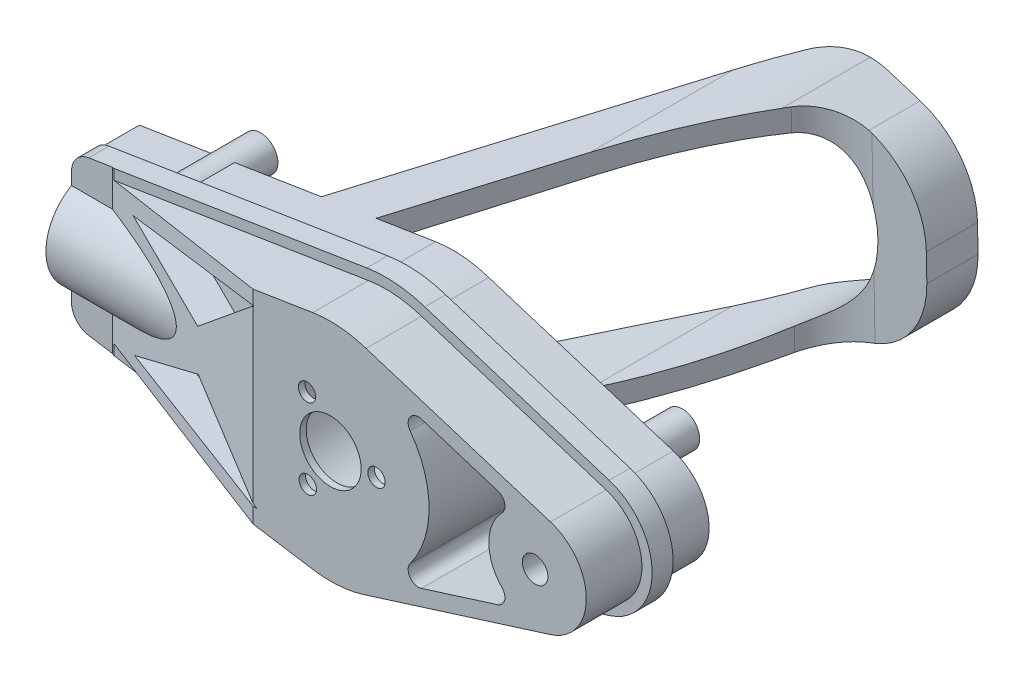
ISO-10303-21;
HEADER;
FILE_DESCRIPTION(('STEP AP214'),'2;1');
FILE_NAME('part.step','',(''),(''),'','','');
FILE_SCHEMA(('AUTOMOTIVE_DESIGN { 1 0 10303 214 1 1 1 1 }'));
ENDSEC;
DATA;
#1=APPLICATION_CONTEXT('core data for automotive mechanical design processes');
#2=APPLICATION_PROTOCOL_DEFINITION('international standard','automotive_design',2000,#1);
#3=PRODUCT_CONTEXT('',#1,'mechanical');
#4=PRODUCT('Part','Part','',(#3));
#5=PRODUCT_RELATED_PRODUCT_CATEGORY('part','',(#4));
#6=PRODUCT_DEFINITION_FORMATION('','',#4);
#7=PRODUCT_DEFINITION_CONTEXT('part definition',#1,'design');
#8=PRODUCT_DEFINITION('design','',#6,#7);
#9=PRODUCT_DEFINITION_SHAPE('','',#8);
#10=(LENGTH_UNIT() NAMED_UNIT(*) SI_UNIT(.MILLI.,.METRE.));
#11=(NAMED_UNIT(*) PLANE_ANGLE_UNIT() SI_UNIT($,.RADIAN.));
#12=(NAMED_UNIT(*) SI_UNIT($,.STERADIAN.) SOLID_ANGLE_UNIT());
#13=UNCERTAINTY_MEASURE_WITH_UNIT(LENGTH_MEASURE(1.E-05),#10,'distance_accuracy_value','');
#14=(GEOMETRIC_REPRESENTATION_CONTEXT(3) GLOBAL_UNCERTAINTY_ASSIGNED_CONTEXT((#13)) GLOBAL_UNIT_ASSIGNED_CONTEXT((#10,
#11,#12)) REPRESENTATION_CONTEXT('',''));
#15=CARTESIAN_POINT('',(0.,0.,0.));
#16=DIRECTION('',(0.,0.,1.));
#17=DIRECTION('',(1.,0.,0.));
#18=AXIS2_PLACEMENT_3D('',#15,#16,#17);
#19=CARTESIAN_POINT('',(-2.68211280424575,0.,9.37709770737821));
#20=DIRECTION('',(-0.275,0.,0.961444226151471));
#21=DIRECTION('',(0.961444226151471,0.,0.275));
#22=AXIS2_PLACEMENT_3D('',#19,#20,#21);
#23=PLANE('',#22);
#24=DIRECTION('',(0.892293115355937,-0.372391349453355,0.255220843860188));
#25=VECTOR('',#24,1.);
#26=CARTESIAN_POINT('',(-20.0010909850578,5.61087909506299,4.42338445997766));
#27=LINE('',#26,#25);
#28=CARTESIAN_POINT('',(-20.0010909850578,5.61087909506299,4.42338445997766));
#29=VERTEX_POINT('',#28);
#30=CARTESIAN_POINT('',(-11.1574758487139,1.92006750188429,6.95290629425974));
#31=VERTEX_POINT('',#30);
#32=EDGE_CURVE('E688',#29,#31,#27,.T.);
#33=ORIENTED_EDGE('',*,*,#32,.T.);
#34=DIRECTION('',(0.737492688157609,0.641566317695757,0.21094358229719));
#35=VECTOR('',#34,1.);
#36=CARTESIAN_POINT('',(-11.1574758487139,1.92006750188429,6.95290629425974));
#37=LINE('',#36,#35);
#38=CARTESIAN_POINT('',(-3.51494586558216,8.56852639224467,9.13888410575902));
#39=VERTEX_POINT('',#38);
#40=EDGE_CURVE('E681',#31,#39,#37,.T.);
#41=ORIENTED_EDGE('',*,*,#40,.T.);
#42=DIRECTION('',(-0.94745363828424,-0.169975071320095,-0.270998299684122));
#43=VECTOR('',#42,1.);
#44=CARTESIAN_POINT('',(-3.51494586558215,8.56852639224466,9.13888410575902));
#45=LINE('',#44,#43);
#46=EDGE_CURVE('E693',#39,#29,#45,.T.);
#47=ORIENTED_EDGE('',*,*,#46,.T.);
#48=EDGE_LOOP('',(#33,#41,#47));
#49=FACE_BOUND('',#48,.T.);
#50=ADVANCED_FACE('F17',(#49),#23,.T.);
#51=CARTESIAN_POINT('',(-2.68211280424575,0.,9.37709770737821));
#52=DIRECTION('',(0.275,0.,-0.961444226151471));
#53=DIRECTION('',(-0.961444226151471,0.,-0.275));
#54=AXIS2_PLACEMENT_3D('',#51,#52,#53);
#55=PLANE('',#54);
#56=DIRECTION('',(-0.952505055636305,0.136047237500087,-0.272443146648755));
#57=VECTOR('',#56,1.);
#58=CARTESIAN_POINT('',(-3.23372365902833,-8.4683293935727,9.21932154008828));
#59=LINE('',#58,#57);
#60=CARTESIAN_POINT('',(-3.23372365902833,-8.46832939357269,9.21932154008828));
#61=VERTEX_POINT('',#60);
#62=CARTESIAN_POINT('',(-19.8077658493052,-6.10104258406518,4.47868086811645));
#63=VERTEX_POINT('',#62);
#64=EDGE_CURVE('E650',#61,#63,#59,.T.);
#65=ORIENTED_EDGE('',*,*,#64,.F.);
#66=DIRECTION('',(0.758232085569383,-0.614856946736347,0.216875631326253));
#67=VECTOR('',#66,1.);
#68=CARTESIAN_POINT('',(-11.0911730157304,-2.09665584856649,6.97187076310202));
#69=LINE('',#68,#67);
#70=CARTESIAN_POINT('',(-11.0911730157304,-2.09665584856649,6.97187076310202));
#71=VERTEX_POINT('',#70);
#72=EDGE_CURVE('E670',#71,#61,#69,.T.);
#73=ORIENTED_EDGE('',*,*,#72,.F.);
#74=DIRECTION('',(0.879476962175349,0.404030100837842,0.251555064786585));
#75=VECTOR('',#74,1.);
#76=CARTESIAN_POINT('',(-19.8077658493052,-6.10104258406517,4.47868086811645));
#77=LINE('',#76,#75);
#78=EDGE_CURVE('E660',#63,#71,#77,.T.);
#79=ORIENTED_EDGE('',*,*,#78,.F.);
#80=EDGE_LOOP('',(#65,#73,#79));
#81=FACE_BOUND('',#80,.T.);
#82=ADVANCED_FACE('F2438',(#81),#55,.F.);
#83=CARTESIAN_POINT('',(-11.65,-0.466718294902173,7.06562989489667));
#84=DIRECTION('',(0.,0.,-1.));
#85=DIRECTION('',(-1.,0.,0.));
#86=AXIS2_PLACEMENT_3D('',#83,#84,#85);
#87=PLANE('',#86);
#88=DIRECTION('',(0.,1.,0.));
#89=VECTOR('',#88,1.);
#90=CARTESIAN_POINT('',(-11.65,-0.466718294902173,7.06562989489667));
#91=LINE('',#90,#89);
#92=CARTESIAN_POINT('',(-11.65,0.533281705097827,7.06562989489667));
#93=VERTEX_POINT('',#92);
#94=CARTESIAN_POINT('',(-11.65,-0.466718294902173,7.06562989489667));
#95=VERTEX_POINT('',#94);
#96=EDGE_CURVE('E730',#93,#95,#91,.F.);
#97=ORIENTED_EDGE('',*,*,#96,.T.);
#98=DIRECTION('',(1.,0.,0.));
#99=VECTOR('',#98,1.);
#100=CARTESIAN_POINT('',(-11.65,-0.466718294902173,7.06562989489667));
#101=LINE('',#100,#99);
#102=CARTESIAN_POINT('',(-27.65,-0.466718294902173,7.06562989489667));
#103=VERTEX_POINT('',#102);
#104=EDGE_CURVE('E1080',#95,#103,#101,.F.);
#105=ORIENTED_EDGE('',*,*,#104,.T.);
#106=DIRECTION('',(0.,1.,0.));
#107=VECTOR('',#106,1.);
#108=CARTESIAN_POINT('',(-27.65,-0.466718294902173,7.06562989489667));
#109=LINE('',#108,#107);
#110=CARTESIAN_POINT('',(-27.65,0.533281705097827,7.06562989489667));
#111=VERTEX_POINT('',#110);
#112=EDGE_CURVE('E732',#103,#111,#109,.T.);
#113=ORIENTED_EDGE('',*,*,#112,.T.);
#114=DIRECTION('',(1.,0.,0.));
#115=VECTOR('',#114,1.);
#116=CARTESIAN_POINT('',(-11.65,0.533281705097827,7.06562989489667));
#117=LINE('',#116,#115);
#118=EDGE_CURVE('E1084',#111,#93,#117,.T.);
#119=ORIENTED_EDGE('',*,*,#118,.T.);
#120=EDGE_LOOP('',(#97,#105,#113,#119));
#121=FACE_BOUND('',#120,.T.);
#122=ADVANCED_FACE('F2429',(#121),#87,.T.);
#123=CARTESIAN_POINT('',(-11.65,-0.466718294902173,4.56562989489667));
#124=DIRECTION('',(1.,0.,0.));
#125=DIRECTION('',(0.,0.,-1.));
#126=AXIS2_PLACEMENT_3D('',#123,#124,#125);
#127=PLANE('',#126);
#128=CARTESIAN_POINT('',(-11.65,0.533281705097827,4.56562989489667));
#129=DIRECTION('',(1.,0.,0.));
#130=DIRECTION('',(0.,0.,-1.));
#131=AXIS2_PLACEMENT_3D('',#128,#129,#130);
#132=CIRCLE('',#131,2.5);
#133=CARTESIAN_POINT('',(-11.65,3.03328170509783,4.56562989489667));
#134=VERTEX_POINT('',#133);
#135=EDGE_CURVE('E1081',#93,#134,#132,.F.);
#136=ORIENTED_EDGE('',*,*,#135,.T.);
#137=DIRECTION('',(0.,0.,-1.));
#138=VECTOR('',#137,1.);
#139=CARTESIAN_POINT('',(-11.65,3.03328170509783,4.56562989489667));
#140=LINE('',#139,#138);
#141=CARTESIAN_POINT('',(-11.65,3.03328170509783,1.06562989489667));
#142=VERTEX_POINT('',#141);
#143=EDGE_CURVE('E724',#142,#134,#140,.F.);
#144=ORIENTED_EDGE('',*,*,#143,.F.);
#145=DIRECTION('',(0.,-1.,0.));
#146=VECTOR('',#145,1.);
#147=CARTESIAN_POINT('',(-11.65,3.03328170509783,1.06562989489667));
#148=LINE('',#147,#146);
#149=CARTESIAN_POINT('',(-11.65,-2.96671829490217,1.06562989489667));
#150=VERTEX_POINT('',#149);
#151=EDGE_CURVE('E733',#150,#142,#148,.F.);
#152=ORIENTED_EDGE('',*,*,#151,.F.);
#153=DIRECTION('',(0.,0.,1.));
#154=VECTOR('',#153,1.);
#155=CARTESIAN_POINT('',(-11.65,-2.96671829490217,1.06562989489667));
#156=LINE('',#155,#154);
#157=CARTESIAN_POINT('',(-11.65,-2.96671829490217,4.56562989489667));
#158=VERTEX_POINT('',#157);
#159=EDGE_CURVE('E738',#158,#150,#156,.F.);
#160=ORIENTED_EDGE('',*,*,#159,.F.);
#161=CARTESIAN_POINT('',(-11.65,-0.466718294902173,4.56562989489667));
#162=DIRECTION('',(1.,0.,0.));
#163=DIRECTION('',(0.,0.,-1.));
#164=AXIS2_PLACEMENT_3D('',#161,#162,#163);
#165=CIRCLE('',#164,2.5);
#166=EDGE_CURVE('E1077',#158,#95,#165,.F.);
#167=ORIENTED_EDGE('',*,*,#166,.T.);
#168=ORIENTED_EDGE('',*,*,#96,.F.);
#169=EDGE_LOOP('',(#136,#144,#152,#160,#167,#168));
#170=FACE_BOUND('',#169,.T.);
#171=ADVANCED_FACE('F2420',(#170),#127,.F.);
#172=CARTESIAN_POINT('',(-25.1214361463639,-7.6523511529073,12.));
#173=DIRECTION('',(-0.15714538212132,-0.987575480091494,0.));
#174=DIRECTION('',(0.987575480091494,-0.15714538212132,0.));
#175=AXIS2_PLACEMENT_3D('',#172,#173,#174);
#176=PLANE('',#175);
#177=DIRECTION('',(-0.987575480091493,0.157145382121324,0.));
#178=VECTOR('',#177,1.);
#179=CARTESIAN_POINT('',(-23.65,-7.88648960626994,6.5));
#180=LINE('',#179,#178);
#181=CARTESIAN_POINT('',(-23.65,-7.88648960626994,6.5));
#182=VERTEX_POINT('',#181);
#183=CARTESIAN_POINT('',(-25.9642907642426,-7.5182341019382,6.5));
#184=VERTEX_POINT('',#183);
#185=EDGE_CURVE('E633',#182,#184,#180,.T.);
#186=ORIENTED_EDGE('',*,*,#185,.T.);
#187=DIRECTION('',(0.,0.,-1.));
#188=VECTOR('',#187,1.);
#189=CARTESIAN_POINT('',(-25.9642907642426,-7.51823410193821,12.));
#190=LINE('',#189,#188);
#191=CARTESIAN_POINT('',(-25.9642907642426,-7.5182341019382,4.52181602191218));
#192=VERTEX_POINT('',#191);
#193=EDGE_CURVE('E720',#192,#184,#190,.F.);
#194=ORIENTED_EDGE('',*,*,#193,.F.);
#195=DIRECTION('',(0.987575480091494,-0.15714538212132,0.));
#196=VECTOR('',#195,1.);
#197=CARTESIAN_POINT('',(-25.9642907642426,-7.5182341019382,4.52181602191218));
#198=LINE('',#197,#196);
#199=CARTESIAN_POINT('',(1.26425541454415,-11.8509057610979,4.52181602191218));
#200=VERTEX_POINT('',#199);
#201=EDGE_CURVE('E1070',#192,#200,#198,.T.);
#202=ORIENTED_EDGE('',*,*,#201,.T.);
#203=DIRECTION('',(0.,0.,1.));
#204=VECTOR('',#203,1.);
#205=CARTESIAN_POINT('',(1.26425541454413,-11.8509057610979,12.));
#206=LINE('',#205,#204);
#207=CARTESIAN_POINT('',(1.26425541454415,-11.8509057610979,6.5661683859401));
#208=VERTEX_POINT('',#207);
#209=EDGE_CURVE('E583',#208,#200,#206,.F.);
#210=ORIENTED_EDGE('',*,*,#209,.F.);
#211=DIRECTION('',(0.987575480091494,-0.157145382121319,0.));
#212=VECTOR('',#211,1.);
#213=CARTESIAN_POINT('',(-23.4186646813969,-7.92330023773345,6.5661683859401));
#214=LINE('',#213,#212);
#215=CARTESIAN_POINT('',(-23.4186646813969,-7.92330023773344,6.56616838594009));
#216=VERTEX_POINT('',#215);
#217=EDGE_CURVE('E565',#216,#208,#214,.T.);
#218=ORIENTED_EDGE('',*,*,#217,.F.);
#219=DIRECTION('',(-0.950386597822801,0.15122779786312,-0.271837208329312));
#220=VECTOR('',#219,1.);
#221=CARTESIAN_POINT('',(-23.4186646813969,-7.92330023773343,6.5661683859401));
#222=LINE('',#221,#220);
#223=EDGE_CURVE('E719',#216,#182,#222,.T.);
#224=ORIENTED_EDGE('',*,*,#223,.T.);
#225=EDGE_LOOP('',(#186,#194,#202,#210,#218,#224));
#226=FACE_BOUND('',#225,.T.);
#227=ADVANCED_FACE('F2412',(#226),#176,.T.);
#228=CARTESIAN_POINT('',(3.15,0.,12.));
#229=DIRECTION('',(0.,0.,1.));
#230=DIRECTION('',(1.,0.,0.));
#231=AXIS2_PLACEMENT_3D('',#228,#229,#230);
#232=CYLINDRICAL_SURFACE('',#231,12.);
#233=CARTESIAN_POINT('',(3.15,0.,6.5661683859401));
#234=DIRECTION('',(0.,0.,1.));
#235=DIRECTION('',(1.,0.,0.));
#236=AXIS2_PLACEMENT_3D('',#233,#234,#235);
#237=CIRCLE('',#236,12.);
#238=CARTESIAN_POINT('',(6.93363179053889,-11.3878940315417,6.5661683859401));
#239=VERTEX_POINT('',#238);
#240=EDGE_CURVE('E20',#208,#239,#237,.T.);
#241=ORIENTED_EDGE('',*,*,#240,.F.);
#242=ORIENTED_EDGE('',*,*,#209,.T.);
#243=CARTESIAN_POINT('',(3.15,0.,4.52181602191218));
#244=DIRECTION('',(0.,0.,1.));
#245=DIRECTION('',(1.,0.,0.));
#246=AXIS2_PLACEMENT_3D('',#243,#244,#245);
#247=CIRCLE('',#246,12.);
#248=CARTESIAN_POINT('',(6.93363179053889,-11.3878940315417,4.52181602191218));
#249=VERTEX_POINT('',#248);
#250=EDGE_CURVE('E578',#200,#249,#247,.T.);
#251=ORIENTED_EDGE('',*,*,#250,.T.);
#252=DIRECTION('',(0.,0.,1.));
#253=VECTOR('',#252,1.);
#254=CARTESIAN_POINT('',(6.93363179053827,-11.3878940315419,12.));
#255=LINE('',#254,#253);
#256=EDGE_CURVE('E575',#239,#249,#255,.F.);
#257=ORIENTED_EDGE('',*,*,#256,.F.);
#258=EDGE_LOOP('',(#241,#242,#251,#257));
#259=FACE_BOUND('',#258,.T.);
#260=ADVANCED_FACE('F576',(#259),#232,.T.);
#261=CARTESIAN_POINT('',(6.93363179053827,-11.3878940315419,12.));
#262=DIRECTION('',(0.299921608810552,-0.953963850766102,0.));
#263=DIRECTION('',(0.953963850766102,0.299921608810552,0.));
#264=AXIS2_PLACEMENT_3D('',#261,#262,#263);
#265=PLANE('',#264);
#266=DIRECTION('',(0.953963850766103,0.29992160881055,0.));
#267=VECTOR('',#266,1.);
#268=CARTESIAN_POINT('',(6.93363179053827,-11.3878940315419,6.5661683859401));
#269=LINE('',#268,#267);
#270=CARTESIAN_POINT('',(24.9495296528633,-5.72378310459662,6.5661683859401));
#271=VERTEX_POINT('',#270);
#272=EDGE_CURVE('E571',#239,#271,#269,.T.);
#273=ORIENTED_EDGE('',*,*,#272,.F.);
#274=ORIENTED_EDGE('',*,*,#256,.T.);
#275=DIRECTION('',(0.953963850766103,0.29992160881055,0.));
#276=VECTOR('',#275,1.);
#277=CARTESIAN_POINT('',(6.93363179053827,-11.3878940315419,4.52181602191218));
#278=LINE('',#277,#276);
#279=CARTESIAN_POINT('',(24.9495296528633,-5.72378310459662,4.52181602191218));
#280=VERTEX_POINT('',#279);
#281=EDGE_CURVE('E1067',#249,#280,#278,.T.);
#282=ORIENTED_EDGE('',*,*,#281,.T.);
#283=DIRECTION('',(0.,0.,1.));
#284=VECTOR('',#283,1.);
#285=CARTESIAN_POINT('',(24.9495296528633,-5.72378310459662,12.));
#286=LINE('',#285,#284);
#287=EDGE_CURVE('E582',#271,#280,#286,.F.);
#288=ORIENTED_EDGE('',*,*,#287,.F.);
#289=EDGE_LOOP('',(#273,#274,#282,#288));
#290=FACE_BOUND('',#289,.T.);
#291=ADVANCED_FACE('F585',(#290),#265,.T.);
#292=CARTESIAN_POINT('',(23.15,0.,12.));
#293=DIRECTION('',(0.,0.,1.));
#294=DIRECTION('',(1.,0.,0.));
#295=AXIS2_PLACEMENT_3D('',#292,#293,#294);
#296=CYLINDRICAL_SURFACE('',#295,6.);
#297=CARTESIAN_POINT('',(23.15,0.,6.5661683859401));
#298=DIRECTION('',(0.,0.,1.));
#299=DIRECTION('',(1.,0.,0.));
#300=AXIS2_PLACEMENT_3D('',#297,#298,#299);
#301=CIRCLE('',#300,6.);
#302=CARTESIAN_POINT('',(24.9495296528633,5.72378310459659,6.5661683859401));
#303=VERTEX_POINT('',#302);
#304=EDGE_CURVE('E587',#271,#303,#301,.T.);
#305=ORIENTED_EDGE('',*,*,#304,.F.);
#306=ORIENTED_EDGE('',*,*,#287,.T.);
#307=CARTESIAN_POINT('',(23.15,0.,4.52181602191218));
#308=DIRECTION('',(0.,0.,1.));
#309=DIRECTION('',(1.,0.,0.));
#310=AXIS2_PLACEMENT_3D('',#307,#308,#309);
#311=CIRCLE('',#310,6.);
#312=CARTESIAN_POINT('',(24.9495296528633,5.72378310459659,4.52181602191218));
#313=VERTEX_POINT('',#312);
#314=EDGE_CURVE('E1064',#280,#313,#311,.T.);
#315=ORIENTED_EDGE('',*,*,#314,.T.);
#316=DIRECTION('',(0.,0.,1.));
#317=VECTOR('',#316,1.);
#318=CARTESIAN_POINT('',(24.9495296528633,5.72378310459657,12.));
#319=LINE('',#318,#317);
#320=EDGE_CURVE('E714',#303,#313,#319,.F.);
#321=ORIENTED_EDGE('',*,*,#320,.F.);
#322=EDGE_LOOP('',(#305,#306,#315,#321));
#323=FACE_BOUND('',#322,.T.);
#324=ADVANCED_FACE('F2389',(#323),#296,.T.);
#325=CARTESIAN_POINT('',(6.93363179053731,11.3878940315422,12.));
#326=DIRECTION('',(0.299921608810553,0.953963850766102,0.));
#327=DIRECTION('',(-0.953963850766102,0.299921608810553,0.));
#328=AXIS2_PLACEMENT_3D('',#325,#326,#327);
#329=PLANE('',#328);
#330=DIRECTION('',(-0.953963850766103,0.299921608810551,0.));
#331=VECTOR('',#330,1.);
#332=CARTESIAN_POINT('',(24.9495296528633,5.72378310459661,6.5661683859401));
#333=LINE('',#332,#331);
#334=CARTESIAN_POINT('',(6.93363179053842,11.3878940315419,6.5661683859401));
#335=VERTEX_POINT('',#334);
#336=EDGE_CURVE('E589',#303,#335,#333,.T.);
#337=ORIENTED_EDGE('',*,*,#336,.F.);
#338=ORIENTED_EDGE('',*,*,#320,.T.);
#339=DIRECTION('',(-0.953963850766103,0.299921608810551,0.));
#340=VECTOR('',#339,1.);
#341=CARTESIAN_POINT('',(24.9495296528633,5.72378310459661,4.52181602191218));
#342=LINE('',#341,#340);
#343=CARTESIAN_POINT('',(6.93363179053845,11.3878940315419,4.52181602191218));
#344=VERTEX_POINT('',#343);
#345=EDGE_CURVE('E1063',#313,#344,#342,.T.);
#346=ORIENTED_EDGE('',*,*,#345,.T.);
#347=DIRECTION('',(0.,0.,1.));
#348=VECTOR('',#347,1.);
#349=CARTESIAN_POINT('',(6.93363179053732,11.3878940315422,12.));
#350=LINE('',#349,#348);
#351=EDGE_CURVE('E712',#335,#344,#350,.F.);
#352=ORIENTED_EDGE('',*,*,#351,.F.);
#353=EDGE_LOOP('',(#337,#338,#346,#352));
#354=FACE_BOUND('',#353,.T.);
#355=ADVANCED_FACE('F1100',(#354),#329,.T.);
#356=CARTESIAN_POINT('',(3.15,0.,12.));
#357=DIRECTION('',(0.,0.,1.));
#358=DIRECTION('',(1.,0.,0.));
#359=AXIS2_PLACEMENT_3D('',#356,#357,#358);
#360=CYLINDRICAL_SURFACE('',#359,12.);
#361=CARTESIAN_POINT('',(3.15,0.,6.5661683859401));
#362=DIRECTION('',(0.,0.,1.));
#363=DIRECTION('',(1.,0.,0.));
#364=AXIS2_PLACEMENT_3D('',#361,#362,#363);
#365=CIRCLE('',#364,12.);
#366=CARTESIAN_POINT('',(1.26425541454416,11.8509057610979,6.5661683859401));
#367=VERTEX_POINT('',#366);
#368=EDGE_CURVE('E1090',#335,#367,#365,.T.);
#369=ORIENTED_EDGE('',*,*,#368,.F.);
#370=ORIENTED_EDGE('',*,*,#351,.T.);
#371=CARTESIAN_POINT('',(3.15,0.,4.52181602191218));
#372=DIRECTION('',(0.,0.,1.));
#373=DIRECTION('',(1.,0.,0.));
#374=AXIS2_PLACEMENT_3D('',#371,#372,#373);
#375=CIRCLE('',#374,12.);
#376=CARTESIAN_POINT('',(1.26425541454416,11.8509057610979,4.52181602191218));
#377=VERTEX_POINT('',#376);
#378=EDGE_CURVE('E1060',#344,#377,#375,.T.);
#379=ORIENTED_EDGE('',*,*,#378,.T.);
#380=DIRECTION('',(0.,0.,1.));
#381=VECTOR('',#380,1.);
#382=CARTESIAN_POINT('',(1.26425541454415,11.8509057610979,12.));
#383=LINE('',#382,#381);
#384=EDGE_CURVE('E703',#367,#377,#383,.F.);
#385=ORIENTED_EDGE('',*,*,#384,.F.);
#386=EDGE_LOOP('',(#369,#370,#379,#385));
#387=FACE_BOUND('',#386,.T.);
#388=ADVANCED_FACE('F1104',(#387),#360,.T.);
#389=CARTESIAN_POINT('',(-25.1214361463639,7.65235115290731,12.));
#390=DIRECTION('',(-0.15714538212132,0.987575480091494,0.));
#391=DIRECTION('',(-0.987575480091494,-0.15714538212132,0.));
#392=AXIS2_PLACEMENT_3D('',#389,#390,#391);
#393=PLANE('',#392);
#394=DIRECTION('',(-0.987575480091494,-0.157145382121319,0.));
#395=VECTOR('',#394,1.);
#396=CARTESIAN_POINT('',(1.26425541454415,11.8509057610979,6.5661683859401));
#397=LINE('',#396,#395);
#398=CARTESIAN_POINT('',(-23.4186646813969,7.92330023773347,6.56616838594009));
#399=VERTEX_POINT('',#398);
#400=EDGE_CURVE('E1089',#367,#399,#397,.T.);
#401=ORIENTED_EDGE('',*,*,#400,.F.);
#402=ORIENTED_EDGE('',*,*,#384,.T.);
#403=DIRECTION('',(-0.987575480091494,-0.15714538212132,0.));
#404=VECTOR('',#403,1.);
#405=CARTESIAN_POINT('',(1.26425541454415,11.8509057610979,4.52181602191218));
#406=LINE('',#405,#404);
#407=CARTESIAN_POINT('',(-25.9642907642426,7.51823410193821,4.52181602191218));
#408=VERTEX_POINT('',#407);
#409=EDGE_CURVE('E1059',#377,#408,#406,.T.);
#410=ORIENTED_EDGE('',*,*,#409,.T.);
#411=DIRECTION('',(0.,0.,-1.));
#412=VECTOR('',#411,1.);
#413=CARTESIAN_POINT('',(-25.9642907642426,7.51823410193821,12.));
#414=LINE('',#413,#412);
#415=CARTESIAN_POINT('',(-25.9642907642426,7.51823410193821,6.5));
#416=VERTEX_POINT('',#415);
#417=EDGE_CURVE('E706',#416,#408,#414,.T.);
#418=ORIENTED_EDGE('',*,*,#417,.F.);
#419=DIRECTION('',(0.987575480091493,0.157145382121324,0.));
#420=VECTOR('',#419,1.);
#421=CARTESIAN_POINT('',(-25.9642907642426,7.51823410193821,6.5));
#422=LINE('',#421,#420);
#423=CARTESIAN_POINT('',(-23.65,7.88648960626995,6.5));
#424=VERTEX_POINT('',#423);
#425=EDGE_CURVE('E630',#416,#424,#422,.T.);
#426=ORIENTED_EDGE('',*,*,#425,.T.);
#427=DIRECTION('',(0.950386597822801,0.15122779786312,0.271837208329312));
#428=VECTOR('',#427,1.);
#429=CARTESIAN_POINT('',(-23.65,7.88648960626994,6.5));
#430=LINE('',#429,#428);
#431=EDGE_CURVE('E711',#424,#399,#430,.T.);
#432=ORIENTED_EDGE('',*,*,#431,.T.);
#433=EDGE_LOOP('',(#401,#402,#410,#418,#426,#432));
#434=FACE_BOUND('',#433,.T.);
#435=ADVANCED_FACE('F1109',(#434),#393,.T.);
#436=CARTESIAN_POINT('',(-3.51494586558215,8.56852639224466,9.13888410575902));
#437=DIRECTION('',(-0.16342155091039,0.98544836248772,-0.0467431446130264));
#438=DIRECTION('',(-0.986526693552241,-0.163600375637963,0.));
#439=AXIS2_PLACEMENT_3D('',#436,#437,#438);
#440=PLANE('',#439);
#441=DIRECTION('',(0.275,0.,-0.961444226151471));
#442=VECTOR('',#441,1.);
#443=CARTESIAN_POINT('',(-20.8260909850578,5.61087909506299,7.30771713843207));
#444=LINE('',#443,#442);
#445=CARTESIAN_POINT('',(-20.8260909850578,5.610879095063,7.30771713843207));
#446=VERTEX_POINT('',#445);
#447=EDGE_CURVE('E690',#446,#29,#444,.T.);
#448=ORIENTED_EDGE('',*,*,#447,.T.);
#449=ORIENTED_EDGE('',*,*,#46,.F.);
#450=DIRECTION('',(-0.275000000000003,0.,0.96144422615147));
#451=VECTOR('',#450,1.);
#452=CARTESIAN_POINT('',(-3.51494586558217,8.56852639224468,9.13888410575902));
#453=LINE('',#452,#451);
#454=CARTESIAN_POINT('',(-4.33330521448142,8.56852639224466,12.));
#455=VERTEX_POINT('',#454);
#456=EDGE_CURVE('E671',#39,#455,#453,.T.);
#457=ORIENTED_EDGE('',*,*,#456,.T.);
#458=DIRECTION('',(-0.986526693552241,-0.163600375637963,0.));
#459=VECTOR('',#458,1.);
#460=CARTESIAN_POINT('',(-3.5368493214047,8.70060643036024,12.));
#461=LINE('',#460,#459);
#462=CARTESIAN_POINT('',(-4.42111547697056,8.55396440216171,12.));
#463=VERTEX_POINT('',#462);
#464=EDGE_CURVE('E695',#463,#455,#461,.F.);
#465=ORIENTED_EDGE('',*,*,#464,.F.);
#466=DIRECTION('',(-0.94745363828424,-0.169975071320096,-0.270998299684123));
#467=VECTOR('',#466,1.);
#468=CARTESIAN_POINT('',(-4.42111547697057,8.5539644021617,12.));
#469=LINE('',#468,#467);
#470=EDGE_CURVE('E620',#463,#446,#469,.T.);
#471=ORIENTED_EDGE('',*,*,#470,.T.);
#472=EDGE_LOOP('',(#448,#449,#457,#465,#471));
#473=FACE_BOUND('',#472,.T.);
#474=ADVANCED_FACE('F2358',(#473),#440,.F.);
#475=CARTESIAN_POINT('',(-20.0010909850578,5.61087909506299,4.42338445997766));
#476=DIRECTION('',(-0.358033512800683,-0.928075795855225,-0.102407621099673));
#477=DIRECTION('',(0.932980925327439,-0.359925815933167,0.));
#478=AXIS2_PLACEMENT_3D('',#475,#476,#477);
#479=PLANE('',#478);
#480=DIRECTION('',(0.275,0.,-0.961444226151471));
#481=VECTOR('',#480,1.);
#482=CARTESIAN_POINT('',(-11.9824758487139,1.92006750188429,9.83723897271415));
#483=LINE('',#482,#481);
#484=CARTESIAN_POINT('',(-11.9824758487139,1.92006750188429,9.83723897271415));
#485=VERTEX_POINT('',#484);
#486=EDGE_CURVE('E684',#485,#31,#483,.T.);
#487=ORIENTED_EDGE('',*,*,#486,.T.);
#488=ORIENTED_EDGE('',*,*,#32,.F.);
#489=ORIENTED_EDGE('',*,*,#447,.F.);
#490=DIRECTION('',(0.892293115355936,-0.372391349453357,0.255220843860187));
#491=VECTOR('',#490,1.);
#492=CARTESIAN_POINT('',(-20.8260909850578,5.61087909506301,7.30771713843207));
#493=LINE('',#492,#491);
#494=EDGE_CURVE('E698',#446,#485,#493,.T.);
#495=ORIENTED_EDGE('',*,*,#494,.T.);
#496=EDGE_LOOP('',(#487,#488,#489,#495));
#497=FACE_BOUND('',#496,.T.);
#498=ADVANCED_FACE('F2349',(#497),#479,.F.);
#499=CARTESIAN_POINT('',(-11.1574758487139,1.92006750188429,6.95290629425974));
#500=DIRECTION('',(0.616830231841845,-0.767067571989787,0.176430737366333));
#501=DIRECTION('',(0.779292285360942,0.626660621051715,0.));
#502=AXIS2_PLACEMENT_3D('',#499,#500,#501);
#503=PLANE('',#502);
#504=ORIENTED_EDGE('',*,*,#40,.F.);
#505=ORIENTED_EDGE('',*,*,#486,.F.);
#506=DIRECTION('',(0.73749268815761,0.641566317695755,0.210943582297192));
#507=VECTOR('',#506,1.);
#508=CARTESIAN_POINT('',(-11.9824758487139,1.9200675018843,9.83723897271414));
#509=LINE('',#508,#507);
#510=CARTESIAN_POINT('',(-4.42111547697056,8.4979145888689,12.));
#511=VERTEX_POINT('',#510);
#512=EDGE_CURVE('E665',#485,#511,#509,.T.);
#513=ORIENTED_EDGE('',*,*,#512,.T.);
#514=DIRECTION('',(0.779292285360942,0.626660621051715,0.));
#515=VECTOR('',#514,1.);
#516=CARTESIAN_POINT('',(-11.7243867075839,2.62505716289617,12.));
#517=LINE('',#516,#515);
#518=EDGE_CURVE('E687',#455,#511,#517,.F.);
#519=ORIENTED_EDGE('',*,*,#518,.F.);
#520=ORIENTED_EDGE('',*,*,#456,.F.);
#521=EDGE_LOOP('',(#504,#505,#513,#519,#520));
#522=FACE_BOUND('',#521,.T.);
#523=ADVANCED_FACE('F2340',(#522),#503,.F.);
#524=CARTESIAN_POINT('',(-11.0911730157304,-2.09665584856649,6.97187076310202));
#525=DIRECTION('',(-0.591150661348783,-0.788638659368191,-0.169085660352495));
#526=DIRECTION('',(0.800159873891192,-0.599786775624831,0.));
#527=AXIS2_PLACEMENT_3D('',#524,#525,#526);
#528=PLANE('',#527);
#529=ORIENTED_EDGE('',*,*,#72,.T.);
#530=DIRECTION('',(0.275000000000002,0.,-0.96144422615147));
#531=VECTOR('',#530,1.);
#532=CARTESIAN_POINT('',(-4.02907564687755,-8.4683293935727,12.));
#533=LINE('',#532,#531);
#534=CARTESIAN_POINT('',(-4.02907564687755,-8.46832939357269,12.));
#535=VERTEX_POINT('',#534);
#536=EDGE_CURVE('E645',#535,#61,#533,.T.);
#537=ORIENTED_EDGE('',*,*,#536,.F.);
#538=DIRECTION('',(0.800159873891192,-0.599786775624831,0.));
#539=VECTOR('',#538,1.);
#540=CARTESIAN_POINT('',(-11.6085520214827,-2.78687766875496,12.));
#541=LINE('',#540,#539);
#542=CARTESIAN_POINT('',(-4.42111547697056,-8.17446273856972,12.));
#543=VERTEX_POINT('',#542);
#544=EDGE_CURVE('E668',#535,#543,#541,.F.);
#545=ORIENTED_EDGE('',*,*,#544,.T.);
#546=DIRECTION('',(-0.758232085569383,0.614856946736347,-0.216875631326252));
#547=VECTOR('',#546,1.);
#548=CARTESIAN_POINT('',(-4.42111547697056,-8.17446273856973,12.));
#549=LINE('',#548,#547);
#550=CARTESIAN_POINT('',(-11.9161730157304,-2.09665584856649,9.85620344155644));
#551=VERTEX_POINT('',#550);
#552=EDGE_CURVE('E656',#543,#551,#549,.T.);
#553=ORIENTED_EDGE('',*,*,#552,.T.);
#554=DIRECTION('',(-0.274999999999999,0.,0.961444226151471));
#555=VECTOR('',#554,1.);
#556=CARTESIAN_POINT('',(-11.0911730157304,-2.09665584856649,6.97187076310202));
#557=LINE('',#556,#555);
#558=EDGE_CURVE('E646',#71,#551,#557,.T.);
#559=ORIENTED_EDGE('',*,*,#558,.F.);
#560=EDGE_LOOP('',(#529,#537,#545,#553,#559));
#561=FACE_BOUND('',#560,.T.);
#562=ADVANCED_FACE('F2331',(#561),#528,.T.);
#563=CARTESIAN_POINT('',(-19.8077658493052,-6.10104258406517,4.47868086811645));
#564=DIRECTION('',(0.38845240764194,-0.914745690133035,0.111108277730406));
#565=DIRECTION('',(0.920444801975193,0.39087257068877,0.));
#566=AXIS2_PLACEMENT_3D('',#563,#564,#565);
#567=PLANE('',#566);
#568=ORIENTED_EDGE('',*,*,#78,.T.);
#569=ORIENTED_EDGE('',*,*,#558,.T.);
#570=DIRECTION('',(-0.879476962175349,-0.404030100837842,-0.251555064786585));
#571=VECTOR('',#570,1.);
#572=CARTESIAN_POINT('',(-11.9161730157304,-2.09665584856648,9.85620344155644));
#573=LINE('',#572,#571);
#574=CARTESIAN_POINT('',(-20.6327658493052,-6.10104258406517,7.36301354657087));
#575=VERTEX_POINT('',#574);
#576=EDGE_CURVE('E653',#551,#575,#573,.T.);
#577=ORIENTED_EDGE('',*,*,#576,.T.);
#578=DIRECTION('',(-0.275,0.,0.961444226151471));
#579=VECTOR('',#578,1.);
#580=CARTESIAN_POINT('',(-19.8077658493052,-6.10104258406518,4.47868086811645));
#581=LINE('',#580,#579);
#582=EDGE_CURVE('E642',#63,#575,#581,.T.);
#583=ORIENTED_EDGE('',*,*,#582,.F.);
#584=EDGE_LOOP('',(#568,#569,#577,#583));
#585=FACE_BOUND('',#584,.T.);
#586=ADVANCED_FACE('F2322',(#585),#567,.T.);
#587=CARTESIAN_POINT('',(-3.23372365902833,-8.4683293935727,9.21932154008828));
#588=DIRECTION('',(0.130801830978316,0.990702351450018,0.0374129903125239));
#589=DIRECTION('',(-0.991396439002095,0.130893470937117,0.));
#590=AXIS2_PLACEMENT_3D('',#587,#588,#589);
#591=PLANE('',#590);
#592=ORIENTED_EDGE('',*,*,#582,.T.);
#593=DIRECTION('',(0.952505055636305,-0.136047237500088,0.272443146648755));
#594=VECTOR('',#593,1.);
#595=CARTESIAN_POINT('',(-20.6327658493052,-6.10104258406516,7.36301354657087));
#596=LINE('',#595,#594);
#597=CARTESIAN_POINT('',(-4.42111547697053,-8.41656861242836,12.));
#598=VERTEX_POINT('',#597);
#599=EDGE_CURVE('E600',#575,#598,#596,.T.);
#600=ORIENTED_EDGE('',*,*,#599,.T.);
#601=DIRECTION('',(-0.991396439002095,0.130893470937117,0.));
#602=VECTOR('',#601,1.);
#603=CARTESIAN_POINT('',(-3.24735050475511,-8.57154009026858,12.));
#604=LINE('',#603,#602);
#605=EDGE_CURVE('E643',#598,#535,#604,.F.);
#606=ORIENTED_EDGE('',*,*,#605,.T.);
#607=ORIENTED_EDGE('',*,*,#536,.T.);
#608=ORIENTED_EDGE('',*,*,#64,.T.);
#609=EDGE_LOOP('',(#592,#600,#606,#607,#608));
#610=FACE_BOUND('',#609,.T.);
#611=ADVANCED_FACE('F2313',(#610),#591,.T.);
#612=CARTESIAN_POINT('',(-27.65,-18.1768437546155,6.5));
#613=DIRECTION('',(0.,0.,-1.));
#614=DIRECTION('',(-1.,0.,0.));
#615=AXIS2_PLACEMENT_3D('',#612,#613,#614);
#616=PLANE('',#615);
#617=ORIENTED_EDGE('',*,*,#185,.F.);
#618=DIRECTION('',(0.,1.,0.));
#619=VECTOR('',#618,1.);
#620=CARTESIAN_POINT('',(-23.65,-18.1768437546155,6.5));
#621=LINE('',#620,#619);
#622=CARTESIAN_POINT('',(-23.65,-4.33012701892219,6.5));
#623=VERTEX_POINT('',#622);
#624=EDGE_CURVE('E599',#182,#623,#621,.T.);
#625=ORIENTED_EDGE('',*,*,#624,.T.);
#626=DIRECTION('',(1.,0.,0.));
#627=VECTOR('',#626,1.);
#628=CARTESIAN_POINT('',(-9.5940801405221,-4.33012701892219,6.5));
#629=LINE('',#628,#627);
#630=CARTESIAN_POINT('',(-27.65,-4.33012701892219,6.5));
#631=VERTEX_POINT('',#630);
#632=EDGE_CURVE('E1236',#631,#623,#629,.T.);
#633=ORIENTED_EDGE('',*,*,#632,.F.);
#634=DIRECTION('',(0.,1.,0.));
#635=VECTOR('',#634,1.);
#636=CARTESIAN_POINT('',(-27.65,-18.1768437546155,6.5));
#637=LINE('',#636,#635);
#638=CARTESIAN_POINT('',(-27.65,-5.54308314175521,6.5));
#639=VERTEX_POINT('',#638);
#640=EDGE_CURVE('E638',#639,#631,#637,.T.);
#641=ORIENTED_EDGE('',*,*,#640,.F.);
#642=CARTESIAN_POINT('',(-25.65,-5.54308314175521,6.5));
#643=DIRECTION('',(0.,0.,-1.));
#644=DIRECTION('',(-1.,0.,0.));
#645=AXIS2_PLACEMENT_3D('',#642,#643,#644);
#646=CIRCLE('',#645,2.);
#647=EDGE_CURVE('E722',#184,#639,#646,.T.);
#648=ORIENTED_EDGE('',*,*,#647,.F.);
#649=EDGE_LOOP('',(#617,#625,#633,#641,#648));
#650=FACE_BOUND('',#649,.T.);
#651=ADVANCED_FACE('F2304',(#650),#616,.F.);
#652=CARTESIAN_POINT('',(-27.65,-18.1768437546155,6.5));
#653=DIRECTION('',(0.,0.,-1.));
#654=DIRECTION('',(-1.,0.,0.));
#655=AXIS2_PLACEMENT_3D('',#652,#653,#654);
#656=PLANE('',#655);
#657=DIRECTION('',(0.,1.,0.));
#658=VECTOR('',#657,1.);
#659=CARTESIAN_POINT('',(-27.65,-18.1768437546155,6.5));
#660=LINE('',#659,#658);
#661=CARTESIAN_POINT('',(-27.65,4.3301270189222,6.5));
#662=VERTEX_POINT('',#661);
#663=CARTESIAN_POINT('',(-27.65,5.54308314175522,6.5));
#664=VERTEX_POINT('',#663);
#665=EDGE_CURVE('E594',#662,#664,#660,.T.);
#666=ORIENTED_EDGE('',*,*,#665,.F.);
#667=DIRECTION('',(1.,0.,0.));
#668=VECTOR('',#667,1.);
#669=CARTESIAN_POINT('',(-9.5940801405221,4.33012701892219,6.5));
#670=LINE('',#669,#668);
#671=CARTESIAN_POINT('',(-23.65,4.3301270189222,6.5));
#672=VERTEX_POINT('',#671);
#673=EDGE_CURVE('E1087',#672,#662,#670,.F.);
#674=ORIENTED_EDGE('',*,*,#673,.F.);
#675=DIRECTION('',(0.,1.,0.));
#676=VECTOR('',#675,1.);
#677=CARTESIAN_POINT('',(-23.65,-18.1768437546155,6.5));
#678=LINE('',#677,#676);
#679=EDGE_CURVE('E626',#672,#424,#678,.T.);
#680=ORIENTED_EDGE('',*,*,#679,.T.);
#681=ORIENTED_EDGE('',*,*,#425,.F.);
#682=CARTESIAN_POINT('',(-25.65,5.54308314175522,6.5));
#683=DIRECTION('',(0.,0.,-1.));
#684=DIRECTION('',(-1.,0.,0.));
#685=AXIS2_PLACEMENT_3D('',#682,#683,#684);
#686=CIRCLE('',#685,2.);
#687=EDGE_CURVE('E709',#664,#416,#686,.T.);
#688=ORIENTED_EDGE('',*,*,#687,.F.);
#689=EDGE_LOOP('',(#666,#674,#680,#681,#688));
#690=FACE_BOUND('',#689,.T.);
#691=ADVANCED_FACE('F2296',(#690),#656,.F.);
#692=CARTESIAN_POINT('',(-25.65,-5.54308314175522,6.5661683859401));
#693=DIRECTION('',(0.,0.,1.));
#694=DIRECTION('',(1.,0.,0.));
#695=AXIS2_PLACEMENT_3D('',#692,#693,#694);
#696=PLANE('',#695);
#697=ORIENTED_EDGE('',*,*,#368,.T.);
#698=ORIENTED_EDGE('',*,*,#400,.T.);
#699=DIRECTION('',(0.,1.,0.));
#700=VECTOR('',#699,1.);
#701=CARTESIAN_POINT('',(-23.4186646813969,-18.1768437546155,6.56616838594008));
#702=LINE('',#701,#700);
#703=CARTESIAN_POINT('',(-23.418664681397,6.91071940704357,6.56616838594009));
#704=VERTEX_POINT('',#703);
#705=EDGE_CURVE('E614',#399,#704,#702,.F.);
#706=ORIENTED_EDGE('',*,*,#705,.T.);
#707=DIRECTION('',(-0.987575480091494,-0.15714538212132,0.));
#708=VECTOR('',#707,1.);
#709=CARTESIAN_POINT('',(-4.42111547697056,9.93365506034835,6.5661683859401));
#710=LINE('',#709,#708);
#711=CARTESIAN_POINT('',(1.42140079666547,10.8633302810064,6.5661683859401));
#712=VERTEX_POINT('',#711);
#713=EDGE_CURVE('E611',#712,#704,#710,.T.);
#714=ORIENTED_EDGE('',*,*,#713,.F.);
#715=CARTESIAN_POINT('',(3.15,0.,6.5661683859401));
#716=DIRECTION('',(0.,0.,1.));
#717=DIRECTION('',(1.,0.,0.));
#718=AXIS2_PLACEMENT_3D('',#715,#716,#717);
#719=CIRCLE('',#718,11.);
#720=CARTESIAN_POINT('',(6.62583185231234,10.4364070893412,6.5661683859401));
#721=VERTEX_POINT('',#720);
#722=EDGE_CURVE('E1050',#721,#712,#719,.T.);
#723=ORIENTED_EDGE('',*,*,#722,.F.);
#724=DIRECTION('',(-0.953963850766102,0.299921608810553,0.));
#725=VECTOR('',#724,1.);
#726=CARTESIAN_POINT('',(6.62583185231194,10.4364070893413,6.5661683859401));
#727=LINE('',#726,#725);
#728=CARTESIAN_POINT('',(24.6496080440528,4.76981925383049,6.5661683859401));
#729=VERTEX_POINT('',#728);
#730=EDGE_CURVE('E607',#729,#721,#727,.T.);
#731=ORIENTED_EDGE('',*,*,#730,.F.);
#732=CARTESIAN_POINT('',(23.15,0.,6.5661683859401));
#733=DIRECTION('',(0.,0.,1.));
#734=DIRECTION('',(1.,0.,0.));
#735=AXIS2_PLACEMENT_3D('',#732,#733,#734);
#736=CIRCLE('',#735,5.);
#737=CARTESIAN_POINT('',(24.6496080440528,-4.76981925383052,6.5661683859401));
#738=VERTEX_POINT('',#737);
#739=EDGE_CURVE('E1048',#738,#729,#736,.T.);
#740=ORIENTED_EDGE('',*,*,#739,.F.);
#741=DIRECTION('',(0.953963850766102,0.299921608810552,0.));
#742=VECTOR('',#741,1.);
#743=CARTESIAN_POINT('',(24.6496080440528,-4.76981925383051,6.5661683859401));
#744=LINE('',#743,#742);
#745=CARTESIAN_POINT('',(6.62583185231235,-10.4364070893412,6.5661683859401));
#746=VERTEX_POINT('',#745);
#747=EDGE_CURVE('E603',#746,#738,#744,.T.);
#748=ORIENTED_EDGE('',*,*,#747,.F.);
#749=CARTESIAN_POINT('',(3.15,0.,6.5661683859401));
#750=DIRECTION('',(0.,0.,1.));
#751=DIRECTION('',(1.,0.,0.));
#752=AXIS2_PLACEMENT_3D('',#749,#750,#751);
#753=CIRCLE('',#752,11.);
#754=CARTESIAN_POINT('',(1.42140079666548,-10.8633302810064,6.5661683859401));
#755=VERTEX_POINT('',#754);
#756=EDGE_CURVE('E1045',#755,#746,#753,.T.);
#757=ORIENTED_EDGE('',*,*,#756,.F.);
#758=DIRECTION('',(0.987575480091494,-0.157145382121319,0.));
#759=VECTOR('',#758,1.);
#760=CARTESIAN_POINT('',(-25.8071453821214,-6.53065862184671,6.5661683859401));
#761=LINE('',#760,#759);
#762=CARTESIAN_POINT('',(-23.4186646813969,-6.91071940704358,6.5661683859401));
#763=VERTEX_POINT('',#762);
#764=EDGE_CURVE('E1244',#763,#755,#761,.T.);
#765=ORIENTED_EDGE('',*,*,#764,.F.);
#766=DIRECTION('',(0.,1.,0.));
#767=VECTOR('',#766,1.);
#768=CARTESIAN_POINT('',(-23.4186646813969,-18.1768437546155,6.56616838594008));
#769=LINE('',#768,#767);
#770=EDGE_CURVE('E597',#763,#216,#769,.F.);
#771=ORIENTED_EDGE('',*,*,#770,.T.);
#772=ORIENTED_EDGE('',*,*,#217,.T.);
#773=ORIENTED_EDGE('',*,*,#240,.T.);
#774=ORIENTED_EDGE('',*,*,#272,.T.);
#775=ORIENTED_EDGE('',*,*,#304,.T.);
#776=ORIENTED_EDGE('',*,*,#336,.T.);
#777=EDGE_LOOP('',(#697,#698,#706,#714,#723,#731,#740,#748,#757,#765,#771,#772,#773,#774,#775,#776));
#778=FACE_BOUND('',#777,.T.);
#779=ADVANCED_FACE('F569',(#778),#696,.T.);
#780=CARTESIAN_POINT('',(-18.0725479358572,-6.32926752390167,-3.4980851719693));
#781=DIRECTION('',(0.,0.,-1.));
#782=DIRECTION('',(-1.,0.,0.));
#783=AXIS2_PLACEMENT_3D('',#780,#781,#782);
#784=PLANE('',#783);
#785=CARTESIAN_POINT('',(-19.1748486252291,-6.32926752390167,-3.4980851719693));
#786=DIRECTION('',(0.,0.,-1.));
#787=DIRECTION('',(-1.,0.,0.));
#788=AXIS2_PLACEMENT_3D('',#785,#786,#787);
#789=CIRCLE('',#788,1.7);
#790=CARTESIAN_POINT('',(-20.8748486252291,-6.32926752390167,-3.4980851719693));
#791=VERTEX_POINT('',#790);
#792=EDGE_CURVE('E1040',#791,#791,#789,.F.);
#793=ORIENTED_EDGE('',*,*,#792,.F.);
#794=EDGE_LOOP('',(#793));
#795=FACE_BOUND('',#794,.T.);
#796=ADVANCED_FACE('F2279',(#795),#784,.T.);
#797=CARTESIAN_POINT('',(-25.65,-5.54308314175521,12.));
#798=DIRECTION('',(0.,0.,-1.));
#799=DIRECTION('',(-1.,0.,0.));
#800=AXIS2_PLACEMENT_3D('',#797,#798,#799);
#801=CYLINDRICAL_SURFACE('',#800,2.);
#802=ORIENTED_EDGE('',*,*,#193,.T.);
#803=ORIENTED_EDGE('',*,*,#647,.T.);
#804=DIRECTION('',(0.,0.,1.));
#805=VECTOR('',#804,1.);
#806=CARTESIAN_POINT('',(-27.65,-5.54308314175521,12.));
#807=LINE('',#806,#805);
#808=CARTESIAN_POINT('',(-27.65,-5.54308314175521,0.));
#809=VERTEX_POINT('',#808);
#810=EDGE_CURVE('E1036',#809,#639,#807,.T.);
#811=ORIENTED_EDGE('',*,*,#810,.F.);
#812=CARTESIAN_POINT('',(-25.65,-5.54308314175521,0.));
#813=DIRECTION('',(0.,0.,-1.));
#814=DIRECTION('',(-1.,0.,0.));
#815=AXIS2_PLACEMENT_3D('',#812,#813,#814);
#816=CIRCLE('',#815,2.);
#817=CARTESIAN_POINT('',(-27.517676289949,-6.25847483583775,0.));
#818=VERTEX_POINT('',#817);
#819=EDGE_CURVE('E723',#809,#818,#816,.F.);
#820=ORIENTED_EDGE('',*,*,#819,.T.);
#821=DIRECTION('',(0.,0.,1.));
#822=VECTOR('',#821,1.);
#823=CARTESIAN_POINT('',(-27.517676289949,-6.25847483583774,4.98221360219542));
#824=LINE('',#823,#822);
#825=CARTESIAN_POINT('',(-27.517676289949,-6.25847483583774,4.52181602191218));
#826=VERTEX_POINT('',#825);
#827=EDGE_CURVE('E1243',#826,#818,#824,.F.);
#828=ORIENTED_EDGE('',*,*,#827,.F.);
#829=CARTESIAN_POINT('',(-25.65,-5.54308314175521,4.52181602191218));
#830=DIRECTION('',(0.,0.,-1.));
#831=DIRECTION('',(-1.,0.,0.));
#832=AXIS2_PLACEMENT_3D('',#829,#830,#831);
#833=CIRCLE('',#832,2.);
#834=EDGE_CURVE('E708',#826,#192,#833,.F.);
#835=ORIENTED_EDGE('',*,*,#834,.T.);
#836=EDGE_LOOP('',(#802,#803,#811,#820,#828,#835));
#837=FACE_BOUND('',#836,.T.);
#838=ADVANCED_FACE('F2270',(#837),#801,.T.);
#839=CARTESIAN_POINT('',(-9.5940801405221,0.,4.));
#840=DIRECTION('',(1.,0.,0.));
#841=DIRECTION('',(0.,0.,-1.));
#842=AXIS2_PLACEMENT_3D('',#839,#840,#841);
#843=CYLINDRICAL_SURFACE('',#842,5.);
#844=ORIENTED_EDGE('',*,*,#632,.T.);
#845=CARTESIAN_POINT('',(-32.3904020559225,0.,4.));
#846=DIRECTION('',(0.275,0.,-0.961444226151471));
#847=DIRECTION('',(0.961444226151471,0.,0.275));
#848=AXIS2_PLACEMENT_3D('',#845,#846,#847);
#849=ELLIPSE('',#848,18.1818181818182,5.);
#850=EDGE_CURVE('E1052',#623,#672,#849,.F.);
#851=ORIENTED_EDGE('',*,*,#850,.T.);
#852=ORIENTED_EDGE('',*,*,#673,.T.);
#853=CARTESIAN_POINT('',(-27.65,0.,4.));
#854=DIRECTION('',(1.,0.,0.));
#855=DIRECTION('',(0.,0.,-1.));
#856=AXIS2_PLACEMENT_3D('',#853,#854,#855);
#857=CIRCLE('',#856,5.);
#858=EDGE_CURVE('E1033',#631,#662,#857,.F.);
#859=ORIENTED_EDGE('',*,*,#858,.F.);
#860=EDGE_LOOP('',(#844,#851,#852,#859));
#861=FACE_BOUND('',#860,.T.);
#862=ADVANCED_FACE('F2261',(#861),#843,.T.);
#863=CARTESIAN_POINT('',(-11.65,0.533281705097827,4.56562989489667));
#864=DIRECTION('',(1.,0.,0.));
#865=DIRECTION('',(0.,0.,-1.));
#866=AXIS2_PLACEMENT_3D('',#863,#864,#865);
#867=CYLINDRICAL_SURFACE('',#866,2.5);
#868=DIRECTION('',(1.,0.,0.));
#869=VECTOR('',#868,1.);
#870=CARTESIAN_POINT('',(-11.65,3.03328170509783,4.56562989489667));
#871=LINE('',#870,#869);
#872=CARTESIAN_POINT('',(-27.65,3.03328170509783,4.56562989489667));
#873=VERTEX_POINT('',#872);
#874=EDGE_CURVE('E726',#134,#873,#871,.F.);
#875=ORIENTED_EDGE('',*,*,#874,.F.);
#876=ORIENTED_EDGE('',*,*,#135,.F.);
#877=ORIENTED_EDGE('',*,*,#118,.F.);
#878=CARTESIAN_POINT('',(-27.65,0.533281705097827,4.56562989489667));
#879=DIRECTION('',(1.,0.,0.));
#880=DIRECTION('',(0.,0.,-1.));
#881=AXIS2_PLACEMENT_3D('',#878,#879,#880);
#882=CIRCLE('',#881,2.5);
#883=EDGE_CURVE('E1030',#873,#111,#882,.T.);
#884=ORIENTED_EDGE('',*,*,#883,.F.);
#885=EDGE_LOOP('',(#875,#876,#877,#884));
#886=FACE_BOUND('',#885,.T.);
#887=ADVANCED_FACE('F2252',(#886),#867,.F.);
#888=CARTESIAN_POINT('',(-11.65,-0.466718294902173,4.56562989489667));
#889=DIRECTION('',(1.,0.,0.));
#890=DIRECTION('',(0.,0.,-1.));
#891=AXIS2_PLACEMENT_3D('',#888,#889,#890);
#892=CYLINDRICAL_SURFACE('',#891,2.5);
#893=ORIENTED_EDGE('',*,*,#104,.F.);
#894=ORIENTED_EDGE('',*,*,#166,.F.);
#895=DIRECTION('',(1.,0.,0.));
#896=VECTOR('',#895,1.);
#897=CARTESIAN_POINT('',(-11.65,-2.96671829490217,4.56562989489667));
#898=LINE('',#897,#896);
#899=CARTESIAN_POINT('',(-27.65,-2.96671829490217,4.56562989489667));
#900=VERTEX_POINT('',#899);
#901=EDGE_CURVE('E740',#900,#158,#898,.T.);
#902=ORIENTED_EDGE('',*,*,#901,.F.);
#903=CARTESIAN_POINT('',(-27.65,-0.466718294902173,4.56562989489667));
#904=DIRECTION('',(1.,0.,0.));
#905=DIRECTION('',(0.,0.,-1.));
#906=AXIS2_PLACEMENT_3D('',#903,#904,#905);
#907=CIRCLE('',#906,2.5);
#908=EDGE_CURVE('E1027',#103,#900,#907,.T.);
#909=ORIENTED_EDGE('',*,*,#908,.F.);
#910=EDGE_LOOP('',(#893,#894,#902,#909));
#911=FACE_BOUND('',#910,.T.);
#912=ADVANCED_FACE('F2243',(#911),#892,.F.);
#913=CARTESIAN_POINT('',(-11.65,-2.96671829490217,1.06562989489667));
#914=DIRECTION('',(0.,1.,0.));
#915=DIRECTION('',(0.,0.,1.));
#916=AXIS2_PLACEMENT_3D('',#913,#914,#915);
#917=PLANE('',#916);
#918=ORIENTED_EDGE('',*,*,#159,.T.);
#919=DIRECTION('',(1.,0.,0.));
#920=VECTOR('',#919,1.);
#921=CARTESIAN_POINT('',(-11.65,-2.96671829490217,1.06562989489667));
#922=LINE('',#921,#920);
#923=CARTESIAN_POINT('',(-27.65,-2.96671829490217,1.06562989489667));
#924=VERTEX_POINT('',#923);
#925=EDGE_CURVE('E735',#924,#150,#922,.T.);
#926=ORIENTED_EDGE('',*,*,#925,.F.);
#927=DIRECTION('',(0.,0.,1.));
#928=VECTOR('',#927,1.);
#929=CARTESIAN_POINT('',(-27.65,-2.96671829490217,12.));
#930=LINE('',#929,#928);
#931=EDGE_CURVE('E1029',#900,#924,#930,.F.);
#932=ORIENTED_EDGE('',*,*,#931,.F.);
#933=ORIENTED_EDGE('',*,*,#901,.T.);
#934=EDGE_LOOP('',(#918,#926,#932,#933));
#935=FACE_BOUND('',#934,.T.);
#936=ADVANCED_FACE('F2234',(#935),#917,.T.);
#937=CARTESIAN_POINT('',(-11.65,3.03328170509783,1.06562989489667));
#938=DIRECTION('',(0.,0.,1.));
#939=DIRECTION('',(0.,-1.,0.));
#940=AXIS2_PLACEMENT_3D('',#937,#938,#939);
#941=PLANE('',#940);
#942=ORIENTED_EDGE('',*,*,#151,.T.);
#943=DIRECTION('',(1.,0.,0.));
#944=VECTOR('',#943,1.);
#945=CARTESIAN_POINT('',(-11.65,3.03328170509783,1.06562989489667));
#946=LINE('',#945,#944);
#947=CARTESIAN_POINT('',(-27.65,3.03328170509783,1.06562989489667));
#948=VERTEX_POINT('',#947);
#949=EDGE_CURVE('E727',#948,#142,#946,.T.);
#950=ORIENTED_EDGE('',*,*,#949,.F.);
#951=DIRECTION('',(0.,1.,0.));
#952=VECTOR('',#951,1.);
#953=CARTESIAN_POINT('',(-27.65,4.68962471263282,1.06562989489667));
#954=LINE('',#953,#952);
#955=EDGE_CURVE('E1221',#924,#948,#954,.T.);
#956=ORIENTED_EDGE('',*,*,#955,.F.);
#957=ORIENTED_EDGE('',*,*,#925,.T.);
#958=EDGE_LOOP('',(#942,#950,#956,#957));
#959=FACE_BOUND('',#958,.T.);
#960=ADVANCED_FACE('F2225',(#959),#941,.T.);
#961=CARTESIAN_POINT('',(-11.65,3.03328170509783,4.56562989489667));
#962=DIRECTION('',(0.,-1.,0.));
#963=DIRECTION('',(0.,0.,-1.));
#964=AXIS2_PLACEMENT_3D('',#961,#962,#963);
#965=PLANE('',#964);
#966=ORIENTED_EDGE('',*,*,#143,.T.);
#967=ORIENTED_EDGE('',*,*,#874,.T.);
#968=DIRECTION('',(0.,0.,1.));
#969=VECTOR('',#968,1.);
#970=CARTESIAN_POINT('',(-27.65,3.03328170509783,12.));
#971=LINE('',#970,#969);
#972=EDGE_CURVE('E1223',#948,#873,#971,.T.);
#973=ORIENTED_EDGE('',*,*,#972,.F.);
#974=ORIENTED_EDGE('',*,*,#949,.T.);
#975=EDGE_LOOP('',(#966,#967,#973,#974));
#976=FACE_BOUND('',#975,.T.);
#977=ADVANCED_FACE('F2217',(#976),#965,.T.);
#978=CARTESIAN_POINT('',(-25.65,5.54308314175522,12.));
#979=DIRECTION('',(0.,0.,-1.));
#980=DIRECTION('',(-1.,0.,0.));
#981=AXIS2_PLACEMENT_3D('',#978,#979,#980);
#982=CYLINDRICAL_SURFACE('',#981,2.);
#983=ORIENTED_EDGE('',*,*,#417,.T.);
#984=CARTESIAN_POINT('',(-25.65,5.54308314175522,4.52181602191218));
#985=DIRECTION('',(0.,0.,-1.));
#986=DIRECTION('',(-1.,0.,0.));
#987=AXIS2_PLACEMENT_3D('',#984,#985,#986);
#988=CIRCLE('',#987,2.);
#989=CARTESIAN_POINT('',(-27.517676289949,6.25847483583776,4.52181602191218));
#990=VERTEX_POINT('',#989);
#991=EDGE_CURVE('E1055',#408,#990,#988,.F.);
#992=ORIENTED_EDGE('',*,*,#991,.T.);
#993=DIRECTION('',(0.,0.,1.));
#994=VECTOR('',#993,1.);
#995=CARTESIAN_POINT('',(-27.517676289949,6.25847483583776,4.98221360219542));
#996=LINE('',#995,#994);
#997=CARTESIAN_POINT('',(-27.517676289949,6.25847483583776,0.));
#998=VERTEX_POINT('',#997);
#999=EDGE_CURVE('E1215',#998,#990,#996,.T.);
#1000=ORIENTED_EDGE('',*,*,#999,.F.);
#1001=CARTESIAN_POINT('',(-25.65,5.54308314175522,0.));
#1002=DIRECTION('',(0.,0.,-1.));
#1003=DIRECTION('',(-1.,0.,0.));
#1004=AXIS2_PLACEMENT_3D('',#1001,#1002,#1003);
#1005=CIRCLE('',#1004,2.);
#1006=CARTESIAN_POINT('',(-27.65,5.54308314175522,0.));
#1007=VERTEX_POINT('',#1006);
#1008=EDGE_CURVE('E1075',#998,#1007,#1005,.F.);
#1009=ORIENTED_EDGE('',*,*,#1008,.T.);
#1010=DIRECTION('',(0.,0.,1.));
#1011=VECTOR('',#1010,1.);
#1012=CARTESIAN_POINT('',(-27.65,5.54308314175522,12.));
#1013=LINE('',#1012,#1011);
#1014=EDGE_CURVE('E1415',#664,#1007,#1013,.F.);
#1015=ORIENTED_EDGE('',*,*,#1014,.F.);
#1016=ORIENTED_EDGE('',*,*,#687,.T.);
#1017=EDGE_LOOP('',(#983,#992,#1000,#1009,#1015,#1016));
#1018=FACE_BOUND('',#1017,.T.);
#1019=ADVANCED_FACE('F1717',(#1018),#982,.T.);
#1020=CARTESIAN_POINT('',(-17.8556995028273,6.33364339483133,-3.4980851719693));
#1021=DIRECTION('',(0.,0.,-1.));
#1022=DIRECTION('',(-1.,0.,0.));
#1023=AXIS2_PLACEMENT_3D('',#1020,#1021,#1022);
#1024=PLANE('',#1023);
#1025=CARTESIAN_POINT('',(-19.1748486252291,6.33364339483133,-3.4980851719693));
#1026=DIRECTION('',(0.,0.,-1.));
#1027=DIRECTION('',(-1.,0.,0.));
#1028=AXIS2_PLACEMENT_3D('',#1025,#1026,#1027);
#1029=CIRCLE('',#1028,1.7);
#1030=CARTESIAN_POINT('',(-20.8748486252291,6.33364339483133,-3.4980851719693));
#1031=VERTEX_POINT('',#1030);
#1032=EDGE_CURVE('E1022',#1031,#1031,#1029,.F.);
#1033=ORIENTED_EDGE('',*,*,#1032,.F.);
#1034=EDGE_LOOP('',(#1033));
#1035=FACE_BOUND('',#1034,.T.);
#1036=ADVANCED_FACE('F2200',(#1035),#1024,.T.);
#1037=CARTESIAN_POINT('',(22.025151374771,3.5778179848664,-3.5));
#1038=DIRECTION('',(0.,0.,-1.));
#1039=DIRECTION('',(-1.,0.,0.));
#1040=AXIS2_PLACEMENT_3D('',#1037,#1038,#1039);
#1041=PLANE('',#1040);
#1042=CARTESIAN_POINT('',(22.025151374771,3.5778179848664,-3.5));
#1043=DIRECTION('',(0.,0.,-1.));
#1044=DIRECTION('',(-1.,0.,0.));
#1045=AXIS2_PLACEMENT_3D('',#1042,#1043,#1044);
#1046=CIRCLE('',#1045,1.7);
#1047=CARTESIAN_POINT('',(20.325151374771,3.5778179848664,-3.5));
#1048=VERTEX_POINT('',#1047);
#1049=EDGE_CURVE('E1001',#1048,#1048,#1046,.F.);
#1050=ORIENTED_EDGE('',*,*,#1049,.F.);
#1051=EDGE_LOOP('',(#1050));
#1052=FACE_BOUND('',#1051,.T.);
#1053=ADVANCED_FACE('F2192',(#1052),#1041,.T.);
#1054=CARTESIAN_POINT('',(-25.65,-5.54308314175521,4.52181602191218));
#1055=DIRECTION('',(0.,0.,1.));
#1056=DIRECTION('',(1.,0.,0.));
#1057=AXIS2_PLACEMENT_3D('',#1054,#1055,#1056);
#1058=PLANE('',#1057);
#1059=CARTESIAN_POINT('',(-19.1748486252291,6.33364339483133,4.52181602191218));
#1060=DIRECTION('',(0.,0.,-1.));
#1061=DIRECTION('',(-1.,0.,0.));
#1062=AXIS2_PLACEMENT_3D('',#1059,#1060,#1061);
#1063=CIRCLE('',#1062,1.7);
#1064=CARTESIAN_POINT('',(-20.5210430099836,7.37179592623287,4.52181602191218));
#1065=VERTEX_POINT('',#1064);
#1066=CARTESIAN_POINT('',(-18.2173697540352,7.73836194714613,4.52181602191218));
#1067=VERTEX_POINT('',#1066);
#1068=EDGE_CURVE('E1018',#1065,#1067,#1063,.T.);
#1069=ORIENTED_EDGE('',*,*,#1068,.F.);
#1070=DIRECTION('',(-0.987575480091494,-0.15714538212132,0.));
#1071=VECTOR('',#1070,1.);
#1072=CARTESIAN_POINT('',(-25.8071453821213,6.53065862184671,4.52181602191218));
#1073=LINE('',#1072,#1071);
#1074=EDGE_CURVE('E1026',#990,#1065,#1073,.F.);
#1075=ORIENTED_EDGE('',*,*,#1074,.F.);
#1076=ORIENTED_EDGE('',*,*,#991,.F.);
#1077=ORIENTED_EDGE('',*,*,#409,.F.);
#1078=ORIENTED_EDGE('',*,*,#378,.F.);
#1079=ORIENTED_EDGE('',*,*,#345,.F.);
#1080=ORIENTED_EDGE('',*,*,#314,.F.);
#1081=ORIENTED_EDGE('',*,*,#281,.F.);
#1082=ORIENTED_EDGE('',*,*,#250,.F.);
#1083=ORIENTED_EDGE('',*,*,#201,.F.);
#1084=ORIENTED_EDGE('',*,*,#834,.F.);
#1085=DIRECTION('',(0.987575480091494,-0.15714538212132,0.));
#1086=VECTOR('',#1085,1.);
#1087=CARTESIAN_POINT('',(1.42140079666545,-10.8633302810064,4.52181602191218));
#1088=LINE('',#1087,#1086);
#1089=CARTESIAN_POINT('',(-20.51717956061,-7.37241068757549,4.52181602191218));
#1090=VERTEX_POINT('',#1089);
#1091=EDGE_CURVE('E1240',#1090,#826,#1088,.F.);
#1092=ORIENTED_EDGE('',*,*,#1091,.F.);
#1093=CARTESIAN_POINT('',(-19.1748486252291,-6.32926752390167,4.52181602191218));
#1094=DIRECTION('',(0.,0.,-1.));
#1095=DIRECTION('',(-1.,0.,0.));
#1096=AXIS2_PLACEMENT_3D('',#1093,#1094,#1095);
#1097=CIRCLE('',#1096,1.7);
#1098=CARTESIAN_POINT('',(-18.2225914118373,-7.73753106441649,4.52181602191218));
#1099=VERTEX_POINT('',#1098);
#1100=EDGE_CURVE('E1037',#1099,#1090,#1097,.T.);
#1101=ORIENTED_EDGE('',*,*,#1100,.F.);
#1102=DIRECTION('',(0.987575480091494,-0.15714538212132,0.));
#1103=VECTOR('',#1102,1.);
#1104=CARTESIAN_POINT('',(1.42140079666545,-10.8633302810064,4.52181602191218));
#1105=LINE('',#1104,#1103);
#1106=CARTESIAN_POINT('',(1.42140079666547,-10.8633302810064,4.52181602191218));
#1107=VERTEX_POINT('',#1106);
#1108=EDGE_CURVE('E1005',#1107,#1099,#1105,.F.);
#1109=ORIENTED_EDGE('',*,*,#1108,.F.);
#1110=CARTESIAN_POINT('',(3.15,0.,4.52181602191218));
#1111=DIRECTION('',(0.,0.,1.));
#1112=DIRECTION('',(1.,0.,0.));
#1113=AXIS2_PLACEMENT_3D('',#1110,#1111,#1112);
#1114=CIRCLE('',#1113,11.);
#1115=CARTESIAN_POINT('',(6.62583185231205,-10.4364070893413,4.52181602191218));
#1116=VERTEX_POINT('',#1115);
#1117=EDGE_CURVE('E1006',#1116,#1107,#1114,.F.);
#1118=ORIENTED_EDGE('',*,*,#1117,.F.);
#1119=DIRECTION('',(0.953963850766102,0.299921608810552,0.));
#1120=VECTOR('',#1119,1.);
#1121=CARTESIAN_POINT('',(24.6496080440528,-4.76981925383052,4.52181602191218));
#1122=LINE('',#1121,#1120);
#1123=CARTESIAN_POINT('',(24.6496080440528,-4.76981925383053,4.52181602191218));
#1124=VERTEX_POINT('',#1123);
#1125=EDGE_CURVE('E1210',#1124,#1116,#1122,.F.);
#1126=ORIENTED_EDGE('',*,*,#1125,.F.);
#1127=CARTESIAN_POINT('',(23.15,0.,4.52181602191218));
#1128=DIRECTION('',(0.,0.,1.));
#1129=DIRECTION('',(1.,0.,0.));
#1130=AXIS2_PLACEMENT_3D('',#1127,#1128,#1129);
#1131=CIRCLE('',#1130,5.);
#1132=CARTESIAN_POINT('',(24.6496080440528,4.76981925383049,4.52181602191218));
#1133=VERTEX_POINT('',#1132);
#1134=EDGE_CURVE('E1010',#1133,#1124,#1131,.F.);
#1135=ORIENTED_EDGE('',*,*,#1134,.F.);
#1136=DIRECTION('',(-0.953963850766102,0.299921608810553,0.));
#1137=VECTOR('',#1136,1.);
#1138=CARTESIAN_POINT('',(6.62583185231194,10.4364070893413,4.52181602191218));
#1139=LINE('',#1138,#1137);
#1140=CARTESIAN_POINT('',(6.62583185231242,10.4364070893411,4.52181602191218));
#1141=VERTEX_POINT('',#1140);
#1142=EDGE_CURVE('E1212',#1141,#1133,#1139,.F.);
#1143=ORIENTED_EDGE('',*,*,#1142,.F.);
#1144=CARTESIAN_POINT('',(3.15,0.,4.52181602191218));
#1145=DIRECTION('',(0.,0.,1.));
#1146=DIRECTION('',(1.,0.,0.));
#1147=AXIS2_PLACEMENT_3D('',#1144,#1145,#1146);
#1148=CIRCLE('',#1147,11.);
#1149=CARTESIAN_POINT('',(1.42140079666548,10.8633302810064,4.52181602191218));
#1150=VERTEX_POINT('',#1149);
#1151=EDGE_CURVE('E1014',#1150,#1141,#1148,.F.);
#1152=ORIENTED_EDGE('',*,*,#1151,.F.);
#1153=DIRECTION('',(-0.987575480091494,-0.15714538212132,0.));
#1154=VECTOR('',#1153,1.);
#1155=CARTESIAN_POINT('',(-25.8071453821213,6.53065862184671,4.52181602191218));
#1156=LINE('',#1155,#1154);
#1157=EDGE_CURVE('E1198',#1067,#1150,#1156,.F.);
#1158=ORIENTED_EDGE('',*,*,#1157,.F.);
#1159=EDGE_LOOP('',(#1069,#1075,#1076,#1077,#1078,#1079,#1080,#1081,#1082,#1083,#1084,#1092,
#1101,#1109,#1118,#1126,#1135,#1143,#1152,#1158));
#1160=FACE_BOUND('',#1159,.T.);
#1161=ADVANCED_FACE('F2185',(#1160),#1058,.F.);
#1162=CARTESIAN_POINT('',(6.62583185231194,10.4364070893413,-58.0476031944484));
#1163=DIRECTION('',(-0.299921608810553,-0.953963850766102,0.));
#1164=DIRECTION('',(0.953963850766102,-0.299921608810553,0.));
#1165=AXIS2_PLACEMENT_3D('',#1162,#1163,#1164);
#1166=PLANE('',#1165);
#1167=CARTESIAN_POINT('',(8.11675366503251,9.96766850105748,-32.493656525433));
#1168=DIRECTION('',(-0.299921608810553,-0.953963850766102,0.));
#1169=DIRECTION('',(-0.953963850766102,0.299921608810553,0.));
#1170=AXIS2_PLACEMENT_3D('',#1167,#1168,#1169);
#1171=ELLIPSE('',#1170,5.26974897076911,5.);
#1172=CARTESIAN_POINT('',(6.62583185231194,10.4364070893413,-37.268705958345));
#1173=VERTEX_POINT('',#1172);
#1174=CARTESIAN_POINT('',(8.11675366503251,9.96766850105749,-37.493656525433));
#1175=VERTEX_POINT('',#1174);
#1176=EDGE_CURVE('E881',#1173,#1175,#1171,.T.);
#1177=ORIENTED_EDGE('',*,*,#1176,.F.);
#1178=DIRECTION('',(0.,0.,-1.));
#1179=VECTOR('',#1178,1.);
#1180=CARTESIAN_POINT('',(6.62583185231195,10.4364070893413,-58.0476031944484));
#1181=LINE('',#1180,#1179);
#1182=CARTESIAN_POINT('',(6.62583185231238,10.4364070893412,-28.6410106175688));
#1183=VERTEX_POINT('',#1182);
#1184=EDGE_CURVE('E1366',#1183,#1173,#1181,.T.);
#1185=ORIENTED_EDGE('',*,*,#1184,.F.);
#1186=DIRECTION('',(-0.358603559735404,0.112743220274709,0.926656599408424));
#1187=VECTOR('',#1186,1.);
#1188=CARTESIAN_POINT('',(6.87686372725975,10.3574838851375,-29.2896944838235));
#1189=LINE('',#1188,#1187);
#1190=CARTESIAN_POINT('',(6.87686372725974,10.3574838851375,-29.2896944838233));
#1191=VERTEX_POINT('',#1190);
#1192=EDGE_CURVE('E1058',#1191,#1183,#1189,.T.);
#1193=ORIENTED_EDGE('',*,*,#1192,.F.);
#1194=CARTESIAN_POINT('',(11.5684901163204,8.88245929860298,-27.493656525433));
#1195=DIRECTION('',(-0.299921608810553,-0.953963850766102,0.));
#1196=DIRECTION('',(0.953963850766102,-0.299921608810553,0.));
#1197=AXIS2_PLACEMENT_3D('',#1194,#1195,#1196);
#1198=ELLIPSE('',#1197,5.26974897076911,5.);
#1199=CARTESIAN_POINT('',(11.2830228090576,8.97220883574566,-32.485588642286));
#1200=VERTEX_POINT('',#1199);
#1201=EDGE_CURVE('E1187',#1191,#1200,#1198,.T.);
#1202=ORIENTED_EDGE('',*,*,#1201,.T.);
#1203=DIRECTION('',(0.,0.,1.));
#1204=VECTOR('',#1203,1.);
#1205=CARTESIAN_POINT('',(11.2830228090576,8.97220883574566,-58.0476031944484));
#1206=LINE('',#1205,#1204);
#1207=CARTESIAN_POINT('',(11.2830228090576,8.97220883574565,-37.493656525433));
#1208=VERTEX_POINT('',#1207);
#1209=EDGE_CURVE('E1188',#1208,#1200,#1206,.T.);
#1210=ORIENTED_EDGE('',*,*,#1209,.F.);
#1211=DIRECTION('',(-0.953963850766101,0.299921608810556,0.));
#1212=VECTOR('',#1211,1.);
#1213=CARTESIAN_POINT('',(11.2830228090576,8.97220883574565,-37.493656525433));
#1214=LINE('',#1213,#1212);
#1215=EDGE_CURVE('E1354',#1208,#1175,#1214,.T.);
#1216=ORIENTED_EDGE('',*,*,#1215,.T.);
#1217=EDGE_LOOP('',(#1177,#1185,#1193,#1202,#1210,#1216));
#1218=FACE_BOUND('',#1217,.T.);
#1219=ADVANCED_FACE('F1177',(#1218),#1166,.F.);
#1220=CARTESIAN_POINT('',(8.88364993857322,1.34049802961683,-58.0476031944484));
#1221=DIRECTION('',(0.,0.,1.));
#1222=DIRECTION('',(1.,0.,0.));
#1223=AXIS2_PLACEMENT_3D('',#1220,#1221,#1222);
#1224=CYLINDRICAL_SURFACE('',#1223,8.);
#1225=CARTESIAN_POINT('',(8.88364993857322,1.34049802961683,-32.493656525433));
#1226=DIRECTION('',(0.,0.,1.));
#1227=DIRECTION('',(1.,0.,0.));
#1228=AXIS2_PLACEMENT_3D('',#1225,#1226,#1227);
#1229=CIRCLE('',#1228,8.);
#1230=CARTESIAN_POINT('',(11.5685901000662,8.87648478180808,-32.493656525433));
#1231=VERTEX_POINT('',#1230);
#1232=CARTESIAN_POINT('',(16.8825299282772,1.47435956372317,-32.493656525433));
#1233=VERTEX_POINT('',#1232);
#1234=EDGE_CURVE('E1186',#1231,#1233,#1229,.F.);
#1235=ORIENTED_EDGE('',*,*,#1234,.T.);
#1236=DIRECTION('',(0.,0.,1.));
#1237=VECTOR('',#1236,1.);
#1238=CARTESIAN_POINT('',(16.8825299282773,1.47435956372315,-32.493656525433));
#1239=LINE('',#1238,#1237);
#1240=CARTESIAN_POINT('',(16.8825299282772,1.47435956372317,-37.493656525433));
#1241=VERTEX_POINT('',#1240);
#1242=EDGE_CURVE('E1154',#1233,#1241,#1239,.F.);
#1243=ORIENTED_EDGE('',*,*,#1242,.T.);
#1244=CARTESIAN_POINT('',(8.88364993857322,1.34049802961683,-37.493656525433));
#1245=DIRECTION('',(0.,0.,1.));
#1246=DIRECTION('',(1.,0.,0.));
#1247=AXIS2_PLACEMENT_3D('',#1244,#1245,#1246);
#1248=CIRCLE('',#1247,8.);
#1249=EDGE_CURVE('E884',#1241,#1208,#1248,.T.);
#1250=ORIENTED_EDGE('',*,*,#1249,.T.);
#1251=ORIENTED_EDGE('',*,*,#1209,.T.);
#1252=CARTESIAN_POINT('',(11.2830228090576,8.97220883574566,-32.485588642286));
#1253=CARTESIAN_POINT('',(11.2949165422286,8.96846950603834,-32.4862614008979));
#1254=CARTESIAN_POINT('',(11.3068037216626,8.96470168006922,-32.4868915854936));
#1255=CARTESIAN_POINT('',(11.3305821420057,8.95710349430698,-32.4880680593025));
#1256=CARTESIAN_POINT('',(11.3424733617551,8.95327304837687,-32.4886142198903));
#1257=CARTESIAN_POINT('',(11.3662595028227,8.9455494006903,-32.4896226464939));
#1258=CARTESIAN_POINT('',(11.3781544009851,8.941656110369,-32.4900847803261));
#1259=CARTESIAN_POINT('',(11.4019475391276,8.93380655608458,-32.4909251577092));
#1260=CARTESIAN_POINT('',(11.413845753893,8.92985020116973,-32.4913032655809));
#1261=CARTESIAN_POINT('',(11.4376451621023,8.92187430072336,-32.4919755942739));
#1262=CARTESIAN_POINT('',(11.4495463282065,8.91785466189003,-32.4922696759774));
#1263=CARTESIAN_POINT('',(11.4733512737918,8.90975197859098,-32.4927739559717));
#1264=CARTESIAN_POINT('',(11.485255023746,8.90566883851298,-32.4929840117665));
#1265=CARTESIAN_POINT('',(11.5090647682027,8.89743893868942,-32.4933202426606));
#1266=CARTESIAN_POINT('',(11.5209707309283,8.89329208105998,-32.4934462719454));
#1267=CARTESIAN_POINT('',(11.544784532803,8.88493453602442,-32.4936144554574));
#1268=CARTESIAN_POINT('',(11.5566923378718,8.8807237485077,-32.493656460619));
#1269=CARTESIAN_POINT('',(11.5685901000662,8.87648478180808,-32.493656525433));
#1270=B_SPLINE_CURVE_WITH_KNOTS('',3,(#1252,#1253,#1254,#1255,#1256,#1257,#1258,#1259,#1260,
#1261,#1262,#1263,#1264,#1265,#1266,#1267,#1268,#1269),.UNSPECIFIED.,.F.,.F.,(4,2,2,2,2,2,2,2,
4),(0.,0.0374573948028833,0.0749715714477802,0.112544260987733,0.15017718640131,
0.187872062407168,0.225630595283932,0.263454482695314,0.301345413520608),.UNSPECIFIED.);
#1271=EDGE_CURVE('E1181',#1200,#1231,#1270,.T.);
#1272=ORIENTED_EDGE('',*,*,#1271,.T.);
#1273=EDGE_LOOP('',(#1235,#1243,#1250,#1251,#1272));
#1274=FACE_BOUND('',#1273,.T.);
#1275=ADVANCED_FACE('F1172',(#1274),#1224,.T.);
#1276=CARTESIAN_POINT('',(16.6614765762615,14.6833762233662,-32.493656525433));
#1277=DIRECTION('',(-0.999859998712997,-0.0167326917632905,0.));
#1278=DIRECTION('',(0.0167326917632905,-0.999859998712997,0.));
#1279=AXIS2_PLACEMENT_3D('',#1276,#1277,#1278);
#1280=PLANE('',#1279);
#1281=ORIENTED_EDGE('',*,*,#1242,.F.);
#1282=DIRECTION('',(0.0167326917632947,-0.999859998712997,0.));
#1283=VECTOR('',#1282,1.);
#1284=CARTESIAN_POINT('',(16.8825299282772,1.47435956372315,-32.493656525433));
#1285=LINE('',#1284,#1283);
#1286=CARTESIAN_POINT('',(16.9271616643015,-1.1926044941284,-32.493656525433));
#1287=VERTEX_POINT('',#1286);
#1288=EDGE_CURVE('E1330',#1233,#1287,#1285,.T.);
#1289=ORIENTED_EDGE('',*,*,#1288,.T.);
#1290=DIRECTION('',(0.,0.,-1.));
#1291=VECTOR('',#1290,1.);
#1292=CARTESIAN_POINT('',(16.9271616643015,-1.19260449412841,-58.0476031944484));
#1293=LINE('',#1292,#1291);
#1294=CARTESIAN_POINT('',(16.9271616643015,-1.1926044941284,-37.493656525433));
#1295=VERTEX_POINT('',#1294);
#1296=EDGE_CURVE('E1148',#1295,#1287,#1293,.F.);
#1297=ORIENTED_EDGE('',*,*,#1296,.F.);
#1298=DIRECTION('',(-0.0167326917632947,0.999859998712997,0.));
#1299=VECTOR('',#1298,1.);
#1300=CARTESIAN_POINT('',(16.9271616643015,-1.19260449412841,-37.493656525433));
#1301=LINE('',#1300,#1299);
#1302=EDGE_CURVE('E1357',#1295,#1241,#1301,.T.);
#1303=ORIENTED_EDGE('',*,*,#1302,.T.);
#1304=EDGE_LOOP('',(#1281,#1289,#1297,#1303));
#1305=FACE_BOUND('',#1304,.T.);
#1306=ADVANCED_FACE('F1167',(#1305),#1280,.F.);
#1307=CARTESIAN_POINT('',(8.9282816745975,-1.32646602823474,-58.0476031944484));
#1308=DIRECTION('',(0.,0.,-1.));
#1309=DIRECTION('',(-1.,0.,0.));
#1310=AXIS2_PLACEMENT_3D('',#1307,#1308,#1309);
#1311=CYLINDRICAL_SURFACE('',#1310,8.);
#1312=CARTESIAN_POINT('',(8.9282816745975,-1.32646602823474,-37.493656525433));
#1313=DIRECTION('',(0.,0.,-1.));
#1314=DIRECTION('',(-1.,0.,0.));
#1315=AXIS2_PLACEMENT_3D('',#1312,#1313,#1314);
#1316=CIRCLE('',#1315,8.);
#1317=CARTESIAN_POINT('',(11.3276545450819,-8.95817683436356,-37.493656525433));
#1318=VERTEX_POINT('',#1317);
#1319=EDGE_CURVE('E997',#1318,#1295,#1316,.F.);
#1320=ORIENTED_EDGE('',*,*,#1319,.T.);
#1321=ORIENTED_EDGE('',*,*,#1296,.T.);
#1322=CARTESIAN_POINT('',(8.9282816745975,-1.32646602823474,-32.493656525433));
#1323=DIRECTION('',(0.,0.,-1.));
#1324=DIRECTION('',(-1.,0.,0.));
#1325=AXIS2_PLACEMENT_3D('',#1322,#1323,#1324);
#1326=CIRCLE('',#1325,8.);
#1327=CARTESIAN_POINT('',(11.8638777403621,-8.7683929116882,-32.493656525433));
#1328=VERTEX_POINT('',#1327);
#1329=EDGE_CURVE('E1326',#1287,#1328,#1326,.T.);
#1330=ORIENTED_EDGE('',*,*,#1329,.T.);
#1331=CARTESIAN_POINT('',(11.8638777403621,-8.7683929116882,-32.493656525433));
#1332=CARTESIAN_POINT('',(11.8415500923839,-8.77720046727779,-32.493656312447));
#1333=CARTESIAN_POINT('',(11.8191827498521,-8.78590750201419,-32.4935046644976));
#1334=CARTESIAN_POINT('',(11.7744494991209,-8.8030896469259,-32.492896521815));
#1335=CARTESIAN_POINT('',(11.7520838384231,-8.81156543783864,-32.4924410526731));
#1336=CARTESIAN_POINT('',(11.7073565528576,-8.82828654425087,-32.4912252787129));
#1337=CARTESIAN_POINT('',(11.6849951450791,-8.83653251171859,-32.4904659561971));
#1338=CARTESIAN_POINT('',(11.6402789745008,-8.85279547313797,-32.4886425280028));
#1339=CARTESIAN_POINT('',(11.6179243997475,-8.86081308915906,-32.4875793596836));
#1340=CARTESIAN_POINT('',(11.5732244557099,-8.8766208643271,-32.4851482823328));
#1341=CARTESIAN_POINT('',(11.5508792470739,-8.88441161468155,-32.4837812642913));
#1342=CARTESIAN_POINT('',(11.5062005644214,-8.89976720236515,-32.4807425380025));
#1343=CARTESIAN_POINT('',(11.4838672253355,-8.90733259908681,-32.4790716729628));
#1344=CARTESIAN_POINT('',(11.439214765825,-8.92223903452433,-32.4754252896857));
#1345=CARTESIAN_POINT('',(11.4168957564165,-8.92958059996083,-32.4734505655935));
#1346=CARTESIAN_POINT('',(11.3722744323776,-8.94404098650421,-32.4691965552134));
#1347=CARTESIAN_POINT('',(11.3499722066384,-8.95116030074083,-32.4669180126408));
#1348=CARTESIAN_POINT('',(11.3276545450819,-8.95817683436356,-32.4644844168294));
#1349=B_SPLINE_CURVE_WITH_KNOTS('',3,(#1331,#1332,#1333,#1334,#1335,#1336,#1337,#1338,#1339,
#1340,#1341,#1342,#1343,#1344,#1345,#1346,#1347,#1348),.UNSPECIFIED.,.F.,.F.,(4,2,2,2,2,2,2,2,
4),(0.,0.0720053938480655,0.143768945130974,0.215302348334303,0.28661741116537,
0.357726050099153,0.428640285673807,0.499372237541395,0.569934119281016),.UNSPECIFIED.);
#1350=CARTESIAN_POINT('',(11.3276545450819,-8.95817683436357,-32.4644844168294));
#1351=VERTEX_POINT('',#1350);
#1352=EDGE_CURVE('E1149',#1328,#1351,#1349,.T.);
#1353=ORIENTED_EDGE('',*,*,#1352,.T.);
#1354=DIRECTION('',(0.,0.,1.));
#1355=VECTOR('',#1354,1.);
#1356=CARTESIAN_POINT('',(11.3276545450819,-8.95817683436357,-58.0476031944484));
#1357=LINE('',#1356,#1355);
#1358=EDGE_CURVE('E621',#1351,#1318,#1357,.F.);
#1359=ORIENTED_EDGE('',*,*,#1358,.T.);
#1360=EDGE_LOOP('',(#1320,#1321,#1330,#1353,#1359));
#1361=FACE_BOUND('',#1360,.T.);
#1362=ADVANCED_FACE('F1156',(#1361),#1311,.T.);
#1363=CARTESIAN_POINT('',(24.6496080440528,-4.76981925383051,-58.0476031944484));
#1364=DIRECTION('',(-0.299921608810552,0.953963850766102,0.));
#1365=DIRECTION('',(-0.953963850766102,-0.299921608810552,0.));
#1366=AXIS2_PLACEMENT_3D('',#1363,#1364,#1365);
#1367=PLANE('',#1366);
#1368=CARTESIAN_POINT('',(8.4486261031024,-9.86332941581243,-32.493656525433));
#1369=DIRECTION('',(-0.299921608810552,0.953963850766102,0.));
#1370=DIRECTION('',(0.953963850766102,0.299921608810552,0.));
#1371=AXIS2_PLACEMENT_3D('',#1368,#1369,#1370);
#1372=ELLIPSE('',#1371,5.21458654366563,5.);
#1373=CARTESIAN_POINT('',(8.4486261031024,-9.86332941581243,-37.493656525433));
#1374=VERTEX_POINT('',#1373);
#1375=CARTESIAN_POINT('',(6.62583185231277,-10.436407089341,-37.1458932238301));
#1376=VERTEX_POINT('',#1375);
#1377=EDGE_CURVE('E996',#1374,#1376,#1372,.T.);
#1378=ORIENTED_EDGE('',*,*,#1377,.F.);
#1379=DIRECTION('',(0.953963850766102,0.299921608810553,0.));
#1380=VECTOR('',#1379,1.);
#1381=CARTESIAN_POINT('',(8.4486261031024,-9.86332941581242,-37.493656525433));
#1382=LINE('',#1381,#1380);
#1383=EDGE_CURVE('E995',#1374,#1318,#1382,.T.);
#1384=ORIENTED_EDGE('',*,*,#1383,.T.);
#1385=ORIENTED_EDGE('',*,*,#1358,.F.);
#1386=CARTESIAN_POINT('',(11.8642306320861,-8.78947991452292,-27.493656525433));
#1387=DIRECTION('',(-0.299921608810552,0.953963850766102,0.));
#1388=DIRECTION('',(-0.953963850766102,-0.299921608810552,0.));
#1389=AXIS2_PLACEMENT_3D('',#1386,#1387,#1388);
#1390=ELLIPSE('',#1389,5.21458654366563,5.);
#1391=CARTESIAN_POINT('',(7.22171502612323,-10.2490643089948,-29.2896944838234));
#1392=VERTEX_POINT('',#1391);
#1393=EDGE_CURVE('E1321',#1351,#1392,#1390,.T.);
#1394=ORIENTED_EDGE('',*,*,#1393,.T.);
#1395=DIRECTION('',(0.355373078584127,0.111727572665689,-0.92802312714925));
#1396=VECTOR('',#1395,1.);
#1397=CARTESIAN_POINT('',(6.62583185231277,-10.4364070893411,-27.7336020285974));
#1398=LINE('',#1397,#1396);
#1399=CARTESIAN_POINT('',(6.6258318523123,-10.4364070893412,-27.7336020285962));
#1400=VERTEX_POINT('',#1399);
#1401=EDGE_CURVE('E1145',#1400,#1392,#1398,.T.);
#1402=ORIENTED_EDGE('',*,*,#1401,.F.);
#1403=DIRECTION('',(0.,0.,-1.));
#1404=VECTOR('',#1403,1.);
#1405=CARTESIAN_POINT('',(6.62583185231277,-10.436407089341,-58.0476031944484));
#1406=LINE('',#1405,#1404);
#1407=EDGE_CURVE('E1044',#1376,#1400,#1406,.F.);
#1408=ORIENTED_EDGE('',*,*,#1407,.F.);
#1409=EDGE_LOOP('',(#1378,#1384,#1385,#1394,#1402,#1408));
#1410=FACE_BOUND('',#1409,.T.);
#1411=ADVANCED_FACE('F1166',(#1410),#1367,.F.);
#1412=CARTESIAN_POINT('',(-23.65,-18.1768437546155,6.5));
#1413=DIRECTION('',(0.275,0.,-0.961444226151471));
#1414=DIRECTION('',(-0.961444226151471,0.,-0.275));
#1415=AXIS2_PLACEMENT_3D('',#1412,#1413,#1414);
#1416=PLANE('',#1415);
#1417=ORIENTED_EDGE('',*,*,#705,.F.);
#1418=ORIENTED_EDGE('',*,*,#431,.F.);
#1419=ORIENTED_EDGE('',*,*,#679,.F.);
#1420=ORIENTED_EDGE('',*,*,#850,.F.);
#1421=ORIENTED_EDGE('',*,*,#624,.F.);
#1422=ORIENTED_EDGE('',*,*,#223,.F.);
#1423=ORIENTED_EDGE('',*,*,#770,.F.);
#1424=DIRECTION('',(-0.950386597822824,0.151227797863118,-0.271837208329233));
#1425=VECTOR('',#1424,1.);
#1426=CARTESIAN_POINT('',(-4.42111547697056,-9.93365506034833,12.));
#1427=LINE('',#1426,#1425);
#1428=CARTESIAN_POINT('',(-4.42111547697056,-9.93365506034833,12.));
#1429=VERTEX_POINT('',#1428);
#1430=EDGE_CURVE('E1247',#1429,#763,#1427,.T.);
#1431=ORIENTED_EDGE('',*,*,#1430,.F.);
#1432=DIRECTION('',(0.,1.,0.));
#1433=VECTOR('',#1432,1.);
#1434=CARTESIAN_POINT('',(-4.42111547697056,-4.68962471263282,12.));
#1435=LINE('',#1434,#1433);
#1436=EDGE_CURVE('E678',#1429,#598,#1435,.T.);
#1437=ORIENTED_EDGE('',*,*,#1436,.T.);
#1438=ORIENTED_EDGE('',*,*,#599,.F.);
#1439=ORIENTED_EDGE('',*,*,#576,.F.);
#1440=ORIENTED_EDGE('',*,*,#552,.F.);
#1441=DIRECTION('',(0.,1.,0.));
#1442=VECTOR('',#1441,1.);
#1443=CARTESIAN_POINT('',(-4.42111547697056,-4.68962471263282,12.));
#1444=LINE('',#1443,#1442);
#1445=EDGE_CURVE('E674',#543,#511,#1444,.T.);
#1446=ORIENTED_EDGE('',*,*,#1445,.T.);
#1447=ORIENTED_EDGE('',*,*,#512,.F.);
#1448=ORIENTED_EDGE('',*,*,#494,.F.);
#1449=ORIENTED_EDGE('',*,*,#470,.F.);
#1450=DIRECTION('',(0.,1.,0.));
#1451=VECTOR('',#1450,1.);
#1452=CARTESIAN_POINT('',(-4.42111547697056,-18.1768437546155,12.));
#1453=LINE('',#1452,#1451);
#1454=CARTESIAN_POINT('',(-4.42111547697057,9.93365506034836,12.));
#1455=VERTEX_POINT('',#1454);
#1456=EDGE_CURVE('E617',#1455,#463,#1453,.F.);
#1457=ORIENTED_EDGE('',*,*,#1456,.F.);
#1458=DIRECTION('',(0.950386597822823,0.151227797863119,0.271837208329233));
#1459=VECTOR('',#1458,1.);
#1460=CARTESIAN_POINT('',(-23.4186646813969,6.91071940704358,6.5661683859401));
#1461=LINE('',#1460,#1459);
#1462=EDGE_CURVE('E613',#704,#1455,#1461,.T.);
#1463=ORIENTED_EDGE('',*,*,#1462,.F.);
#1464=EDGE_LOOP('',(#1417,#1418,#1419,#1420,#1421,#1422,#1423,#1431,#1437,#1438,#1439,#1440,
#1446,#1447,#1448,#1449,#1457,#1463));
#1465=FACE_BOUND('',#1464,.T.);
#1466=ADVANCED_FACE('F1114',(#1465),#1416,.F.);
#1467=CARTESIAN_POINT('',(-4.42111547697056,9.93365506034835,17.));
#1468=DIRECTION('',(-0.15714538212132,0.987575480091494,0.));
#1469=DIRECTION('',(-0.987575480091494,-0.15714538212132,0.));
#1470=AXIS2_PLACEMENT_3D('',#1467,#1468,#1469);
#1471=PLANE('',#1470);
#1472=ORIENTED_EDGE('',*,*,#713,.T.);
#1473=ORIENTED_EDGE('',*,*,#1462,.T.);
#1474=DIRECTION('',(0.987575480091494,0.157145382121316,0.));
#1475=VECTOR('',#1474,1.);
#1476=CARTESIAN_POINT('',(-4.42111547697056,9.93365506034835,12.));
#1477=LINE('',#1476,#1475);
#1478=CARTESIAN_POINT('',(1.42140079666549,10.8633302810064,12.));
#1479=VERTEX_POINT('',#1478);
#1480=EDGE_CURVE('E677',#1455,#1479,#1477,.T.);
#1481=ORIENTED_EDGE('',*,*,#1480,.T.);
#1482=DIRECTION('',(0.,0.,1.));
#1483=VECTOR('',#1482,1.);
#1484=CARTESIAN_POINT('',(1.42140079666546,10.8633302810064,17.));
#1485=LINE('',#1484,#1483);
#1486=EDGE_CURVE('E610',#712,#1479,#1485,.T.);
#1487=ORIENTED_EDGE('',*,*,#1486,.F.);
#1488=EDGE_LOOP('',(#1472,#1473,#1481,#1487));
#1489=FACE_BOUND('',#1488,.T.);
#1490=ADVANCED_FACE('F2143',(#1489),#1471,.T.);
#1491=CARTESIAN_POINT('',(3.15,0.,17.));
#1492=DIRECTION('',(0.,0.,1.));
#1493=DIRECTION('',(1.,0.,0.));
#1494=AXIS2_PLACEMENT_3D('',#1491,#1492,#1493);
#1495=CYLINDRICAL_SURFACE('',#1494,11.);
#1496=ORIENTED_EDGE('',*,*,#722,.T.);
#1497=ORIENTED_EDGE('',*,*,#1486,.T.);
#1498=CARTESIAN_POINT('',(3.15,0.,12.));
#1499=DIRECTION('',(0.,0.,1.));
#1500=DIRECTION('',(1.,0.,0.));
#1501=AXIS2_PLACEMENT_3D('',#1498,#1499,#1500);
#1502=CIRCLE('',#1501,11.);
#1503=CARTESIAN_POINT('',(6.62583185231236,10.4364070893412,12.));
#1504=VERTEX_POINT('',#1503);
#1505=EDGE_CURVE('E1286',#1479,#1504,#1502,.F.);
#1506=ORIENTED_EDGE('',*,*,#1505,.T.);
#1507=DIRECTION('',(0.,0.,1.));
#1508=VECTOR('',#1507,1.);
#1509=CARTESIAN_POINT('',(6.62583185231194,10.4364070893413,17.));
#1510=LINE('',#1509,#1508);
#1511=EDGE_CURVE('E609',#721,#1504,#1510,.T.);
#1512=ORIENTED_EDGE('',*,*,#1511,.F.);
#1513=EDGE_LOOP('',(#1496,#1497,#1506,#1512));
#1514=FACE_BOUND('',#1513,.T.);
#1515=ADVANCED_FACE('F1291',(#1514),#1495,.T.);
#1516=CARTESIAN_POINT('',(6.62583185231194,10.4364070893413,17.));
#1517=DIRECTION('',(0.299921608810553,0.953963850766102,0.));
#1518=DIRECTION('',(-0.953963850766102,0.299921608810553,0.));
#1519=AXIS2_PLACEMENT_3D('',#1516,#1517,#1518);
#1520=PLANE('',#1519);
#1521=ORIENTED_EDGE('',*,*,#730,.T.);
#1522=ORIENTED_EDGE('',*,*,#1511,.T.);
#1523=DIRECTION('',(0.953963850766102,-0.299921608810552,0.));
#1524=VECTOR('',#1523,1.);
#1525=CARTESIAN_POINT('',(6.62583185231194,10.4364070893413,12.));
#1526=LINE('',#1525,#1524);
#1527=CARTESIAN_POINT('',(24.6496080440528,4.76981925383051,12.));
#1528=VERTEX_POINT('',#1527);
#1529=EDGE_CURVE('E1275',#1504,#1528,#1526,.T.);
#1530=ORIENTED_EDGE('',*,*,#1529,.T.);
#1531=DIRECTION('',(0.,0.,1.));
#1532=VECTOR('',#1531,1.);
#1533=CARTESIAN_POINT('',(24.6496080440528,4.7698192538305,17.));
#1534=LINE('',#1533,#1532);
#1535=EDGE_CURVE('E606',#729,#1528,#1534,.T.);
#1536=ORIENTED_EDGE('',*,*,#1535,.F.);
#1537=EDGE_LOOP('',(#1521,#1522,#1530,#1536));
#1538=FACE_BOUND('',#1537,.T.);
#1539=ADVANCED_FACE('F1273',(#1538),#1520,.T.);
#1540=CARTESIAN_POINT('',(23.15,0.,17.));
#1541=DIRECTION('',(0.,0.,1.));
#1542=DIRECTION('',(1.,0.,0.));
#1543=AXIS2_PLACEMENT_3D('',#1540,#1541,#1542);
#1544=CYLINDRICAL_SURFACE('',#1543,5.);
#1545=ORIENTED_EDGE('',*,*,#739,.T.);
#1546=ORIENTED_EDGE('',*,*,#1535,.T.);
#1547=CARTESIAN_POINT('',(23.15,0.,12.));
#1548=DIRECTION('',(0.,0.,1.));
#1549=DIRECTION('',(1.,0.,0.));
#1550=AXIS2_PLACEMENT_3D('',#1547,#1548,#1549);
#1551=CIRCLE('',#1550,5.);
#1552=CARTESIAN_POINT('',(24.6496080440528,-4.76981925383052,12.));
#1553=VERTEX_POINT('',#1552);
#1554=EDGE_CURVE('E1289',#1528,#1553,#1551,.F.);
#1555=ORIENTED_EDGE('',*,*,#1554,.T.);
#1556=DIRECTION('',(0.,0.,1.));
#1557=VECTOR('',#1556,1.);
#1558=CARTESIAN_POINT('',(24.6496080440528,-4.76981925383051,17.));
#1559=LINE('',#1558,#1557);
#1560=EDGE_CURVE('E605',#738,#1553,#1559,.T.);
#1561=ORIENTED_EDGE('',*,*,#1560,.F.);
#1562=EDGE_LOOP('',(#1545,#1546,#1555,#1561));
#1563=FACE_BOUND('',#1562,.T.);
#1564=ADVANCED_FACE('F2120',(#1563),#1544,.T.);
#1565=CARTESIAN_POINT('',(24.6496080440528,-4.76981925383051,17.));
#1566=DIRECTION('',(0.299921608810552,-0.953963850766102,0.));
#1567=DIRECTION('',(0.953963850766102,0.299921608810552,0.));
#1568=AXIS2_PLACEMENT_3D('',#1565,#1566,#1567);
#1569=PLANE('',#1568);
#1570=ORIENTED_EDGE('',*,*,#747,.T.);
#1571=ORIENTED_EDGE('',*,*,#1560,.T.);
#1572=DIRECTION('',(-0.953963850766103,-0.299921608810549,0.));
#1573=VECTOR('',#1572,1.);
#1574=CARTESIAN_POINT('',(24.6496080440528,-4.76981925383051,12.));
#1575=LINE('',#1574,#1573);
#1576=CARTESIAN_POINT('',(6.62583185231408,-10.4364070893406,12.));
#1577=VERTEX_POINT('',#1576);
#1578=EDGE_CURVE('E1462',#1553,#1577,#1575,.T.);
#1579=ORIENTED_EDGE('',*,*,#1578,.T.);
#1580=DIRECTION('',(0.,0.,1.));
#1581=VECTOR('',#1580,1.);
#1582=CARTESIAN_POINT('',(6.62583185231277,-10.436407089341,17.));
#1583=LINE('',#1582,#1581);
#1584=EDGE_CURVE('E1047',#746,#1577,#1583,.T.);
#1585=ORIENTED_EDGE('',*,*,#1584,.F.);
#1586=EDGE_LOOP('',(#1570,#1571,#1579,#1585));
#1587=FACE_BOUND('',#1586,.T.);
#1588=ADVANCED_FACE('F2113',(#1587),#1569,.T.);
#1589=CARTESIAN_POINT('',(3.15,0.,17.));
#1590=DIRECTION('',(0.,0.,1.));
#1591=DIRECTION('',(1.,0.,0.));
#1592=AXIS2_PLACEMENT_3D('',#1589,#1590,#1591);
#1593=CYLINDRICAL_SURFACE('',#1592,11.);
#1594=ORIENTED_EDGE('',*,*,#756,.T.);
#1595=ORIENTED_EDGE('',*,*,#1584,.T.);
#1596=CARTESIAN_POINT('',(3.15,0.,12.));
#1597=DIRECTION('',(0.,0.,1.));
#1598=DIRECTION('',(1.,0.,0.));
#1599=AXIS2_PLACEMENT_3D('',#1596,#1597,#1598);
#1600=CIRCLE('',#1599,11.);
#1601=CARTESIAN_POINT('',(1.42140079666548,-10.8633302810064,12.));
#1602=VERTEX_POINT('',#1601);
#1603=EDGE_CURVE('E1459',#1577,#1602,#1600,.F.);
#1604=ORIENTED_EDGE('',*,*,#1603,.T.);
#1605=DIRECTION('',(0.,0.,1.));
#1606=VECTOR('',#1605,1.);
#1607=CARTESIAN_POINT('',(1.42140079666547,-10.8633302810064,17.));
#1608=LINE('',#1607,#1606);
#1609=EDGE_CURVE('E1246',#755,#1602,#1608,.T.);
#1610=ORIENTED_EDGE('',*,*,#1609,.F.);
#1611=EDGE_LOOP('',(#1594,#1595,#1604,#1610));
#1612=FACE_BOUND('',#1611,.T.);
#1613=ADVANCED_FACE('F2106',(#1612),#1593,.T.);
#1614=CARTESIAN_POINT('',(-25.8071453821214,-6.53065862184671,17.));
#1615=DIRECTION('',(-0.157145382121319,-0.987575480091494,0.));
#1616=DIRECTION('',(0.987575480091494,-0.157145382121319,0.));
#1617=AXIS2_PLACEMENT_3D('',#1614,#1615,#1616);
#1618=PLANE('',#1617);
#1619=ORIENTED_EDGE('',*,*,#764,.T.);
#1620=ORIENTED_EDGE('',*,*,#1609,.T.);
#1621=DIRECTION('',(-0.987575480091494,0.157145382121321,0.));
#1622=VECTOR('',#1621,1.);
#1623=CARTESIAN_POINT('',(1.42140079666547,-10.8633302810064,12.));
#1624=LINE('',#1623,#1622);
#1625=EDGE_CURVE('E1461',#1602,#1429,#1624,.T.);
#1626=ORIENTED_EDGE('',*,*,#1625,.T.);
#1627=ORIENTED_EDGE('',*,*,#1430,.T.);
#1628=EDGE_LOOP('',(#1619,#1620,#1626,#1627));
#1629=FACE_BOUND('',#1628,.T.);
#1630=ADVANCED_FACE('F985',(#1629),#1618,.T.);
#1631=CARTESIAN_POINT('',(3.15,0.,-58.0476031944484));
#1632=DIRECTION('',(0.,0.,-1.));
#1633=DIRECTION('',(-1.,0.,0.));
#1634=AXIS2_PLACEMENT_3D('',#1631,#1632,#1633);
#1635=CYLINDRICAL_SURFACE('',#1634,11.);
#1636=CARTESIAN_POINT('',(3.15,0.,-19.158007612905));
#1637=DIRECTION('',(-0.933127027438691,-0.0156159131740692,-0.359207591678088));
#1638=DIRECTION('',(0.359157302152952,0.00601050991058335,-0.933257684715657));
#1639=AXIS2_PLACEMENT_3D('',#1636,#1637,#1638);
#1640=ELLIPSE('',#1639,30.6229608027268,11.);
#1641=CARTESIAN_POINT('',(1.42140079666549,-10.8633302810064,-14.1952966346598));
#1642=VERTEX_POINT('',#1641);
#1643=EDGE_CURVE('E1430',#1400,#1642,#1640,.T.);
#1644=ORIENTED_EDGE('',*,*,#1643,.T.);
#1645=DIRECTION('',(0.,0.,1.));
#1646=VECTOR('',#1645,1.);
#1647=CARTESIAN_POINT('',(1.42140079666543,-10.8633302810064,4.98221360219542));
#1648=LINE('',#1647,#1646);
#1649=CARTESIAN_POINT('',(1.42140079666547,-10.8633302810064,-28.1148242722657));
#1650=VERTEX_POINT('',#1649);
#1651=EDGE_CURVE('E1372',#1650,#1642,#1648,.T.);
#1652=ORIENTED_EDGE('',*,*,#1651,.F.);
#1653=CARTESIAN_POINT('',(3.15,0.,-33.0775352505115));
#1654=DIRECTION('',(0.933127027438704,0.0156159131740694,0.359207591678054));
#1655=DIRECTION('',(0.359157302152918,0.00601050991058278,-0.93325768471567));
#1656=AXIS2_PLACEMENT_3D('',#1653,#1654,#1655);
#1657=ELLIPSE('',#1656,30.6229608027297,11.);
#1658=CARTESIAN_POINT('',(3.80038447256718,-10.9807558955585,-34.2896944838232));
#1659=VERTEX_POINT('',#1658);
#1660=EDGE_CURVE('E1456',#1650,#1659,#1657,.T.);
#1661=ORIENTED_EDGE('',*,*,#1660,.T.);
#1662=CARTESIAN_POINT('',(6.62583185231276,-10.436407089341,-37.1458932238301));
#1663=CARTESIAN_POINT('',(6.50677742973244,-10.4760767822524,-37.0987799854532));
#1664=CARTESIAN_POINT('',(6.38879435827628,-10.5130892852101,-37.0467168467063));
#1665=CARTESIAN_POINT('',(6.15604563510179,-10.5819806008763,-36.9329262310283));
#1666=CARTESIAN_POINT('',(6.04127974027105,-10.6138598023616,-36.8711994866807));
#1667=CARTESIAN_POINT('',(5.81626998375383,-10.6726063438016,-36.7384563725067));
#1668=CARTESIAN_POINT('',(5.70601671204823,-10.6994845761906,-36.6674607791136));
#1669=CARTESIAN_POINT('',(5.49077410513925,-10.7486258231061,-36.5164769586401));
#1670=CARTESIAN_POINT('',(5.38578453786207,-10.7708890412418,-36.4364891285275));
#1671=CARTESIAN_POINT('',(5.18192589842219,-10.8112018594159,-36.267960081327));
#1672=CARTESIAN_POINT('',(5.08306105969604,-10.8292485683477,-36.1794130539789));
#1673=CARTESIAN_POINT('',(4.89237044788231,-10.8615606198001,-35.994402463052));
#1674=CARTESIAN_POINT('',(4.80054488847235,-10.875825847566,-35.8979386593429));
#1675=CARTESIAN_POINT('',(4.62471206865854,-10.9010602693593,-35.6977893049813));
#1676=CARTESIAN_POINT('',(4.54070218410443,-10.9120305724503,-35.5941061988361));
#1677=CARTESIAN_POINT('',(4.38113784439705,-10.9311824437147,-35.3802366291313));
#1678=CARTESIAN_POINT('',(4.30558118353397,-10.9393647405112,-35.2700518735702));
#1679=CARTESIAN_POINT('',(4.14837865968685,-10.9549427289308,-35.0198878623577));
#1680=CARTESIAN_POINT('',(4.06883960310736,-10.9618036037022,-34.8785455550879));
#1681=CARTESIAN_POINT('',(3.92388042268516,-10.9729792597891,-34.5889713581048));
#1682=CARTESIAN_POINT('',(3.8584389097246,-10.977297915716,-34.4407503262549));
#1683=CARTESIAN_POINT('',(3.80038447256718,-10.9807558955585,-34.2896944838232));
#1684=B_SPLINE_CURVE_WITH_KNOTS('',3,(#1662,#1663,#1664,#1665,#1666,#1667,#1668,#1669,#1670,
#1671,#1672,#1673,#1674,#1675,#1676,#1677,#1678,#1679,#1680,#1681,#1682,#1683),.UNSPECIFIED.,
.F.,.F.,(4,2,2,2,2,2,2,2,2,2,4),(0.,0.402009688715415,0.803988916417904,1.20508208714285,
1.60615755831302,2.00750723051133,2.40886908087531,2.81009568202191,3.21121734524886,
3.69740614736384,4.18285201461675),.UNSPECIFIED.);
#1685=EDGE_CURVE('E989',#1376,#1659,#1684,.T.);
#1686=ORIENTED_EDGE('',*,*,#1685,.F.);
#1687=ORIENTED_EDGE('',*,*,#1407,.T.);
#1688=EDGE_LOOP('',(#1644,#1652,#1661,#1686,#1687));
#1689=FACE_BOUND('',#1688,.T.);
#1690=ADVANCED_FACE('F980',(#1689),#1635,.T.);
#1691=CARTESIAN_POINT('',(-19.1748486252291,-6.32926752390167,-4.8));
#1692=DIRECTION('',(0.,0.,-1.));
#1693=DIRECTION('',(-1.,0.,0.));
#1694=AXIS2_PLACEMENT_3D('',#1691,#1692,#1693);
#1695=CYLINDRICAL_SURFACE('',#1694,1.7);
#1696=ORIENTED_EDGE('',*,*,#1100,.T.);
#1697=DIRECTION('',(0.,0.,1.));
#1698=VECTOR('',#1697,1.);
#1699=CARTESIAN_POINT('',(-20.51717956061,-7.37241068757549,4.98221360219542));
#1700=LINE('',#1699,#1698);
#1701=CARTESIAN_POINT('',(-20.51717956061,-7.3724106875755,0.));
#1702=VERTEX_POINT('',#1701);
#1703=EDGE_CURVE('E1039',#1702,#1090,#1700,.T.);
#1704=ORIENTED_EDGE('',*,*,#1703,.F.);
#1705=CARTESIAN_POINT('',(-19.1748486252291,-6.32926752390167,0.));
#1706=DIRECTION('',(0.,0.,-1.));
#1707=DIRECTION('',(-1.,0.,0.));
#1708=AXIS2_PLACEMENT_3D('',#1705,#1706,#1707);
#1709=CIRCLE('',#1708,1.7);
#1710=CARTESIAN_POINT('',(-18.2225914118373,-7.7375310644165,0.));
#1711=VERTEX_POINT('',#1710);
#1712=EDGE_CURVE('E1561',#1711,#1702,#1709,.F.);
#1713=ORIENTED_EDGE('',*,*,#1712,.F.);
#1714=DIRECTION('',(0.,0.,1.));
#1715=VECTOR('',#1714,1.);
#1716=CARTESIAN_POINT('',(-18.2225914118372,-7.7375310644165,4.98221360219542));
#1717=LINE('',#1716,#1715);
#1718=EDGE_CURVE('E1008',#1099,#1711,#1717,.F.);
#1719=ORIENTED_EDGE('',*,*,#1718,.F.);
#1720=EDGE_LOOP('',(#1696,#1704,#1713,#1719));
#1721=FACE_BOUND('',#1720,.T.);
#1722=ORIENTED_EDGE('',*,*,#792,.T.);
#1723=EDGE_LOOP('',(#1722));
#1724=FACE_BOUND('',#1723,.T.);
#1725=ADVANCED_FACE('F976',(#1721,#1724),#1695,.T.);
#1726=CARTESIAN_POINT('',(1.42140079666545,-10.8633302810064,4.98221360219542));
#1727=DIRECTION('',(-0.15714538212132,-0.987575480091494,0.));
#1728=DIRECTION('',(0.987575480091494,-0.15714538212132,0.));
#1729=AXIS2_PLACEMENT_3D('',#1726,#1727,#1728);
#1730=PLANE('',#1729);
#1731=ORIENTED_EDGE('',*,*,#827,.T.);
#1732=DIRECTION('',(-0.987575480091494,0.157145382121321,0.));
#1733=VECTOR('',#1732,1.);
#1734=CARTESIAN_POINT('',(-20.51717956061,-7.37241068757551,0.));
#1735=LINE('',#1734,#1733);
#1736=EDGE_CURVE('E1562',#1702,#818,#1735,.T.);
#1737=ORIENTED_EDGE('',*,*,#1736,.F.);
#1738=ORIENTED_EDGE('',*,*,#1703,.T.);
#1739=ORIENTED_EDGE('',*,*,#1091,.T.);
#1740=EDGE_LOOP('',(#1731,#1737,#1738,#1739));
#1741=FACE_BOUND('',#1740,.T.);
#1742=ADVANCED_FACE('F972',(#1741),#1730,.T.);
#1743=CARTESIAN_POINT('',(-27.65,4.68962471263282,12.));
#1744=DIRECTION('',(-1.,0.,0.));
#1745=DIRECTION('',(0.,0.,1.));
#1746=AXIS2_PLACEMENT_3D('',#1743,#1744,#1745);
#1747=PLANE('',#1746);
#1748=ORIENTED_EDGE('',*,*,#955,.T.);
#1749=ORIENTED_EDGE('',*,*,#972,.T.);
#1750=ORIENTED_EDGE('',*,*,#883,.T.);
#1751=ORIENTED_EDGE('',*,*,#112,.F.);
#1752=ORIENTED_EDGE('',*,*,#908,.T.);
#1753=ORIENTED_EDGE('',*,*,#931,.T.);
#1754=EDGE_LOOP('',(#1748,#1749,#1750,#1751,#1752,#1753));
#1755=FACE_BOUND('',#1754,.T.);
#1756=ORIENTED_EDGE('',*,*,#858,.T.);
#1757=ORIENTED_EDGE('',*,*,#665,.T.);
#1758=ORIENTED_EDGE('',*,*,#1014,.T.);
#1759=DIRECTION('',(0.,1.,0.));
#1760=VECTOR('',#1759,1.);
#1761=CARTESIAN_POINT('',(-27.65,-4.68962471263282,0.));
#1762=LINE('',#1761,#1760);
#1763=EDGE_CURVE('E1569',#809,#1007,#1762,.T.);
#1764=ORIENTED_EDGE('',*,*,#1763,.F.);
#1765=ORIENTED_EDGE('',*,*,#810,.T.);
#1766=ORIENTED_EDGE('',*,*,#640,.T.);
#1767=EDGE_LOOP('',(#1756,#1757,#1758,#1764,#1765,#1766));
#1768=FACE_BOUND('',#1767,.T.);
#1769=ADVANCED_FACE('F968',(#1755,#1768),#1747,.T.);
#1770=CARTESIAN_POINT('',(-25.8071453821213,6.53065862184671,4.98221360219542));
#1771=DIRECTION('',(-0.15714538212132,0.987575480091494,0.));
#1772=DIRECTION('',(-0.987575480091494,-0.15714538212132,0.));
#1773=AXIS2_PLACEMENT_3D('',#1770,#1771,#1772);
#1774=PLANE('',#1773);
#1775=ORIENTED_EDGE('',*,*,#999,.T.);
#1776=ORIENTED_EDGE('',*,*,#1074,.T.);
#1777=DIRECTION('',(0.,0.,-1.));
#1778=VECTOR('',#1777,1.);
#1779=CARTESIAN_POINT('',(-20.5210430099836,7.37179592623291,-4.8));
#1780=LINE('',#1779,#1778);
#1781=CARTESIAN_POINT('',(-20.5210430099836,7.37179592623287,0.));
#1782=VERTEX_POINT('',#1781);
#1783=EDGE_CURVE('E1021',#1782,#1065,#1780,.F.);
#1784=ORIENTED_EDGE('',*,*,#1783,.F.);
#1785=DIRECTION('',(0.987575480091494,0.157145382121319,0.));
#1786=VECTOR('',#1785,1.);
#1787=CARTESIAN_POINT('',(-27.517676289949,6.25847483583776,0.));
#1788=LINE('',#1787,#1786);
#1789=EDGE_CURVE('E1560',#998,#1782,#1788,.T.);
#1790=ORIENTED_EDGE('',*,*,#1789,.F.);
#1791=EDGE_LOOP('',(#1775,#1776,#1784,#1790));
#1792=FACE_BOUND('',#1791,.T.);
#1793=ADVANCED_FACE('F964',(#1792),#1774,.T.);
#1794=CARTESIAN_POINT('',(-19.1748486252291,6.33364339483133,-4.8));
#1795=DIRECTION('',(0.,0.,-1.));
#1796=DIRECTION('',(-1.,0.,0.));
#1797=AXIS2_PLACEMENT_3D('',#1794,#1795,#1796);
#1798=CYLINDRICAL_SURFACE('',#1797,1.7);
#1799=ORIENTED_EDGE('',*,*,#1068,.T.);
#1800=DIRECTION('',(0.,0.,1.));
#1801=VECTOR('',#1800,1.);
#1802=CARTESIAN_POINT('',(-18.2173697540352,7.73836194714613,4.98221360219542));
#1803=LINE('',#1802,#1801);
#1804=CARTESIAN_POINT('',(-18.2173697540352,7.73836194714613,0.));
#1805=VERTEX_POINT('',#1804);
#1806=EDGE_CURVE('E1004',#1805,#1067,#1803,.T.);
#1807=ORIENTED_EDGE('',*,*,#1806,.F.);
#1808=CARTESIAN_POINT('',(-19.1748486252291,6.33364339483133,0.));
#1809=DIRECTION('',(0.,0.,-1.));
#1810=DIRECTION('',(-1.,0.,0.));
#1811=AXIS2_PLACEMENT_3D('',#1808,#1809,#1810);
#1812=CIRCLE('',#1811,1.7);
#1813=EDGE_CURVE('E1558',#1782,#1805,#1812,.F.);
#1814=ORIENTED_EDGE('',*,*,#1813,.F.);
#1815=ORIENTED_EDGE('',*,*,#1783,.T.);
#1816=EDGE_LOOP('',(#1799,#1807,#1814,#1815));
#1817=FACE_BOUND('',#1816,.T.);
#1818=ORIENTED_EDGE('',*,*,#1032,.T.);
#1819=EDGE_LOOP('',(#1818));
#1820=FACE_BOUND('',#1819,.T.);
#1821=ADVANCED_FACE('F960',(#1817,#1820),#1798,.T.);
#1822=CARTESIAN_POINT('',(3.34905166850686,0.,44.8142515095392));
#1823=DIRECTION('',(0.,0.,1.));
#1824=DIRECTION('',(1.,0.,0.));
#1825=AXIS2_PLACEMENT_3D('',#1822,#1823,#1824);
#1826=CYLINDRICAL_SURFACE('',#1825,9.43873227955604);
#1827=CARTESIAN_POINT('',(3.34905166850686,0.,0.));
#1828=DIRECTION('',(0.,0.,1.));
#1829=DIRECTION('',(1.,0.,0.));
#1830=AXIS2_PLACEMENT_3D('',#1827,#1828,#1829);
#1831=CIRCLE('',#1830,9.43873227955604);
#1832=CARTESIAN_POINT('',(10.9376586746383,5.61272756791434,0.));
#1833=VERTEX_POINT('',#1832);
#1834=CARTESIAN_POINT('',(10.9376586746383,-5.61272756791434,0.));
#1835=VERTEX_POINT('',#1834);
#1836=EDGE_CURVE('E1555',#1833,#1835,#1831,.F.);
#1837=ORIENTED_EDGE('',*,*,#1836,.F.);
#1838=DIRECTION('',(0.,0.,1.));
#1839=VECTOR('',#1838,1.);
#1840=CARTESIAN_POINT('',(10.9376586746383,5.61272756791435,44.8142515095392));
#1841=LINE('',#1840,#1839);
#1842=CARTESIAN_POINT('',(10.9376586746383,5.61272756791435,12.));
#1843=VERTEX_POINT('',#1842);
#1844=EDGE_CURVE('E1017',#1833,#1843,#1841,.T.);
#1845=ORIENTED_EDGE('',*,*,#1844,.T.);
#1846=CARTESIAN_POINT('',(3.34905166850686,0.,12.));
#1847=DIRECTION('',(0.,0.,1.));
#1848=DIRECTION('',(1.,0.,0.));
#1849=AXIS2_PLACEMENT_3D('',#1846,#1847,#1848);
#1850=CIRCLE('',#1849,9.43873227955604);
#1851=CARTESIAN_POINT('',(10.9376586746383,-5.61272756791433,12.));
#1852=VERTEX_POINT('',#1851);
#1853=EDGE_CURVE('E1300',#1843,#1852,#1850,.F.);
#1854=ORIENTED_EDGE('',*,*,#1853,.T.);
#1855=DIRECTION('',(0.,0.,1.));
#1856=VECTOR('',#1855,1.);
#1857=CARTESIAN_POINT('',(10.9376586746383,-5.61272756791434,44.8142515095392));
#1858=LINE('',#1857,#1856);
#1859=EDGE_CURVE('E1020',#1852,#1835,#1858,.F.);
#1860=ORIENTED_EDGE('',*,*,#1859,.T.);
#1861=EDGE_LOOP('',(#1837,#1845,#1854,#1860));
#1862=FACE_BOUND('',#1861,.T.);
#1863=ADVANCED_FACE('F956',(#1862),#1826,.T.);
#1864=CARTESIAN_POINT('',(11.74164450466,-6.20737602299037,44.8142515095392));
#1865=DIRECTION('',(0.,0.,1.));
#1866=DIRECTION('',(1.,0.,0.));
#1867=AXIS2_PLACEMENT_3D('',#1864,#1865,#1866);
#1868=CYLINDRICAL_SURFACE('',#1867,1.);
#1869=DIRECTION('',(0.,0.,1.));
#1870=VECTOR('',#1869,1.);
#1871=CARTESIAN_POINT('',(12.0415661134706,-7.16133987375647,44.8142515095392));
#1872=LINE('',#1871,#1870);
#1873=CARTESIAN_POINT('',(12.0415661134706,-7.16133987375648,0.));
#1874=VERTEX_POINT('',#1873);
#1875=CARTESIAN_POINT('',(12.0415661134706,-7.16133987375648,12.));
#1876=VERTEX_POINT('',#1875);
#1877=EDGE_CURVE('E1397',#1874,#1876,#1872,.T.);
#1878=ORIENTED_EDGE('',*,*,#1877,.F.);
#1879=CARTESIAN_POINT('',(11.74164450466,-6.20737602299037,0.));
#1880=DIRECTION('',(0.,0.,1.));
#1881=DIRECTION('',(1.,0.,0.));
#1882=AXIS2_PLACEMENT_3D('',#1879,#1880,#1881);
#1883=CIRCLE('',#1882,1.);
#1884=EDGE_CURVE('E1553',#1835,#1874,#1883,.T.);
#1885=ORIENTED_EDGE('',*,*,#1884,.F.);
#1886=ORIENTED_EDGE('',*,*,#1859,.F.);
#1887=CARTESIAN_POINT('',(11.74164450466,-6.20737602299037,12.));
#1888=DIRECTION('',(0.,0.,1.));
#1889=DIRECTION('',(1.,0.,0.));
#1890=AXIS2_PLACEMENT_3D('',#1887,#1888,#1889);
#1891=CIRCLE('',#1890,1.);
#1892=EDGE_CURVE('E1265',#1852,#1876,#1891,.T.);
#1893=ORIENTED_EDGE('',*,*,#1892,.T.);
#1894=EDGE_LOOP('',(#1878,#1885,#1886,#1893));
#1895=FACE_BOUND('',#1894,.T.);
#1896=ADVANCED_FACE('F952',(#1895),#1868,.F.);
#1897=CARTESIAN_POINT('',(12.0415661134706,-7.16133987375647,44.8142515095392));
#1898=DIRECTION('',(-0.299921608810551,0.953963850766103,0.));
#1899=DIRECTION('',(-0.953963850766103,-0.299921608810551,0.));
#1900=AXIS2_PLACEMENT_3D('',#1897,#1898,#1899);
#1901=PLANE('',#1900);
#1902=DIRECTION('',(0.953963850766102,0.299921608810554,0.));
#1903=VECTOR('',#1902,1.);
#1904=CARTESIAN_POINT('',(12.0415661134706,-7.16133987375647,0.));
#1905=LINE('',#1904,#1903);
#1906=CARTESIAN_POINT('',(19.500682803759,-4.81622975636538,0.));
#1907=VERTEX_POINT('',#1906);
#1908=EDGE_CURVE('E1552',#1874,#1907,#1905,.T.);
#1909=ORIENTED_EDGE('',*,*,#1908,.F.);
#1910=ORIENTED_EDGE('',*,*,#1877,.T.);
#1911=DIRECTION('',(0.953963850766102,0.299921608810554,0.));
#1912=VECTOR('',#1911,1.);
#1913=CARTESIAN_POINT('',(12.0415661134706,-7.16133987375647,12.));
#1914=LINE('',#1913,#1912);
#1915=CARTESIAN_POINT('',(19.500682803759,-4.81622975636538,12.));
#1916=VERTEX_POINT('',#1915);
#1917=EDGE_CURVE('E1316',#1876,#1916,#1914,.T.);
#1918=ORIENTED_EDGE('',*,*,#1917,.T.);
#1919=DIRECTION('',(0.,0.,1.));
#1920=VECTOR('',#1919,1.);
#1921=CARTESIAN_POINT('',(19.500682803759,-4.8162297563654,44.8142515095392));
#1922=LINE('',#1921,#1920);
#1923=EDGE_CURVE('E1394',#1916,#1907,#1922,.F.);
#1924=ORIENTED_EDGE('',*,*,#1923,.T.);
#1925=EDGE_LOOP('',(#1909,#1910,#1918,#1924));
#1926=FACE_BOUND('',#1925,.T.);
#1927=ADVANCED_FACE('F948',(#1926),#1901,.T.);
#1928=CARTESIAN_POINT('',(19.2007611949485,-3.86226590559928,44.8142515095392));
#1929=DIRECTION('',(0.,0.,1.));
#1930=DIRECTION('',(1.,0.,0.));
#1931=AXIS2_PLACEMENT_3D('',#1928,#1929,#1930);
#1932=CYLINDRICAL_SURFACE('',#1931,1.);
#1933=DIRECTION('',(0.,0.,1.));
#1934=VECTOR('',#1933,1.);
#1935=CARTESIAN_POINT('',(19.9156965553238,-3.16307535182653,44.8142515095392));
#1936=LINE('',#1935,#1934);
#1937=CARTESIAN_POINT('',(19.9156965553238,-3.16307535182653,0.));
#1938=VERTEX_POINT('',#1937);
#1939=CARTESIAN_POINT('',(19.9156965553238,-3.16307535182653,12.));
#1940=VERTEX_POINT('',#1939);
#1941=EDGE_CURVE('E1392',#1938,#1940,#1936,.T.);
#1942=ORIENTED_EDGE('',*,*,#1941,.F.);
#1943=CARTESIAN_POINT('',(19.2007611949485,-3.86226590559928,0.));
#1944=DIRECTION('',(0.,0.,1.));
#1945=DIRECTION('',(1.,0.,0.));
#1946=AXIS2_PLACEMENT_3D('',#1943,#1944,#1945);
#1947=CIRCLE('',#1946,1.);
#1948=EDGE_CURVE('E1550',#1907,#1938,#1947,.T.);
#1949=ORIENTED_EDGE('',*,*,#1948,.F.);
#1950=ORIENTED_EDGE('',*,*,#1923,.F.);
#1951=CARTESIAN_POINT('',(19.2007611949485,-3.86226590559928,12.));
#1952=DIRECTION('',(0.,0.,1.));
#1953=DIRECTION('',(1.,0.,0.));
#1954=AXIS2_PLACEMENT_3D('',#1951,#1952,#1953);
#1955=CIRCLE('',#1954,1.);
#1956=EDGE_CURVE('E1313',#1916,#1940,#1955,.T.);
#1957=ORIENTED_EDGE('',*,*,#1956,.T.);
#1958=EDGE_LOOP('',(#1942,#1949,#1950,#1957));
#1959=FACE_BOUND('',#1958,.T.);
#1960=ADVANCED_FACE('F944',(#1959),#1932,.F.);
#1961=CARTESIAN_POINT('',(23.15,0.,44.8142515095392));
#1962=DIRECTION('',(0.,0.,1.));
#1963=DIRECTION('',(1.,0.,0.));
#1964=AXIS2_PLACEMENT_3D('',#1961,#1962,#1963);
#1965=CYLINDRICAL_SURFACE('',#1964,4.52391030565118);
#1966=CARTESIAN_POINT('',(23.15,0.,0.));
#1967=DIRECTION('',(0.,0.,1.));
#1968=DIRECTION('',(1.,0.,0.));
#1969=AXIS2_PLACEMENT_3D('',#1966,#1967,#1968);
#1970=CIRCLE('',#1969,4.52391030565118);
#1971=CARTESIAN_POINT('',(19.9156965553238,3.16307535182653,0.));
#1972=VERTEX_POINT('',#1971);
#1973=EDGE_CURVE('E1548',#1938,#1972,#1970,.F.);
#1974=ORIENTED_EDGE('',*,*,#1973,.F.);
#1975=ORIENTED_EDGE('',*,*,#1941,.T.);
#1976=CARTESIAN_POINT('',(23.15,0.,12.));
#1977=DIRECTION('',(0.,0.,1.));
#1978=DIRECTION('',(1.,0.,0.));
#1979=AXIS2_PLACEMENT_3D('',#1976,#1977,#1978);
#1980=CIRCLE('',#1979,4.52391030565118);
#1981=CARTESIAN_POINT('',(19.9156965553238,3.16307535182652,12.));
#1982=VERTEX_POINT('',#1981);
#1983=EDGE_CURVE('E1310',#1940,#1982,#1980,.F.);
#1984=ORIENTED_EDGE('',*,*,#1983,.T.);
#1985=DIRECTION('',(0.,0.,1.));
#1986=VECTOR('',#1985,1.);
#1987=CARTESIAN_POINT('',(19.9156965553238,3.16307535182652,44.8142515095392));
#1988=LINE('',#1987,#1986);
#1989=EDGE_CURVE('E1389',#1982,#1972,#1988,.F.);
#1990=ORIENTED_EDGE('',*,*,#1989,.T.);
#1991=EDGE_LOOP('',(#1974,#1975,#1984,#1990));
#1992=FACE_BOUND('',#1991,.T.);
#1993=ADVANCED_FACE('F940',(#1992),#1965,.T.);
#1994=CARTESIAN_POINT('',(19.2007611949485,3.86226590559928,44.8142515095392));
#1995=DIRECTION('',(0.,0.,1.));
#1996=DIRECTION('',(1.,0.,0.));
#1997=AXIS2_PLACEMENT_3D('',#1994,#1995,#1996);
#1998=CYLINDRICAL_SURFACE('',#1997,1.);
#1999=DIRECTION('',(0.,0.,1.));
#2000=VECTOR('',#1999,1.);
#2001=CARTESIAN_POINT('',(19.500682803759,4.81622975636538,44.8142515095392));
#2002=LINE('',#2001,#2000);
#2003=CARTESIAN_POINT('',(19.500682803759,4.81622975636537,0.));
#2004=VERTEX_POINT('',#2003);
#2005=CARTESIAN_POINT('',(19.500682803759,4.81622975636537,12.));
#2006=VERTEX_POINT('',#2005);
#2007=EDGE_CURVE('E1386',#2004,#2006,#2002,.T.);
#2008=ORIENTED_EDGE('',*,*,#2007,.F.);
#2009=CARTESIAN_POINT('',(19.2007611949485,3.86226590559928,0.));
#2010=DIRECTION('',(0.,0.,1.));
#2011=DIRECTION('',(1.,0.,0.));
#2012=AXIS2_PLACEMENT_3D('',#2009,#2010,#2011);
#2013=CIRCLE('',#2012,1.);
#2014=EDGE_CURVE('E1546',#1972,#2004,#2013,.T.);
#2015=ORIENTED_EDGE('',*,*,#2014,.F.);
#2016=ORIENTED_EDGE('',*,*,#1989,.F.);
#2017=CARTESIAN_POINT('',(19.2007611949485,3.86226590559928,12.));
#2018=DIRECTION('',(0.,0.,1.));
#2019=DIRECTION('',(1.,0.,0.));
#2020=AXIS2_PLACEMENT_3D('',#2017,#2018,#2019);
#2021=CIRCLE('',#2020,1.);
#2022=EDGE_CURVE('E1307',#1982,#2006,#2021,.T.);
#2023=ORIENTED_EDGE('',*,*,#2022,.T.);
#2024=EDGE_LOOP('',(#2008,#2015,#2016,#2023));
#2025=FACE_BOUND('',#2024,.T.);
#2026=ADVANCED_FACE('F936',(#2025),#1998,.F.);
#2027=CARTESIAN_POINT('',(19.500682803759,4.81622975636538,44.8142515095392));
#2028=DIRECTION('',(-0.299921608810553,-0.953963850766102,0.));
#2029=DIRECTION('',(0.953963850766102,-0.299921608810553,0.));
#2030=AXIS2_PLACEMENT_3D('',#2027,#2028,#2029);
#2031=PLANE('',#2030);
#2032=DIRECTION('',(-0.953963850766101,0.299921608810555,0.));
#2033=VECTOR('',#2032,1.);
#2034=CARTESIAN_POINT('',(19.500682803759,4.81622975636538,0.));
#2035=LINE('',#2034,#2033);
#2036=CARTESIAN_POINT('',(12.0415661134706,7.16133987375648,0.));
#2037=VERTEX_POINT('',#2036);
#2038=EDGE_CURVE('E1545',#2004,#2037,#2035,.T.);
#2039=ORIENTED_EDGE('',*,*,#2038,.F.);
#2040=ORIENTED_EDGE('',*,*,#2007,.T.);
#2041=DIRECTION('',(-0.953963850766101,0.299921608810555,0.));
#2042=VECTOR('',#2041,1.);
#2043=CARTESIAN_POINT('',(19.500682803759,4.81622975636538,12.));
#2044=LINE('',#2043,#2042);
#2045=CARTESIAN_POINT('',(12.0415661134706,7.16133987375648,12.));
#2046=VERTEX_POINT('',#2045);
#2047=EDGE_CURVE('E1306',#2006,#2046,#2044,.T.);
#2048=ORIENTED_EDGE('',*,*,#2047,.T.);
#2049=DIRECTION('',(0.,0.,1.));
#2050=VECTOR('',#2049,1.);
#2051=CARTESIAN_POINT('',(12.0415661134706,7.16133987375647,44.8142515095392));
#2052=LINE('',#2051,#2050);
#2053=EDGE_CURVE('E1383',#2046,#2037,#2052,.F.);
#2054=ORIENTED_EDGE('',*,*,#2053,.T.);
#2055=EDGE_LOOP('',(#2039,#2040,#2048,#2054));
#2056=FACE_BOUND('',#2055,.T.);
#2057=ADVANCED_FACE('F932',(#2056),#2031,.T.);
#2058=CARTESIAN_POINT('',(11.74164450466,6.20737602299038,44.8142515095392));
#2059=DIRECTION('',(0.,0.,1.));
#2060=DIRECTION('',(1.,0.,0.));
#2061=AXIS2_PLACEMENT_3D('',#2058,#2059,#2060);
#2062=CYLINDRICAL_SURFACE('',#2061,1.);
#2063=ORIENTED_EDGE('',*,*,#1844,.F.);
#2064=CARTESIAN_POINT('',(11.74164450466,6.20737602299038,0.));
#2065=DIRECTION('',(0.,0.,1.));
#2066=DIRECTION('',(1.,0.,0.));
#2067=AXIS2_PLACEMENT_3D('',#2064,#2065,#2066);
#2068=CIRCLE('',#2067,1.);
#2069=EDGE_CURVE('E1542',#2037,#1833,#2068,.T.);
#2070=ORIENTED_EDGE('',*,*,#2069,.F.);
#2071=ORIENTED_EDGE('',*,*,#2053,.F.);
#2072=CARTESIAN_POINT('',(11.74164450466,6.20737602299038,12.));
#2073=DIRECTION('',(0.,0.,1.));
#2074=DIRECTION('',(1.,0.,0.));
#2075=AXIS2_PLACEMENT_3D('',#2072,#2073,#2074);
#2076=CIRCLE('',#2075,1.);
#2077=EDGE_CURVE('E1303',#2046,#1843,#2076,.T.);
#2078=ORIENTED_EDGE('',*,*,#2077,.T.);
#2079=EDGE_LOOP('',(#2063,#2070,#2071,#2078));
#2080=FACE_BOUND('',#2079,.T.);
#2081=ADVANCED_FACE('F928',(#2080),#2062,.F.);
#2082=CARTESIAN_POINT('',(3.15,0.,4.98221360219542));
#2083=DIRECTION('',(0.,0.,1.));
#2084=DIRECTION('',(1.,0.,0.));
#2085=AXIS2_PLACEMENT_3D('',#2082,#2083,#2084);
#2086=CYLINDRICAL_SURFACE('',#2085,11.);
#2087=ORIENTED_EDGE('',*,*,#1151,.T.);
#2088=DIRECTION('',(0.,0.,1.));
#2089=VECTOR('',#2088,1.);
#2090=CARTESIAN_POINT('',(6.62583185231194,10.4364070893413,4.98221360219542));
#2091=LINE('',#2090,#2089);
#2092=CARTESIAN_POINT('',(6.62583185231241,10.4364070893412,0.));
#2093=VERTEX_POINT('',#2092);
#2094=EDGE_CURVE('E1016',#2093,#1141,#2091,.T.);
#2095=ORIENTED_EDGE('',*,*,#2094,.F.);
#2096=CARTESIAN_POINT('',(3.15,0.,0.));
#2097=DIRECTION('',(0.,0.,1.));
#2098=DIRECTION('',(1.,0.,0.));
#2099=AXIS2_PLACEMENT_3D('',#2096,#2097,#2098);
#2100=CIRCLE('',#2099,11.);
#2101=CARTESIAN_POINT('',(1.42140079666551,10.8633302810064,0.));
#2102=VERTEX_POINT('',#2101);
#2103=EDGE_CURVE('E1539',#2102,#2093,#2100,.F.);
#2104=ORIENTED_EDGE('',*,*,#2103,.F.);
#2105=DIRECTION('',(0.,0.,1.));
#2106=VECTOR('',#2105,1.);
#2107=CARTESIAN_POINT('',(1.42140079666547,10.8633302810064,4.98221360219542));
#2108=LINE('',#2107,#2106);
#2109=EDGE_CURVE('E1200',#1150,#2102,#2108,.F.);
#2110=ORIENTED_EDGE('',*,*,#2109,.F.);
#2111=EDGE_LOOP('',(#2087,#2095,#2104,#2110));
#2112=FACE_BOUND('',#2111,.T.);
#2113=ADVANCED_FACE('F924',(#2112),#2086,.T.);
#2114=CARTESIAN_POINT('',(6.62583185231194,10.4364070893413,4.98221360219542));
#2115=DIRECTION('',(0.299921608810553,0.953963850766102,0.));
#2116=DIRECTION('',(-0.953963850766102,0.299921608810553,0.));
#2117=AXIS2_PLACEMENT_3D('',#2114,#2115,#2116);
#2118=PLANE('',#2117);
#2119=ORIENTED_EDGE('',*,*,#1142,.T.);
#2120=DIRECTION('',(0.,0.,1.));
#2121=VECTOR('',#2120,1.);
#2122=CARTESIAN_POINT('',(24.6496080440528,4.76981925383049,4.98221360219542));
#2123=LINE('',#2122,#2121);
#2124=CARTESIAN_POINT('',(24.6496080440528,4.76981925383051,0.));
#2125=VERTEX_POINT('',#2124);
#2126=EDGE_CURVE('E1013',#2125,#1133,#2123,.T.);
#2127=ORIENTED_EDGE('',*,*,#2126,.F.);
#2128=DIRECTION('',(0.953963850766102,-0.299921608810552,0.));
#2129=VECTOR('',#2128,1.);
#2130=CARTESIAN_POINT('',(6.62583185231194,10.4364070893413,0.));
#2131=LINE('',#2130,#2129);
#2132=EDGE_CURVE('E1538',#2093,#2125,#2131,.T.);
#2133=ORIENTED_EDGE('',*,*,#2132,.F.);
#2134=ORIENTED_EDGE('',*,*,#2094,.T.);
#2135=EDGE_LOOP('',(#2119,#2127,#2133,#2134));
#2136=FACE_BOUND('',#2135,.T.);
#2137=ADVANCED_FACE('F920',(#2136),#2118,.T.);
#2138=CARTESIAN_POINT('',(23.15,0.,4.98221360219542));
#2139=DIRECTION('',(0.,0.,1.));
#2140=DIRECTION('',(1.,0.,0.));
#2141=AXIS2_PLACEMENT_3D('',#2138,#2139,#2140);
#2142=CYLINDRICAL_SURFACE('',#2141,5.);
#2143=ORIENTED_EDGE('',*,*,#1134,.T.);
#2144=DIRECTION('',(0.,0.,1.));
#2145=VECTOR('',#2144,1.);
#2146=CARTESIAN_POINT('',(24.6496080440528,-4.76981925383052,4.98221360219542));
#2147=LINE('',#2146,#2145);
#2148=CARTESIAN_POINT('',(24.6496080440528,-4.76981925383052,0.));
#2149=VERTEX_POINT('',#2148);
#2150=EDGE_CURVE('E1012',#2149,#1124,#2147,.T.);
#2151=ORIENTED_EDGE('',*,*,#2150,.F.);
#2152=CARTESIAN_POINT('',(23.15,0.,0.));
#2153=DIRECTION('',(0.,0.,1.));
#2154=DIRECTION('',(1.,0.,0.));
#2155=AXIS2_PLACEMENT_3D('',#2152,#2153,#2154);
#2156=CIRCLE('',#2155,5.);
#2157=EDGE_CURVE('E1536',#2125,#2149,#2156,.F.);
#2158=ORIENTED_EDGE('',*,*,#2157,.F.);
#2159=ORIENTED_EDGE('',*,*,#2126,.T.);
#2160=EDGE_LOOP('',(#2143,#2151,#2158,#2159));
#2161=FACE_BOUND('',#2160,.T.);
#2162=ADVANCED_FACE('F916',(#2161),#2142,.T.);
#2163=CARTESIAN_POINT('',(24.6496080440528,-4.76981925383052,4.98221360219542));
#2164=DIRECTION('',(0.299921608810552,-0.953963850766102,0.));
#2165=DIRECTION('',(0.953963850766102,0.299921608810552,0.));
#2166=AXIS2_PLACEMENT_3D('',#2163,#2164,#2165);
#2167=PLANE('',#2166);
#2168=ORIENTED_EDGE('',*,*,#1125,.T.);
#2169=DIRECTION('',(0.,0.,1.));
#2170=VECTOR('',#2169,1.);
#2171=CARTESIAN_POINT('',(6.62583185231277,-10.436407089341,4.98221360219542));
#2172=LINE('',#2171,#2170);
#2173=CARTESIAN_POINT('',(6.62583185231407,-10.4364070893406,0.));
#2174=VERTEX_POINT('',#2173);
#2175=EDGE_CURVE('E1009',#2174,#1116,#2172,.T.);
#2176=ORIENTED_EDGE('',*,*,#2175,.F.);
#2177=DIRECTION('',(-0.953963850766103,-0.299921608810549,0.));
#2178=VECTOR('',#2177,1.);
#2179=CARTESIAN_POINT('',(24.6496080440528,-4.76981925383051,0.));
#2180=LINE('',#2179,#2178);
#2181=EDGE_CURVE('E1535',#2149,#2174,#2180,.T.);
#2182=ORIENTED_EDGE('',*,*,#2181,.F.);
#2183=ORIENTED_EDGE('',*,*,#2150,.T.);
#2184=EDGE_LOOP('',(#2168,#2176,#2182,#2183));
#2185=FACE_BOUND('',#2184,.T.);
#2186=ADVANCED_FACE('F912',(#2185),#2167,.T.);
#2187=CARTESIAN_POINT('',(3.15,0.,4.98221360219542));
#2188=DIRECTION('',(0.,0.,1.));
#2189=DIRECTION('',(1.,0.,0.));
#2190=AXIS2_PLACEMENT_3D('',#2187,#2188,#2189);
#2191=CYLINDRICAL_SURFACE('',#2190,11.);
#2192=ORIENTED_EDGE('',*,*,#1117,.T.);
#2193=DIRECTION('',(0.,0.,1.));
#2194=VECTOR('',#2193,1.);
#2195=CARTESIAN_POINT('',(1.42140079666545,-10.8633302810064,4.98221360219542));
#2196=LINE('',#2195,#2194);
#2197=CARTESIAN_POINT('',(1.4214007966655,-10.8633302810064,0.));
#2198=VERTEX_POINT('',#2197);
#2199=EDGE_CURVE('E1209',#2198,#1107,#2196,.T.);
#2200=ORIENTED_EDGE('',*,*,#2199,.F.);
#2201=CARTESIAN_POINT('',(3.15,0.,0.));
#2202=DIRECTION('',(0.,0.,1.));
#2203=DIRECTION('',(1.,0.,0.));
#2204=AXIS2_PLACEMENT_3D('',#2201,#2202,#2203);
#2205=CIRCLE('',#2204,11.);
#2206=EDGE_CURVE('E1531',#2174,#2198,#2205,.F.);
#2207=ORIENTED_EDGE('',*,*,#2206,.F.);
#2208=ORIENTED_EDGE('',*,*,#2175,.T.);
#2209=EDGE_LOOP('',(#2192,#2200,#2207,#2208));
#2210=FACE_BOUND('',#2209,.T.);
#2211=ADVANCED_FACE('F908',(#2210),#2191,.T.);
#2212=CARTESIAN_POINT('',(1.42140079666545,-10.8633302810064,4.98221360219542));
#2213=DIRECTION('',(-0.15714538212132,-0.987575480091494,0.));
#2214=DIRECTION('',(0.987575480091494,-0.15714538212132,0.));
#2215=AXIS2_PLACEMENT_3D('',#2212,#2213,#2214);
#2216=PLANE('',#2215);
#2217=ORIENTED_EDGE('',*,*,#2199,.T.);
#2218=ORIENTED_EDGE('',*,*,#1108,.T.);
#2219=ORIENTED_EDGE('',*,*,#1718,.T.);
#2220=DIRECTION('',(-0.987575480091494,0.157145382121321,0.));
#2221=VECTOR('',#2220,1.);
#2222=CARTESIAN_POINT('',(-9.4303083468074,-9.1365802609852,0.));
#2223=LINE('',#2222,#2221);
#2224=CARTESIAN_POINT('',(-9.4303083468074,-9.1365802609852,0.));
#2225=VERTEX_POINT('',#2224);
#2226=EDGE_CURVE('E1563',#2225,#1711,#2223,.T.);
#2227=ORIENTED_EDGE('',*,*,#2226,.F.);
#2228=DIRECTION('',(0.359496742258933,-0.0572039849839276,-0.931391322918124));
#2229=VECTOR('',#2228,1.);
#2230=CARTESIAN_POINT('',(-9.4303083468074,-9.1365802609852,0.));
#2231=LINE('',#2230,#2229);
#2232=EDGE_CURVE('E1458',#2225,#1650,#2231,.T.);
#2233=ORIENTED_EDGE('',*,*,#2232,.T.);
#2234=ORIENTED_EDGE('',*,*,#1651,.T.);
#2235=DIRECTION('',(-0.359496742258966,0.0572039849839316,0.931391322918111));
#2236=VECTOR('',#2235,1.);
#2237=CARTESIAN_POINT('',(1.42140079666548,-10.8633302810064,-14.1952966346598));
#2238=LINE('',#2237,#2236);
#2239=CARTESIAN_POINT('',(-4.05767418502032,-9.99148671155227,0.));
#2240=VERTEX_POINT('',#2239);
#2241=EDGE_CURVE('E1440',#1642,#2240,#2238,.T.);
#2242=ORIENTED_EDGE('',*,*,#2241,.T.);
#2243=DIRECTION('',(-0.987575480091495,0.157145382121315,0.));
#2244=VECTOR('',#2243,1.);
#2245=CARTESIAN_POINT('',(1.42140079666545,-10.8633302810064,0.));
#2246=LINE('',#2245,#2244);
#2247=EDGE_CURVE('E1534',#2198,#2240,#2246,.T.);
#2248=ORIENTED_EDGE('',*,*,#2247,.F.);
#2249=EDGE_LOOP('',(#2217,#2218,#2219,#2227,#2233,#2234,#2242,#2248));
#2250=FACE_BOUND('',#2249,.T.);
#2251=ADVANCED_FACE('F904',(#2250),#2216,.T.);
#2252=CARTESIAN_POINT('',(23.15,0.,19.7618630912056));
#2253=DIRECTION('',(0.,0.,1.));
#2254=DIRECTION('',(1.,0.,0.));
#2255=AXIS2_PLACEMENT_3D('',#2252,#2253,#2254);
#2256=CYLINDRICAL_SURFACE('',#2255,1.25);
#2257=CARTESIAN_POINT('',(23.15,0.,12.));
#2258=DIRECTION('',(0.,0.,1.));
#2259=DIRECTION('',(1.,0.,0.));
#2260=AXIS2_PLACEMENT_3D('',#2257,#2258,#2259);
#2261=CIRCLE('',#2260,1.25);
#2262=CARTESIAN_POINT('',(24.4,0.,12.));
#2263=VERTEX_POINT('',#2262);
#2264=EDGE_CURVE('E1317',#2263,#2263,#2261,.T.);
#2265=ORIENTED_EDGE('',*,*,#2264,.T.);
#2266=EDGE_LOOP('',(#2265));
#2267=FACE_BOUND('',#2266,.T.);
#2268=CARTESIAN_POINT('',(23.15,0.,0.));
#2269=DIRECTION('',(0.,0.,1.));
#2270=DIRECTION('',(1.,0.,0.));
#2271=AXIS2_PLACEMENT_3D('',#2268,#2269,#2270);
#2272=CIRCLE('',#2271,1.25);
#2273=CARTESIAN_POINT('',(24.4,0.,0.));
#2274=VERTEX_POINT('',#2273);
#2275=EDGE_CURVE('E1527',#2274,#2274,#2272,.T.);
#2276=ORIENTED_EDGE('',*,*,#2275,.F.);
#2277=EDGE_LOOP('',(#2276));
#2278=FACE_BOUND('',#2277,.T.);
#2279=ADVANCED_FACE('F900',(#2267,#2278),#2256,.F.);
#2280=CARTESIAN_POINT('',(22.025151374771,3.5778179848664,-3.5));
#2281=DIRECTION('',(0.,0.,-1.));
#2282=DIRECTION('',(-1.,0.,0.));
#2283=AXIS2_PLACEMENT_3D('',#2280,#2281,#2282);
#2284=CYLINDRICAL_SURFACE('',#2283,1.7);
#2285=CARTESIAN_POINT('',(22.025151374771,3.5778179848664,0.));
#2286=DIRECTION('',(0.,0.,-1.));
#2287=DIRECTION('',(-1.,0.,0.));
#2288=AXIS2_PLACEMENT_3D('',#2285,#2286,#2287);
#2289=CIRCLE('',#2288,1.7);
#2290=CARTESIAN_POINT('',(20.325151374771,3.5778179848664,0.));
#2291=VERTEX_POINT('',#2290);
#2292=EDGE_CURVE('E1524',#2291,#2291,#2289,.F.);
#2293=ORIENTED_EDGE('',*,*,#2292,.F.);
#2294=EDGE_LOOP('',(#2293));
#2295=FACE_BOUND('',#2294,.T.);
#2296=ORIENTED_EDGE('',*,*,#1049,.T.);
#2297=EDGE_LOOP('',(#2296));
#2298=FACE_BOUND('',#2297,.T.);
#2299=ADVANCED_FACE('F896',(#2295,#2298),#2284,.T.);
#2300=CARTESIAN_POINT('',(-25.8071453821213,6.53065862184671,4.98221360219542));
#2301=DIRECTION('',(-0.15714538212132,0.987575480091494,0.));
#2302=DIRECTION('',(-0.987575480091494,-0.15714538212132,0.));
#2303=AXIS2_PLACEMENT_3D('',#2300,#2301,#2302);
#2304=PLANE('',#2303);
#2305=DIRECTION('',(-0.357838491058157,-0.0569401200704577,0.932045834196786));
#2306=VECTOR('',#2305,1.);
#2307=CARTESIAN_POINT('',(1.42140079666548,10.8633302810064,-29.0593523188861));
#2308=LINE('',#2307,#2306);
#2309=CARTESIAN_POINT('',(1.42140079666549,10.8633302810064,-29.0593523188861));
#2310=VERTEX_POINT('',#2309);
#2311=CARTESIAN_POINT('',(-9.73529815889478,9.08804954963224,0.));
#2312=VERTEX_POINT('',#2311);
#2313=EDGE_CURVE('E1572',#2310,#2312,#2308,.T.);
#2314=ORIENTED_EDGE('',*,*,#2313,.T.);
#2315=DIRECTION('',(0.987575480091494,0.157145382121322,0.));
#2316=VECTOR('',#2315,1.);
#2317=CARTESIAN_POINT('',(-18.2173697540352,7.73836194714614,0.));
#2318=LINE('',#2317,#2316);
#2319=EDGE_CURVE('E1559',#1805,#2312,#2318,.T.);
#2320=ORIENTED_EDGE('',*,*,#2319,.F.);
#2321=ORIENTED_EDGE('',*,*,#1806,.T.);
#2322=ORIENTED_EDGE('',*,*,#1157,.T.);
#2323=ORIENTED_EDGE('',*,*,#2109,.T.);
#2324=DIRECTION('',(0.987575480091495,0.157145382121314,0.));
#2325=VECTOR('',#2324,1.);
#2326=CARTESIAN_POINT('',(-4.39120178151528,9.93841499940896,0.));
#2327=LINE('',#2326,#2325);
#2328=CARTESIAN_POINT('',(-4.39120178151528,9.93841499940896,0.));
#2329=VERTEX_POINT('',#2328);
#2330=EDGE_CURVE('E1541',#2329,#2102,#2327,.T.);
#2331=ORIENTED_EDGE('',*,*,#2330,.F.);
#2332=DIRECTION('',(0.35783849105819,0.056940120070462,-0.932045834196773));
#2333=VECTOR('',#2332,1.);
#2334=CARTESIAN_POINT('',(-4.39120178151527,9.93841499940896,0.));
#2335=LINE('',#2334,#2333);
#2336=CARTESIAN_POINT('',(1.42140079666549,10.8633302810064,-15.13982468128));
#2337=VERTEX_POINT('',#2336);
#2338=EDGE_CURVE('E1523',#2329,#2337,#2335,.T.);
#2339=ORIENTED_EDGE('',*,*,#2338,.T.);
#2340=DIRECTION('',(0.,0.,-1.));
#2341=VECTOR('',#2340,1.);
#2342=CARTESIAN_POINT('',(1.42140079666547,10.8633302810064,-58.0476031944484));
#2343=LINE('',#2342,#2341);
#2344=EDGE_CURVE('E1000',#2310,#2337,#2343,.F.);
#2345=ORIENTED_EDGE('',*,*,#2344,.F.);
#2346=EDGE_LOOP('',(#2314,#2320,#2321,#2322,#2323,#2331,#2339,#2345));
#2347=FACE_BOUND('',#2346,.T.);
#2348=ADVANCED_FACE('F891',(#2347),#2304,.T.);
#2349=CARTESIAN_POINT('',(3.15,0.,-58.0476031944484));
#2350=DIRECTION('',(0.,0.,-1.));
#2351=DIRECTION('',(-1.,0.,0.));
#2352=AXIS2_PLACEMENT_3D('',#2349,#2350,#2351);
#2353=CYLINDRICAL_SURFACE('',#2352,11.);
#2354=ORIENTED_EDGE('',*,*,#2344,.T.);
#2355=CARTESIAN_POINT('',(3.15,0.,-19.158007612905));
#2356=DIRECTION('',(-0.933127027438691,-0.0156159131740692,-0.359207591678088));
#2357=DIRECTION('',(0.359157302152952,0.00601050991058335,-0.933257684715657));
#2358=AXIS2_PLACEMENT_3D('',#2355,#2356,#2357);
#2359=ELLIPSE('',#2358,30.6229608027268,11.);
#2360=EDGE_CURVE('E1519',#2337,#1183,#2359,.T.);
#2361=ORIENTED_EDGE('',*,*,#2360,.T.);
#2362=ORIENTED_EDGE('',*,*,#1184,.T.);
#2363=CARTESIAN_POINT('',(3.43259651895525,10.9963693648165,-34.2896944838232));
#2364=CARTESIAN_POINT('',(3.48193286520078,10.995090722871,-34.4178454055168));
#2365=CARTESIAN_POINT('',(3.53658294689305,10.9933646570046,-34.5439487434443));
#2366=CARTESIAN_POINT('',(3.656073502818,10.9885179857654,-34.7912183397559));
#2367=CARTESIAN_POINT('',(3.72091499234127,10.9853972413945,-34.9123841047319));
#2368=CARTESIAN_POINT('',(3.86032741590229,10.9772623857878,-35.1488872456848));
#2369=CARTESIAN_POINT('',(3.93489641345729,10.9722486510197,-35.2642257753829));
#2370=CARTESIAN_POINT('',(4.09321213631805,10.9597745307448,-35.4882735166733));
#2371=CARTESIAN_POINT('',(4.1769582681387,10.9523143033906,-35.5969831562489));
#2372=CARTESIAN_POINT('',(4.35316541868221,10.9343608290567,-35.807214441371));
#2373=CARTESIAN_POINT('',(4.44564404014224,10.9238613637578,-35.9087208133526));
#2374=CARTESIAN_POINT('',(4.63840415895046,10.8992703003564,-36.1035589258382));
#2375=CARTESIAN_POINT('',(4.73868552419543,10.8851787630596,-36.1968908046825));
#2376=CARTESIAN_POINT('',(4.9460765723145,10.852884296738,-36.3746200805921));
#2377=CARTESIAN_POINT('',(5.05317855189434,10.8346859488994,-36.4590272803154));
#2378=CARTESIAN_POINT('',(5.2732791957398,10.7937129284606,-36.618426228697));
#2379=CARTESIAN_POINT('',(5.386276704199,10.770939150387,-36.6934198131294));
#2380=CARTESIAN_POINT('',(5.68011603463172,10.7066199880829,-36.8717530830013));
#2381=CARTESIAN_POINT('',(5.86441370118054,10.6616036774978,-36.968308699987));
#2382=CARTESIAN_POINT('',(6.14639006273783,10.5844799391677,-37.094734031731));
#2383=CARTESIAN_POINT('',(6.24138318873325,10.5571460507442,-37.1338320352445));
#2384=CARTESIAN_POINT('',(6.43271592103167,10.4992273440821,-37.2058777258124));
#2385=CARTESIAN_POINT('',(6.52905568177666,10.4686421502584,-37.2388247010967));
#2386=CARTESIAN_POINT('',(6.62583185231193,10.4364070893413,-37.268705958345));
#2387=B_SPLINE_CURVE_WITH_KNOTS('',3,(#2363,#2364,#2365,#2366,#2367,#2368,#2369,#2370,#2371,
#2372,#2373,#2374,#2375,#2376,#2377,#2378,#2379,#2380,#2381,#2382,#2383,#2384,#2385,#2386),
.UNSPECIFIED.,.F.,.F.,(4,2,2,2,2,2,2,2,2,2,2,4),(0.,0.411864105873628,0.823769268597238,
1.23559255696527,1.64738922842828,2.06003446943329,2.4726727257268,2.88485293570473,
3.29695264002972,3.93332004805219,4.25202158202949,4.57075997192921),.UNSPECIFIED.);
#2388=CARTESIAN_POINT('',(3.43259651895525,10.9963693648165,-34.2896944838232));
#2389=VERTEX_POINT('',#2388);
#2390=EDGE_CURVE('E872',#2389,#1173,#2387,.T.);
#2391=ORIENTED_EDGE('',*,*,#2390,.F.);
#2392=CARTESIAN_POINT('',(3.15,0.,-33.0775352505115));
#2393=DIRECTION('',(0.933127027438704,0.0156159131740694,0.359207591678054));
#2394=DIRECTION('',(0.359157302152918,0.00601050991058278,-0.93325768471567));
#2395=AXIS2_PLACEMENT_3D('',#2392,#2393,#2394);
#2396=ELLIPSE('',#2395,30.6229608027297,11.);
#2397=EDGE_CURVE('E1454',#2389,#2310,#2396,.T.);
#2398=ORIENTED_EDGE('',*,*,#2397,.T.);
#2399=EDGE_LOOP('',(#2354,#2361,#2362,#2391,#2398));
#2400=FACE_BOUND('',#2399,.T.);
#2401=ADVANCED_FACE('F886',(#2400),#2353,.T.);
#2402=CARTESIAN_POINT('',(8.04025060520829,14.539099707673,-32.493656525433));
#2403=DIRECTION('',(-0.0167326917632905,0.999859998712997,0.));
#2404=DIRECTION('',(-0.999859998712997,-0.0167326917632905,0.));
#2405=AXIS2_PLACEMENT_3D('',#2402,#2403,#2404);
#2406=CYLINDRICAL_SURFACE('',#2405,5.);
#2407=ORIENTED_EDGE('',*,*,#1685,.T.);
#2408=DIRECTION('',(-0.0167326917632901,0.999859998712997,0.));
#2409=VECTOR('',#2408,1.);
#2410=CARTESIAN_POINT('',(3.80038447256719,-10.9807558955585,-34.2896944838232));
#2411=LINE('',#2410,#2409);
#2412=CARTESIAN_POINT('',(3.76688223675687,-8.97883379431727,-34.2896944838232));
#2413=VERTEX_POINT('',#2412);
#2414=EDGE_CURVE('E1450',#1659,#2413,#2411,.T.);
#2415=ORIENTED_EDGE('',*,*,#2414,.T.);
#2416=CARTESIAN_POINT('',(3.76688223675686,-8.97883379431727,-34.2896944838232));
#2417=CARTESIAN_POINT('',(3.81552220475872,-8.97547928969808,-34.4162381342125));
#2418=CARTESIAN_POINT('',(3.86932428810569,-8.97139833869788,-34.5407832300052));
#2419=CARTESIAN_POINT('',(3.9868063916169,-8.96121043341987,-34.7850603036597));
#2420=CARTESIAN_POINT('',(4.05048791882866,-8.95510316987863,-34.9047915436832));
#2421=CARTESIAN_POINT('',(4.18740713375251,-8.94027508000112,-35.1388244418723));
#2422=CARTESIAN_POINT('',(4.26066406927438,-8.93154894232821,-35.2531145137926));
#2423=CARTESIAN_POINT('',(4.41604453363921,-8.91085157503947,-35.4751812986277));
#2424=CARTESIAN_POINT('',(4.49816745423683,-8.89888056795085,-35.5829584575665));
#2425=CARTESIAN_POINT('',(4.67076625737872,-8.87101586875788,-35.7914315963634));
#2426=CARTESIAN_POINT('',(4.76125839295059,-8.85511443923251,-35.8921130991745));
#2427=CARTESIAN_POINT('',(4.94963488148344,-8.81875913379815,-36.0854173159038));
#2428=CARTESIAN_POINT('',(5.04751900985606,-8.79830539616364,-36.178040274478));
#2429=CARTESIAN_POINT('',(5.24952559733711,-8.75229671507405,-36.3543842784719));
#2430=CARTESIAN_POINT('',(5.35363486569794,-8.72675230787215,-36.4381231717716));
#2431=CARTESIAN_POINT('',(5.5672025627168,-8.67002502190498,-36.5963549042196));
#2432=CARTESIAN_POINT('',(5.67666070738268,-8.63884244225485,-36.6708482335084));
#2433=CARTESIAN_POINT('',(5.89563081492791,-8.57170550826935,-36.8075952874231));
#2434=CARTESIAN_POINT('',(6.00499115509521,-8.53597021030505,-36.8701997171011));
#2435=CARTESIAN_POINT('',(6.22653185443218,-8.45864760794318,-36.9862451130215));
#2436=CARTESIAN_POINT('',(6.33871334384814,-8.41705792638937,-37.0396823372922));
#2437=CARTESIAN_POINT('',(6.56494041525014,-8.3278444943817,-37.1373856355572));
#2438=CARTESIAN_POINT('',(6.67898913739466,-8.28020941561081,-37.1816340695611));
#2439=CARTESIAN_POINT('',(6.90759034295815,-8.17900561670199,-37.260914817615));
#2440=CARTESIAN_POINT('',(7.02214260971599,-8.12543924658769,-37.295950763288));
#2441=CARTESIAN_POINT('',(7.24528480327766,-8.0151969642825,-37.3556234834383));
#2442=CARTESIAN_POINT('',(7.35389793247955,-7.95879218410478,-37.3806773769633));
#2443=CARTESIAN_POINT('',(7.56988586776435,-7.84090252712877,-37.42302538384));
#2444=CARTESIAN_POINT('',(7.67726050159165,-7.77941695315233,-37.4403184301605));
#2445=CARTESIAN_POINT('',(7.88970843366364,-7.65182690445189,-37.4675225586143));
#2446=CARTESIAN_POINT('',(7.99478785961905,-7.58573741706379,-37.4774564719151));
#2447=CARTESIAN_POINT('',(8.20236814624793,-7.44909889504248,-37.4905253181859));
#2448=CARTESIAN_POINT('',(8.3048702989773,-7.37855215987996,-37.4936637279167));
#2449=CARTESIAN_POINT('',(8.40582754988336,-7.30590697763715,-37.493656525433));
#2450=B_SPLINE_CURVE_WITH_KNOTS('',3,(#2416,#2417,#2418,#2419,#2420,#2421,#2422,#2423,#2424,
#2425,#2426,#2427,#2428,#2429,#2430,#2431,#2432,#2433,#2434,#2435,#2436,#2437,#2438,#2439,#2440,
#2441,#2442,#2443,#2444,#2445,#2446,#2447,#2448,#2449),.UNSPECIFIED.,.F.,.F.,(4,2,2,2,2,2,2,2,2,
2,2,2,2,2,2,2,4),(0.,0.406727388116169,0.813516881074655,1.22113702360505,1.6287292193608,
2.03713028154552,2.44551894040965,2.85307096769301,3.26060137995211,3.65306400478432,
4.04568645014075,4.43905579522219,4.83226983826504,5.20668321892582,5.58114806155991,
5.95444623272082,6.32755336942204),.UNSPECIFIED.);
#2451=CARTESIAN_POINT('',(8.40582754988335,-7.30590697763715,-37.493656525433));
#2452=VERTEX_POINT('',#2451);
#2453=EDGE_CURVE('E835',#2413,#2452,#2450,.T.);
#2454=ORIENTED_EDGE('',*,*,#2453,.T.);
#2455=DIRECTION('',(0.0167326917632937,-0.999859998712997,0.));
#2456=VECTOR('',#2455,1.);
#2457=CARTESIAN_POINT('',(8.40582754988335,-7.30590697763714,-37.493656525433));
#2458=LINE('',#2457,#2456);
#2459=EDGE_CURVE('E882',#2452,#1374,#2458,.T.);
#2460=ORIENTED_EDGE('',*,*,#2459,.T.);
#2461=ORIENTED_EDGE('',*,*,#1377,.T.);
#2462=EDGE_LOOP('',(#2407,#2415,#2454,#2460,#2461));
#2463=FACE_BOUND('',#2462,.T.);
#2464=ADVANCED_FACE('F890',(#2463),#2406,.T.);
#2465=CARTESIAN_POINT('',(4.60763651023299,14.4816547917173,-37.493656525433));
#2466=DIRECTION('',(0.,0.,1.));
#2467=DIRECTION('',(1.,0.,0.));
#2468=AXIS2_PLACEMENT_3D('',#2465,#2466,#2467);
#2469=PLANE('',#2468);
#2470=CARTESIAN_POINT('',(3.15,0.,-37.493656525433));
#2471=DIRECTION('',(0.,0.,1.));
#2472=DIRECTION('',(1.,0.,0.));
#2473=AXIS2_PLACEMENT_3D('',#2470,#2471,#2472);
#2474=CIRCLE('',#2473,9.);
#2475=CARTESIAN_POINT('',(8.15842371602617,7.47767957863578,-37.493656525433));
#2476=VERTEX_POINT('',#2475);
#2477=EDGE_CURVE('E1514',#2452,#2476,#2474,.T.);
#2478=ORIENTED_EDGE('',*,*,#2477,.T.);
#2479=DIRECTION('',(-0.0167326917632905,0.999859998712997,0.));
#2480=VECTOR('',#2479,1.);
#2481=CARTESIAN_POINT('',(8.04025060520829,14.539099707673,-37.493656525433));
#2482=LINE('',#2481,#2480);
#2483=EDGE_CURVE('E1335',#1175,#2476,#2482,.F.);
#2484=ORIENTED_EDGE('',*,*,#2483,.F.);
#2485=ORIENTED_EDGE('',*,*,#1215,.F.);
#2486=ORIENTED_EDGE('',*,*,#1249,.F.);
#2487=ORIENTED_EDGE('',*,*,#1302,.F.);
#2488=ORIENTED_EDGE('',*,*,#1319,.F.);
#2489=ORIENTED_EDGE('',*,*,#1383,.F.);
#2490=ORIENTED_EDGE('',*,*,#2459,.F.);
#2491=EDGE_LOOP('',(#2478,#2484,#2485,#2486,#2487,#2488,#2489,#2490));
#2492=FACE_BOUND('',#2491,.T.);
#2493=ADVANCED_FACE('F864',(#2492),#2469,.F.);
#2494=CARTESIAN_POINT('',(8.04025060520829,14.539099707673,-32.493656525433));
#2495=DIRECTION('',(-0.0167326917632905,0.999859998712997,0.));
#2496=DIRECTION('',(-0.999859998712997,-0.0167326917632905,0.));
#2497=AXIS2_PLACEMENT_3D('',#2494,#2495,#2496);
#2498=CYLINDRICAL_SURFACE('',#2497,5.);
#2499=ORIENTED_EDGE('',*,*,#1176,.T.);
#2500=ORIENTED_EDGE('',*,*,#2483,.T.);
#2501=CARTESIAN_POINT('',(8.15842371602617,7.47767957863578,-37.493656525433));
#2502=CARTESIAN_POINT('',(8.04212522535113,7.55560195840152,-37.49366895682));
#2503=CARTESIAN_POINT('',(7.92394586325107,7.63079861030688,-37.4896900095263));
#2504=CARTESIAN_POINT('',(7.68458238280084,7.77541123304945,-37.4730454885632));
#2505=CARTESIAN_POINT('',(7.56339605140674,7.8448227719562,-37.4603733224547));
#2506=CARTESIAN_POINT('',(7.31863330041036,7.97759083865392,-37.4255906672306));
#2507=CARTESIAN_POINT('',(7.19505143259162,8.0409309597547,-37.4034554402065));
#2508=CARTESIAN_POINT('',(6.94691939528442,8.16102859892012,-37.3491799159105));
#2509=CARTESIAN_POINT('',(6.82236948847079,8.21778784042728,-37.3170422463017));
#2510=CARTESIAN_POINT('',(6.57285038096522,8.32481943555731,-37.2421539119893));
#2511=CARTESIAN_POINT('',(6.44788228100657,8.37505723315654,-37.1993499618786));
#2512=CARTESIAN_POINT('',(6.1995214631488,8.46864977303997,-37.1029944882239));
#2513=CARTESIAN_POINT('',(6.07612866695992,8.51200485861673,-37.0494435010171));
#2514=CARTESIAN_POINT('',(5.83259467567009,8.59186086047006,-36.9317281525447));
#2515=CARTESIAN_POINT('',(5.7124467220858,8.62837714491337,-36.8675882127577));
#2516=CARTESIAN_POINT('',(5.47650211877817,8.69496488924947,-36.7288336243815));
#2517=CARTESIAN_POINT('',(5.3607050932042,8.72503690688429,-36.6542198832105));
#2518=CARTESIAN_POINT('',(5.1434847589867,8.77710200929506,-36.5010858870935));
#2519=CARTESIAN_POINT('',(5.041641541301,8.79953917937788,-36.4233101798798));
#2520=CARTESIAN_POINT('',(4.84368014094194,8.83977680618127,-36.2596274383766));
#2521=CARTESIAN_POINT('',(4.74756384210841,8.85757574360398,-36.1737177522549));
#2522=CARTESIAN_POINT('',(4.56183815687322,8.88907181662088,-35.9942470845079));
#2523=CARTESIAN_POINT('',(4.47223599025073,8.90276445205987,-35.9006778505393));
#2524=CARTESIAN_POINT('',(4.30035631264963,8.92660141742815,-35.7065551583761));
#2525=CARTESIAN_POINT('',(4.21808148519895,8.93674445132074,-35.6059991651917));
#2526=CARTESIAN_POINT('',(4.06994401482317,8.95313608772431,-35.4097638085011));
#2527=CARTESIAN_POINT('',(4.00326780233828,8.95968606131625,-35.3147216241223));
#2528=CARTESIAN_POINT('',(3.87665976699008,8.97084178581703,-35.1201358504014));
#2529=CARTESIAN_POINT('',(3.81672796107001,8.97544753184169,-35.0205922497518));
#2530=CARTESIAN_POINT('',(3.7040814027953,8.98310542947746,-34.8177780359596));
#2531=CARTESIAN_POINT('',(3.65134876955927,8.98616148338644,-34.7145174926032));
#2532=CARTESIAN_POINT('',(3.55318354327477,8.99109696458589,-34.5045558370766));
#2533=CARTESIAN_POINT('',(3.50775091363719,8.99297639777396,-34.3978547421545));
#2534=CARTESIAN_POINT('',(3.46609875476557,8.99444726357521,-34.2896944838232));
#2535=B_SPLINE_CURVE_WITH_KNOTS('',3,(#2501,#2502,#2503,#2504,#2505,#2506,#2507,#2508,#2509,
#2510,#2511,#2512,#2513,#2514,#2515,#2516,#2517,#2518,#2519,#2520,#2521,#2522,#2523,#2524,#2525,
#2526,#2527,#2528,#2529,#2530,#2531,#2532,#2533,#2534),.UNSPECIFIED.,.F.,.F.,(4,2,2,2,2,2,2,2,2,
2,2,2,2,2,2,2,4),(0.,0.419942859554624,0.840204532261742,1.26157161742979,1.68282810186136,
2.10623279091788,2.52961635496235,2.95203676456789,3.37442059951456,3.76424355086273,
4.15419403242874,4.54457031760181,4.93508898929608,5.28364168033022,5.63219524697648,
5.9798667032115,6.32753641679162),.UNSPECIFIED.);
#2536=CARTESIAN_POINT('',(3.46609875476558,8.99444726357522,-34.2896944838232));
#2537=VERTEX_POINT('',#2536);
#2538=EDGE_CURVE('E867',#2476,#2537,#2535,.T.);
#2539=ORIENTED_EDGE('',*,*,#2538,.T.);
#2540=DIRECTION('',(-0.0167326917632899,0.999859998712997,0.));
#2541=VECTOR('',#2540,1.);
#2542=CARTESIAN_POINT('',(3.46609875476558,8.99444726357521,-34.2896944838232));
#2543=LINE('',#2542,#2541);
#2544=EDGE_CURVE('E1446',#2537,#2389,#2543,.T.);
#2545=ORIENTED_EDGE('',*,*,#2544,.T.);
#2546=ORIENTED_EDGE('',*,*,#2390,.T.);
#2547=EDGE_LOOP('',(#2499,#2500,#2539,#2545,#2546));
#2548=FACE_BOUND('',#2547,.T.);
#2549=ADVANCED_FACE('F859',(#2548),#2498,.T.);
#2550=CARTESIAN_POINT('',(11.4728647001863,14.5965446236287,-27.493656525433));
#2551=DIRECTION('',(0.0167326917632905,-0.999859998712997,0.));
#2552=DIRECTION('',(0.999859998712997,0.0167326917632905,0.));
#2553=AXIS2_PLACEMENT_3D('',#2550,#2551,#2552);
#2554=CYLINDRICAL_SURFACE('',#2553,5.);
#2555=CARTESIAN_POINT('',(6.91338118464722,8.17538757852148,-29.2896944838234));
#2556=CARTESIAN_POINT('',(6.95938175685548,8.15420109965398,-29.4083444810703));
#2557=CARTESIAN_POINT('',(7.00983793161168,8.13051498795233,-29.5248196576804));
#2558=CARTESIAN_POINT('',(7.11893611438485,8.07782536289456,-29.7526073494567));
#2559=CARTESIAN_POINT('',(7.17757743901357,8.0488222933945,-29.8639202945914));
#2560=CARTESIAN_POINT('',(7.30213120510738,7.98527782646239,-30.0802479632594));
#2561=CARTESIAN_POINT('',(7.36802006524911,7.9507542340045,-30.1852814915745));
#2562=CARTESIAN_POINT('',(7.50633491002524,7.8758195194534,-30.3887288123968));
#2563=CARTESIAN_POINT('',(7.57876066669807,7.83540860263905,-30.4871428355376));
#2564=CARTESIAN_POINT('',(7.72919957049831,7.74845010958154,-30.6768129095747));
#2565=CARTESIAN_POINT('',(7.80721558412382,7.70189937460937,-30.7680652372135));
#2566=CARTESIAN_POINT('',(7.96774815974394,7.60251378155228,-30.9429429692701));
#2567=CARTESIAN_POINT('',(8.05026665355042,7.54967621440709,-31.0265650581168));
#2568=CARTESIAN_POINT('',(8.21860905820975,7.43770237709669,-31.1858346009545));
#2569=CARTESIAN_POINT('',(8.30443228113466,7.37856741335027,-31.2614837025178));
#2570=CARTESIAN_POINT('',(8.47820869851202,7.25407548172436,-31.4046928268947));
#2571=CARTESIAN_POINT('',(8.56616114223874,7.18872068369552,-31.4722556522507));
#2572=CARTESIAN_POINT('',(8.74486571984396,7.05056624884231,-31.6006623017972));
#2573=CARTESIAN_POINT('',(8.83563867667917,6.9776439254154,-31.6613448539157));
#2574=CARTESIAN_POINT('',(9.01713252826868,6.82574252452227,-31.7746430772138));
#2575=CARTESIAN_POINT('',(9.10785342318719,6.74676346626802,-31.82725877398));
#2576=CARTESIAN_POINT('',(9.28827788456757,6.5830380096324,-31.9248466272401));
#2577=CARTESIAN_POINT('',(9.37798091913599,6.49828874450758,-31.969814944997));
#2578=CARTESIAN_POINT('',(9.55545041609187,6.32342770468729,-32.0525964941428));
#2579=CARTESIAN_POINT('',(9.64321649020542,6.23331486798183,-32.0904083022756));
#2580=CARTESIAN_POINT('',(9.85526193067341,6.00610671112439,-32.1751308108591));
#2581=CARTESIAN_POINT('',(9.97804724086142,5.86623979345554,-32.2183898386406));
#2582=CARTESIAN_POINT('',(10.2160962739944,5.57722017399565,-32.2930230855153));
#2583=CARTESIAN_POINT('',(10.3313567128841,5.42806347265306,-32.3243921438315));
#2584=CARTESIAN_POINT('',(10.5532636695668,5.12128951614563,-32.3773387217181));
#2585=CARTESIAN_POINT('',(10.6598890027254,4.96365294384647,-32.3988927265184));
#2586=CARTESIAN_POINT('',(10.8632348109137,4.64137185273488,-32.4340748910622));
#2587=CARTESIAN_POINT('',(10.9599576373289,4.47672901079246,-32.4477049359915));
#2588=CARTESIAN_POINT('',(11.1742298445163,4.08380616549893,-32.4725369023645));
#2589=CARTESIAN_POINT('',(11.2875606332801,3.85305001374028,-32.4813068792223));
#2590=CARTESIAN_POINT('',(11.4421244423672,3.50100056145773,-32.4892148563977));
#2591=CARTESIAN_POINT('',(11.4909537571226,3.38301670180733,-32.4909787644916));
#2592=CARTESIAN_POINT('',(11.5835558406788,3.14506324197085,-32.4931966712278));
#2593=CARTESIAN_POINT('',(11.6273284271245,3.02509357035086,-32.4936506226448));
#2594=CARTESIAN_POINT('',(11.6685360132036,2.90422867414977,-32.493656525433));
#2595=B_SPLINE_CURVE_WITH_KNOTS('',3,(#2555,#2556,#2557,#2558,#2559,#2560,#2561,#2562,#2563,
#2564,#2565,#2566,#2567,#2568,#2569,#2570,#2571,#2572,#2573,#2574,#2575,#2576,#2577,#2578,#2579,
#2580,#2581,#2582,#2583,#2584,#2585,#2586,#2587,#2588,#2589,#2590,#2591,#2592,#2593,#2594),
.UNSPECIFIED.,.F.,.F.,(4,2,2,2,2,2,2,2,2,2,2,2,2,2,2,2,2,2,2,4),(0.,0.386901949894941,
0.773771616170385,1.1594178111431,1.54505056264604,1.93088248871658,2.31688127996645,
2.70280014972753,3.08858487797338,3.48207985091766,3.87557357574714,4.26926424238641,
4.66303312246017,5.23540054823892,5.80801612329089,6.38199643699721,6.95584013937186,
7.72629470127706,8.10929936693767,8.49231784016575),.UNSPECIFIED.);
#2596=CARTESIAN_POINT('',(6.91338118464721,8.17538757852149,-29.2896944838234));
#2597=VERTEX_POINT('',#2596);
#2598=CARTESIAN_POINT('',(11.6685360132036,2.90422867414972,-32.4936565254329));
#2599=VERTEX_POINT('',#2598);
#2600=EDGE_CURVE('E844',#2597,#2599,#2595,.T.);
#2601=ORIENTED_EDGE('',*,*,#2600,.T.);
#2602=DIRECTION('',(-0.0167326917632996,0.999859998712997,0.));
#2603=VECTOR('',#2602,1.);
#2604=CARTESIAN_POINT('',(11.6685360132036,2.90422867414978,-32.493656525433));
#2605=LINE('',#2604,#2603);
#2606=EDGE_CURVE('E1325',#2599,#1231,#2605,.T.);
#2607=ORIENTED_EDGE('',*,*,#2606,.T.);
#2608=ORIENTED_EDGE('',*,*,#1271,.F.);
#2609=ORIENTED_EDGE('',*,*,#1201,.F.);
#2610=DIRECTION('',(0.0167326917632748,-0.999859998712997,0.));
#2611=VECTOR('',#2610,1.);
#2612=CARTESIAN_POINT('',(6.87686372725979,10.3574838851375,-29.2896944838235));
#2613=LINE('',#2612,#2611);
#2614=EDGE_CURVE('E1516',#1191,#2597,#2613,.T.);
#2615=ORIENTED_EDGE('',*,*,#2614,.T.);
#2616=EDGE_LOOP('',(#2601,#2607,#2608,#2609,#2615));
#2617=FACE_BOUND('',#2616,.T.);
#2618=ADVANCED_FACE('F854',(#2617),#2554,.F.);
#2619=CARTESIAN_POINT('',(8.04025060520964,14.539099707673,-32.493656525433));
#2620=DIRECTION('',(0.,0.,-1.));
#2621=DIRECTION('',(-1.,0.,0.));
#2622=AXIS2_PLACEMENT_3D('',#2619,#2620,#2621);
#2623=PLANE('',#2622);
#2624=CARTESIAN_POINT('',(3.15,0.,-32.4936565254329));
#2625=DIRECTION('',(0.,0.,1.));
#2626=DIRECTION('',(1.,0.,0.));
#2627=AXIS2_PLACEMENT_3D('',#2624,#2625,#2626);
#2628=CIRCLE('',#2627,9.);
#2629=CARTESIAN_POINT('',(11.7609434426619,-2.6175662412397,-32.4936565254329));
#2630=VERTEX_POINT('',#2629);
#2631=EDGE_CURVE('E816',#2599,#2630,#2628,.F.);
#2632=ORIENTED_EDGE('',*,*,#2631,.T.);
#2633=DIRECTION('',(0.0167326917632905,-0.999859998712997,0.));
#2634=VECTOR('',#2633,1.);
#2635=CARTESIAN_POINT('',(11.4728647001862,14.5965446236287,-32.493656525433));
#2636=LINE('',#2635,#2634);
#2637=EDGE_CURVE('E1320',#2630,#1328,#2636,.T.);
#2638=ORIENTED_EDGE('',*,*,#2637,.T.);
#2639=ORIENTED_EDGE('',*,*,#1329,.F.);
#2640=ORIENTED_EDGE('',*,*,#1288,.F.);
#2641=ORIENTED_EDGE('',*,*,#1234,.F.);
#2642=ORIENTED_EDGE('',*,*,#2606,.F.);
#2643=EDGE_LOOP('',(#2632,#2638,#2639,#2640,#2641,#2642));
#2644=FACE_BOUND('',#2643,.T.);
#2645=ADVANCED_FACE('F858',(#2644),#2623,.F.);
#2646=CARTESIAN_POINT('',(11.4728647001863,14.5965446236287,-27.493656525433));
#2647=DIRECTION('',(0.0167326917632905,-0.999859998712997,0.));
#2648=DIRECTION('',(0.999859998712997,0.0167326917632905,0.));
#2649=AXIS2_PLACEMENT_3D('',#2646,#2647,#2648);
#2650=CYLINDRICAL_SURFACE('',#2649,5.);
#2651=CARTESIAN_POINT('',(11.7609434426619,-2.61756624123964,-32.493656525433));
#2652=CARTESIAN_POINT('',(11.7303436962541,-2.71822916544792,-32.4936537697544));
#2653=CARTESIAN_POINT('',(11.6979812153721,-2.81834721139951,-32.4933442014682));
#2654=CARTESIAN_POINT('',(11.6297673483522,-3.01738572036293,-32.4918845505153));
#2655=CARTESIAN_POINT('',(11.5939158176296,-3.11630613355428,-32.4907344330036));
#2656=CARTESIAN_POINT('',(11.4811143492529,-3.41128546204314,-32.4856796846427));
#2657=CARTESIAN_POINT('',(11.3989764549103,-3.60536866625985,-32.4801697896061));
#2658=CARTESIAN_POINT('',(11.2206287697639,-3.98874016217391,-32.4627114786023));
#2659=CARTESIAN_POINT('',(11.1243015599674,-4.17797126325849,-32.4507068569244));
#2660=CARTESIAN_POINT('',(10.9189025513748,-4.54851281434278,-32.4177980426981));
#2661=CARTESIAN_POINT('',(10.8098375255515,-4.72982740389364,-32.3968985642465));
#2662=CARTESIAN_POINT('',(10.6047289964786,-5.04523840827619,-32.3492683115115));
#2663=CARTESIAN_POINT('',(10.5109114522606,-5.18111991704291,-32.3247503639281));
#2664=CARTESIAN_POINT('',(10.3168808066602,-5.44635636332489,-32.2672305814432));
#2665=CARTESIAN_POINT('',(10.2166691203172,-5.57571273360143,-32.2342306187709));
#2666=CARTESIAN_POINT('',(10.01125776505,-5.82660514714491,-32.1585319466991));
#2667=CARTESIAN_POINT('',(9.90607841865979,-5.94816894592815,-32.1158704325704));
#2668=CARTESIAN_POINT('',(9.69172326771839,-6.18313231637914,-32.0195061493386));
#2669=CARTESIAN_POINT('',(9.58254824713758,-6.29653347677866,-31.9658055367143));
#2670=CARTESIAN_POINT('',(9.38041979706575,-6.4960390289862,-31.8563077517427));
#2671=CARTESIAN_POINT('',(9.28782119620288,-6.58352932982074,-31.802377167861));
#2672=CARTESIAN_POINT('',(9.10217351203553,-6.75183823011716,-31.6856264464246));
#2673=CARTESIAN_POINT('',(9.00912451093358,-6.83265800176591,-31.6228078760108));
#2674=CARTESIAN_POINT('',(8.82379251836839,-6.98732118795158,-31.4879197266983));
#2675=CARTESIAN_POINT('',(8.73151003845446,-7.0611602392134,-31.4158444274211));
#2676=CARTESIAN_POINT('',(8.54916177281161,-7.2015480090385,-31.2623752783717));
#2677=CARTESIAN_POINT('',(8.4590959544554,-7.26809683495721,-31.180981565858));
#2678=CARTESIAN_POINT('',(8.28220222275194,-7.39407533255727,-31.0086068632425));
#2679=CARTESIAN_POINT('',(8.19539155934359,-7.45346999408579,-30.9175825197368));
#2680=CARTESIAN_POINT('',(8.02690514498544,-7.56478649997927,-30.7266504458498));
#2681=CARTESIAN_POINT('',(7.94522906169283,-7.61670882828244,-30.6267432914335));
#2682=CARTESIAN_POINT('',(7.78843874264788,-7.7131937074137,-30.4187382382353));
#2683=CARTESIAN_POINT('',(7.71331859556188,-7.75776292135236,-30.3106478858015));
#2684=CARTESIAN_POINT('',(7.57081184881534,-7.83984587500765,-30.0870237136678));
#2685=CARTESIAN_POINT('',(7.50342132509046,-7.87736320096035,-29.9714937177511));
#2686=CARTESIAN_POINT('',(7.392452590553,-7.93754243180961,-29.7622667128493));
#2687=CARTESIAN_POINT('',(7.34703067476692,-7.96161247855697,-29.669942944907));
#2688=CARTESIAN_POINT('',(7.26172225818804,-8.00599926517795,-29.4821251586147));
#2689=CARTESIAN_POINT('',(7.22182515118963,-8.02632322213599,-29.3866376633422));
#2690=CARTESIAN_POINT('',(7.18482799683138,-8.04488427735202,-29.2896944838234));
#2691=B_SPLINE_CURVE_WITH_KNOTS('',3,(#2651,#2652,#2653,#2654,#2655,#2656,#2657,#2658,#2659,
#2660,#2661,#2662,#2663,#2664,#2665,#2666,#2667,#2668,#2669,#2670,#2671,#2672,#2673,#2674,#2675,
#2676,#2677,#2678,#2679,#2680,#2681,#2682,#2683,#2684,#2685,#2686,#2687,#2688,#2689,#2690),
.UNSPECIFIED.,.F.,.F.,(4,2,2,2,2,2,2,2,2,2,2,2,2,2,2,2,2,2,2,4),(0.,0.315598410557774,
0.631209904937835,1.26303913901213,1.90042582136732,2.53747512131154,3.03785911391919,
3.53813275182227,4.03651221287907,4.53479440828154,4.94939686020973,5.36392629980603,
5.77871314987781,6.19349389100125,6.6102283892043,7.02693588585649,7.44326367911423,
7.85937917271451,8.1761411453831,8.4922863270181),.UNSPECIFIED.);
#2692=CARTESIAN_POINT('',(7.18482799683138,-8.04488427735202,-29.2896944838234));
#2693=VERTEX_POINT('',#2692);
#2694=EDGE_CURVE('E807',#2630,#2693,#2691,.T.);
#2695=ORIENTED_EDGE('',*,*,#2694,.T.);
#2696=DIRECTION('',(0.0167326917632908,-0.999859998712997,0.));
#2697=VECTOR('',#2696,1.);
#2698=CARTESIAN_POINT('',(7.18482799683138,-8.04488427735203,-29.2896944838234));
#2699=LINE('',#2698,#2697);
#2700=EDGE_CURVE('E1442',#2693,#1392,#2699,.T.);
#2701=ORIENTED_EDGE('',*,*,#2700,.T.);
#2702=ORIENTED_EDGE('',*,*,#1393,.F.);
#2703=ORIENTED_EDGE('',*,*,#1352,.F.);
#2704=ORIENTED_EDGE('',*,*,#2637,.F.);
#2705=EDGE_LOOP('',(#2695,#2701,#2702,#2703,#2704));
#2706=FACE_BOUND('',#2705,.T.);
#2707=ADVANCED_FACE('F818',(#2706),#2650,.F.);
#2708=CARTESIAN_POINT('',(-24.65,-4.68962471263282,12.));
#2709=DIRECTION('',(0.,0.,-1.));
#2710=DIRECTION('',(-1.,0.,0.));
#2711=AXIS2_PLACEMENT_3D('',#2708,#2709,#2710);
#2712=PLANE('',#2711);
#2713=ORIENTED_EDGE('',*,*,#1603,.F.);
#2714=ORIENTED_EDGE('',*,*,#1578,.F.);
#2715=ORIENTED_EDGE('',*,*,#1554,.F.);
#2716=ORIENTED_EDGE('',*,*,#1529,.F.);
#2717=ORIENTED_EDGE('',*,*,#1505,.F.);
#2718=ORIENTED_EDGE('',*,*,#1480,.F.);
#2719=ORIENTED_EDGE('',*,*,#1456,.T.);
#2720=ORIENTED_EDGE('',*,*,#464,.T.);
#2721=ORIENTED_EDGE('',*,*,#518,.T.);
#2722=ORIENTED_EDGE('',*,*,#1445,.F.);
#2723=ORIENTED_EDGE('',*,*,#544,.F.);
#2724=ORIENTED_EDGE('',*,*,#605,.F.);
#2725=ORIENTED_EDGE('',*,*,#1436,.F.);
#2726=ORIENTED_EDGE('',*,*,#1625,.F.);
#2727=EDGE_LOOP('',(#2713,#2714,#2715,#2716,#2717,#2718,#2719,#2720,#2721,#2722,#2723,#2724,
#2725,#2726));
#2728=FACE_BOUND('',#2727,.T.);
#2729=CARTESIAN_POINT('',(3.15,0.,12.));
#2730=DIRECTION('',(0.,0.,1.));
#2731=DIRECTION('',(1.,0.,0.));
#2732=AXIS2_PLACEMENT_3D('',#2729,#2730,#2731);
#2733=CIRCLE('',#2732,3.);
#2734=CARTESIAN_POINT('',(6.15,0.,12.));
#2735=VERTEX_POINT('',#2734);
#2736=EDGE_CURVE('E795',#2735,#2735,#2733,.F.);
#2737=ORIENTED_EDGE('',*,*,#2736,.T.);
#2738=EDGE_LOOP('',(#2737));
#2739=FACE_BOUND('',#2738,.T.);
#2740=CARTESIAN_POINT('',(7.64982299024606,0.0399131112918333,12.));
#2741=DIRECTION('',(0.,0.,1.));
#2742=DIRECTION('',(1.,0.,0.));
#2743=AXIS2_PLACEMENT_3D('',#2740,#2741,#2742);
#2744=CIRCLE('',#2743,0.85);
#2745=CARTESIAN_POINT('',(8.49982299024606,0.0399131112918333,12.));
#2746=VERTEX_POINT('',#2745);
#2747=EDGE_CURVE('E798',#2746,#2746,#2744,.F.);
#2748=ORIENTED_EDGE('',*,*,#2747,.T.);
#2749=EDGE_LOOP('',(#2748));
#2750=FACE_BOUND('',#2749,.T.);
#2751=CARTESIAN_POINT('',(0.865522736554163,3.87700446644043,12.));
#2752=DIRECTION('',(0.,0.,1.));
#2753=DIRECTION('',(1.,0.,0.));
#2754=AXIS2_PLACEMENT_3D('',#2751,#2752,#2753);
#2755=CIRCLE('',#2754,0.85);
#2756=CARTESIAN_POINT('',(1.71552273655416,3.87700446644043,12.));
#2757=VERTEX_POINT('',#2756);
#2758=EDGE_CURVE('E801',#2757,#2757,#2755,.F.);
#2759=ORIENTED_EDGE('',*,*,#2758,.T.);
#2760=EDGE_LOOP('',(#2759));
#2761=FACE_BOUND('',#2760,.T.);
#2762=CARTESIAN_POINT('',(0.934654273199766,-3.91691757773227,12.));
#2763=DIRECTION('',(0.,0.,1.));
#2764=DIRECTION('',(1.,0.,0.));
#2765=AXIS2_PLACEMENT_3D('',#2762,#2763,#2764);
#2766=CIRCLE('',#2765,0.849999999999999);
#2767=CARTESIAN_POINT('',(1.78465427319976,-3.91691757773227,12.));
#2768=VERTEX_POINT('',#2767);
#2769=EDGE_CURVE('E792',#2768,#2768,#2766,.F.);
#2770=ORIENTED_EDGE('',*,*,#2769,.T.);
#2771=EDGE_LOOP('',(#2770));
#2772=FACE_BOUND('',#2771,.T.);
#2773=ORIENTED_EDGE('',*,*,#1853,.F.);
#2774=ORIENTED_EDGE('',*,*,#2077,.F.);
#2775=ORIENTED_EDGE('',*,*,#2047,.F.);
#2776=ORIENTED_EDGE('',*,*,#2022,.F.);
#2777=ORIENTED_EDGE('',*,*,#1983,.F.);
#2778=ORIENTED_EDGE('',*,*,#1956,.F.);
#2779=ORIENTED_EDGE('',*,*,#1917,.F.);
#2780=ORIENTED_EDGE('',*,*,#1892,.F.);
#2781=EDGE_LOOP('',(#2773,#2774,#2775,#2776,#2777,#2778,#2779,#2780));
#2782=FACE_BOUND('',#2781,.T.);
#2783=ORIENTED_EDGE('',*,*,#2264,.F.);
#2784=EDGE_LOOP('',(#2783));
#2785=FACE_BOUND('',#2784,.T.);
#2786=ADVANCED_FACE('F1284',(#2728,#2739,#2750,#2761,#2772,#2782,#2785),#2712,.F.);
#2787=CARTESIAN_POINT('',(-9.82151928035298,14.2401823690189,-1.80973923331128E-13));
#2788=DIRECTION('',(0.933127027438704,0.0156159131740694,0.359207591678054));
#2789=DIRECTION('',(0.359251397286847,0.,-0.933240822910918));
#2790=AXIS2_PLACEMENT_3D('',#2787,#2788,#2789);
#2791=PLANE('',#2790);
#2792=DIRECTION('',(0.35947051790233,-0.0611069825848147,-0.931153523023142));
#2793=VECTOR('',#2792,1.);
#2794=CARTESIAN_POINT('',(-9.4663244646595,-6.98444143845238,0.));
#2795=LINE('',#2794,#2793);
#2796=CARTESIAN_POINT('',(-9.4663244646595,-6.98444143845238,0.));
#2797=VERTEX_POINT('',#2796);
#2798=CARTESIAN_POINT('',(1.64171265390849,-8.87271487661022,-28.7736751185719));
#2799=VERTEX_POINT('',#2798);
#2800=EDGE_CURVE('E791',#2797,#2799,#2795,.T.);
#2801=ORIENTED_EDGE('',*,*,#2800,.T.);
#2802=CARTESIAN_POINT('',(3.15,0.,-33.0775352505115));
#2803=DIRECTION('',(0.933127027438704,0.0156159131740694,0.359207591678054));
#2804=DIRECTION('',(-0.359157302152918,-0.00601050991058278,0.93325768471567));
#2805=AXIS2_PLACEMENT_3D('',#2802,#2803,#2804);
#2806=ELLIPSE('',#2805,25.055149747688,9.);
#2807=EDGE_CURVE('E1506',#2799,#2413,#2806,.T.);
#2808=ORIENTED_EDGE('',*,*,#2807,.T.);
#2809=ORIENTED_EDGE('',*,*,#2414,.F.);
#2810=ORIENTED_EDGE('',*,*,#1660,.F.);
#2811=ORIENTED_EDGE('',*,*,#2232,.F.);
#2812=DIRECTION('',(0.0167326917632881,-0.999859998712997,0.));
#2813=VECTOR('',#2812,1.);
#2814=CARTESIAN_POINT('',(-9.4663244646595,-6.98444143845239,0.));
#2815=LINE('',#2814,#2813);
#2816=EDGE_CURVE('E1557',#2797,#2225,#2815,.T.);
#2817=ORIENTED_EDGE('',*,*,#2816,.F.);
#2818=EDGE_LOOP('',(#2801,#2808,#2809,#2810,#2811,#2817));
#2819=FACE_BOUND('',#2818,.T.);
#2820=ADVANCED_FACE('F1632',(#2819),#2791,.F.);
#2821=CARTESIAN_POINT('',(-4.46469224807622,14.3298290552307,0.));
#2822=DIRECTION('',(-0.933127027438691,-0.0156159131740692,-0.359207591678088));
#2823=DIRECTION('',(-0.359251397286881,0.,0.933240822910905));
#2824=AXIS2_PLACEMENT_3D('',#2821,#2822,#2823);
#2825=PLANE('',#2824);
#2826=DIRECTION('',(-0.359470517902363,0.0611069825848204,0.931153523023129));
#2827=VECTOR('',#2826,1.);
#2828=CARTESIAN_POINT('',(1.64171265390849,-8.87271487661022,-14.8541474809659));
#2829=LINE('',#2828,#2827);
#2830=CARTESIAN_POINT('',(1.64171265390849,-8.87271487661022,-14.8541474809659));
#2831=VERTEX_POINT('',#2830);
#2832=CARTESIAN_POINT('',(-4.09271024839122,-7.89791092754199,0.));
#2833=VERTEX_POINT('',#2832);
#2834=EDGE_CURVE('E1611',#2831,#2833,#2829,.T.);
#2835=ORIENTED_EDGE('',*,*,#2834,.T.);
#2836=DIRECTION('',(-0.0167326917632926,0.999859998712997,0.));
#2837=VECTOR('',#2836,1.);
#2838=CARTESIAN_POINT('',(-4.05767418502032,-9.99148671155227,0.));
#2839=LINE('',#2838,#2837);
#2840=EDGE_CURVE('E1530',#2240,#2833,#2839,.T.);
#2841=ORIENTED_EDGE('',*,*,#2840,.F.);
#2842=ORIENTED_EDGE('',*,*,#2241,.F.);
#2843=ORIENTED_EDGE('',*,*,#1643,.F.);
#2844=ORIENTED_EDGE('',*,*,#1401,.T.);
#2845=ORIENTED_EDGE('',*,*,#2700,.F.);
#2846=CARTESIAN_POINT('',(3.15,0.,-19.158007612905));
#2847=DIRECTION('',(-0.933127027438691,-0.0156159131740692,-0.359207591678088));
#2848=DIRECTION('',(-0.359157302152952,-0.00601050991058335,0.933257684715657));
#2849=AXIS2_PLACEMENT_3D('',#2846,#2847,#2848);
#2850=ELLIPSE('',#2849,25.0551497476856,9.);
#2851=EDGE_CURVE('E804',#2693,#2831,#2850,.T.);
#2852=ORIENTED_EDGE('',*,*,#2851,.T.);
#2853=EDGE_LOOP('',(#2835,#2841,#2842,#2843,#2844,#2845,#2852));
#2854=FACE_BOUND('',#2853,.T.);
#2855=ADVANCED_FACE('F1437',(#2854),#2825,.F.);
#2856=CARTESIAN_POINT('',(-9.82151928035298,14.2401823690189,-1.80973923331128E-13));
#2857=DIRECTION('',(0.933127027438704,0.0156159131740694,0.359207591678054));
#2858=DIRECTION('',(0.359251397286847,0.,-0.933240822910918));
#2859=AXIS2_PLACEMENT_3D('',#2856,#2857,#2858);
#2860=PLANE('',#2859);
#2861=DIRECTION('',(-0.35757626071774,-0.0641498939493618,0.931678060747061));
#2862=VECTOR('',#2861,1.);
#2863=CARTESIAN_POINT('',(1.56075451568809,8.85857205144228,-29.3342033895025));
#2864=LINE('',#2863,#2862);
#2865=CARTESIAN_POINT('',(1.5607545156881,8.85857205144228,-29.3342033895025));
#2866=VERTEX_POINT('',#2865);
#2867=CARTESIAN_POINT('',(-9.69765673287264,6.83879063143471,0.));
#2868=VERTEX_POINT('',#2867);
#2869=EDGE_CURVE('E1647',#2866,#2868,#2864,.T.);
#2870=ORIENTED_EDGE('',*,*,#2869,.T.);
#2871=DIRECTION('',(0.0167326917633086,-0.999859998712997,0.));
#2872=VECTOR('',#2871,1.);
#2873=CARTESIAN_POINT('',(-9.73529815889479,9.08804954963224,0.));
#2874=LINE('',#2873,#2872);
#2875=EDGE_CURVE('E1584',#2312,#2868,#2874,.T.);
#2876=ORIENTED_EDGE('',*,*,#2875,.F.);
#2877=ORIENTED_EDGE('',*,*,#2313,.F.);
#2878=ORIENTED_EDGE('',*,*,#2397,.F.);
#2879=ORIENTED_EDGE('',*,*,#2544,.F.);
#2880=CARTESIAN_POINT('',(3.15,0.,-33.0775352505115));
#2881=DIRECTION('',(0.933127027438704,0.0156159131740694,0.359207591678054));
#2882=DIRECTION('',(-0.359157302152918,-0.00601050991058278,0.93325768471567));
#2883=AXIS2_PLACEMENT_3D('',#2880,#2881,#2882);
#2884=ELLIPSE('',#2883,25.055149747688,9.);
#2885=EDGE_CURVE('E1782',#2537,#2866,#2884,.T.);
#2886=ORIENTED_EDGE('',*,*,#2885,.T.);
#2887=EDGE_LOOP('',(#2870,#2876,#2877,#2878,#2879,#2886));
#2888=FACE_BOUND('',#2887,.T.);
#2889=ADVANCED_FACE('F1734',(#2888),#2860,.F.);
#2890=CARTESIAN_POINT('',(-24.65,-4.68962471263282,0.));
#2891=DIRECTION('',(0.,0.,-1.));
#2892=DIRECTION('',(-1.,0.,0.));
#2893=AXIS2_PLACEMENT_3D('',#2890,#2891,#2892);
#2894=PLANE('',#2893);
#2895=DIRECTION('',(0.985857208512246,-0.167587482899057,0.));
#2896=VECTOR('',#2895,1.);
#2897=CARTESIAN_POINT('',(1.64171265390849,-8.87271487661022,0.));
#2898=LINE('',#2897,#2896);
#2899=CARTESIAN_POINT('',(-11.7360772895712,-6.59860243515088,0.));
#2900=VERTEX_POINT('',#2899);
#2901=EDGE_CURVE('E1593',#2900,#2797,#2898,.T.);
#2902=ORIENTED_EDGE('',*,*,#2901,.T.);
#2903=ORIENTED_EDGE('',*,*,#2816,.T.);
#2904=ORIENTED_EDGE('',*,*,#2226,.T.);
#2905=ORIENTED_EDGE('',*,*,#1712,.T.);
#2906=ORIENTED_EDGE('',*,*,#1736,.T.);
#2907=ORIENTED_EDGE('',*,*,#819,.F.);
#2908=ORIENTED_EDGE('',*,*,#1763,.T.);
#2909=ORIENTED_EDGE('',*,*,#1008,.F.);
#2910=ORIENTED_EDGE('',*,*,#1789,.T.);
#2911=ORIENTED_EDGE('',*,*,#1813,.T.);
#2912=ORIENTED_EDGE('',*,*,#2319,.T.);
#2913=ORIENTED_EDGE('',*,*,#2875,.T.);
#2914=DIRECTION('',(-0.984285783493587,-0.176582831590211,0.));
#2915=VECTOR('',#2914,1.);
#2916=CARTESIAN_POINT('',(1.56075451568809,8.85857205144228,0.));
#2917=LINE('',#2916,#2915);
#2918=CARTESIAN_POINT('',(-11.5733385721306,6.50228957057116,0.));
#2919=VERTEX_POINT('',#2918);
#2920=EDGE_CURVE('E1670',#2868,#2919,#2917,.T.);
#2921=ORIENTED_EDGE('',*,*,#2920,.T.);
#2922=DIRECTION('',(-0.0124209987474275,-0.999922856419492,0.));
#2923=VECTOR('',#2922,1.);
#2924=CARTESIAN_POINT('',(-11.5733385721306,6.50228957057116,0.));
#2925=LINE('',#2924,#2923);
#2926=EDGE_CURVE('E1636',#2919,#2900,#2925,.T.);
#2927=ORIENTED_EDGE('',*,*,#2926,.T.);
#2928=EDGE_LOOP('',(#2902,#2903,#2904,#2905,#2906,#2907,#2908,#2909,#2910,#2911,#2912,#2913,
#2921,#2927));
#2929=FACE_BOUND('',#2928,.T.);
#2930=ADVANCED_FACE('F1633',(#2929),#2894,.T.);
#2931=CARTESIAN_POINT('',(-24.65,-4.68962471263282,0.));
#2932=DIRECTION('',(0.,0.,-1.));
#2933=DIRECTION('',(-1.,0.,0.));
#2934=AXIS2_PLACEMENT_3D('',#2931,#2932,#2933);
#2935=PLANE('',#2934);
#2936=ORIENTED_EDGE('',*,*,#2292,.T.);
#2937=EDGE_LOOP('',(#2936));
#2938=FACE_BOUND('',#2937,.T.);
#2939=ORIENTED_EDGE('',*,*,#2275,.T.);
#2940=EDGE_LOOP('',(#2939));
#2941=FACE_BOUND('',#2940,.T.);
#2942=ORIENTED_EDGE('',*,*,#2247,.T.);
#2943=ORIENTED_EDGE('',*,*,#2840,.T.);
#2944=DIRECTION('',(0.985857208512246,-0.167587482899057,0.));
#2945=VECTOR('',#2944,1.);
#2946=CARTESIAN_POINT('',(1.64171265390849,-8.87271487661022,0.));
#2947=LINE('',#2946,#2945);
#2948=CARTESIAN_POINT('',(1.64171265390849,-8.87271487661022,0.));
#2949=VERTEX_POINT('',#2948);
#2950=EDGE_CURVE('E1608',#2833,#2949,#2947,.T.);
#2951=ORIENTED_EDGE('',*,*,#2950,.T.);
#2952=CARTESIAN_POINT('',(3.15,0.,0.));
#2953=DIRECTION('',(0.,0.,1.));
#2954=DIRECTION('',(1.,0.,0.));
#2955=AXIS2_PLACEMENT_3D('',#2952,#2953,#2954);
#2956=CIRCLE('',#2955,9.);
#2957=CARTESIAN_POINT('',(1.56075451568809,8.85857205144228,0.));
#2958=VERTEX_POINT('',#2957);
#2959=EDGE_CURVE('E789',#2949,#2958,#2956,.T.);
#2960=ORIENTED_EDGE('',*,*,#2959,.T.);
#2961=DIRECTION('',(-0.984285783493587,-0.176582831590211,0.));
#2962=VECTOR('',#2961,1.);
#2963=CARTESIAN_POINT('',(1.56075451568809,8.85857205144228,0.));
#2964=LINE('',#2963,#2962);
#2965=CARTESIAN_POINT('',(-4.35536860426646,7.79720777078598,0.));
#2966=VERTEX_POINT('',#2965);
#2967=EDGE_CURVE('E1661',#2958,#2966,#2964,.T.);
#2968=ORIENTED_EDGE('',*,*,#2967,.T.);
#2969=DIRECTION('',(-0.0167326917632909,0.999859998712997,0.));
#2970=VECTOR('',#2969,1.);
#2971=CARTESIAN_POINT('',(-4.35536860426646,7.79720777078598,0.));
#2972=LINE('',#2971,#2970);
#2973=EDGE_CURVE('E1508',#2966,#2329,#2972,.T.);
#2974=ORIENTED_EDGE('',*,*,#2973,.T.);
#2975=ORIENTED_EDGE('',*,*,#2330,.T.);
#2976=ORIENTED_EDGE('',*,*,#2103,.T.);
#2977=ORIENTED_EDGE('',*,*,#2132,.T.);
#2978=ORIENTED_EDGE('',*,*,#2157,.T.);
#2979=ORIENTED_EDGE('',*,*,#2181,.T.);
#2980=ORIENTED_EDGE('',*,*,#2206,.T.);
#2981=EDGE_LOOP('',(#2942,#2943,#2951,#2960,#2968,#2974,#2975,#2976,#2977,#2978,#2979,#2980));
#2982=FACE_BOUND('',#2981,.T.);
#2983=ORIENTED_EDGE('',*,*,#2038,.T.);
#2984=ORIENTED_EDGE('',*,*,#2069,.T.);
#2985=ORIENTED_EDGE('',*,*,#1836,.T.);
#2986=ORIENTED_EDGE('',*,*,#1884,.T.);
#2987=ORIENTED_EDGE('',*,*,#1908,.T.);
#2988=ORIENTED_EDGE('',*,*,#1948,.T.);
#2989=ORIENTED_EDGE('',*,*,#1973,.T.);
#2990=ORIENTED_EDGE('',*,*,#2014,.T.);
#2991=EDGE_LOOP('',(#2983,#2984,#2985,#2986,#2987,#2988,#2989,#2990));
#2992=FACE_BOUND('',#2991,.T.);
#2993=ADVANCED_FACE('F1760',(#2938,#2941,#2982,#2992),#2935,.T.);
#2994=CARTESIAN_POINT('',(-4.46469224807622,14.3298290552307,0.));
#2995=DIRECTION('',(-0.933127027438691,-0.0156159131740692,-0.359207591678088));
#2996=DIRECTION('',(-0.359251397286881,0.,0.933240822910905));
#2997=AXIS2_PLACEMENT_3D('',#2994,#2995,#2996);
#2998=PLANE('',#2997);
#2999=DIRECTION('',(0.357576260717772,0.0641498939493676,-0.931678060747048));
#3000=VECTOR('',#2999,1.);
#3001=CARTESIAN_POINT('',(-4.35536860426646,7.79720777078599,0.));
#3002=LINE('',#3001,#3000);
#3003=CARTESIAN_POINT('',(1.56075451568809,8.85857205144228,-15.4146757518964));
#3004=VERTEX_POINT('',#3003);
#3005=EDGE_CURVE('E1657',#2966,#3004,#3002,.T.);
#3006=ORIENTED_EDGE('',*,*,#3005,.T.);
#3007=CARTESIAN_POINT('',(3.15,0.,-19.158007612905));
#3008=DIRECTION('',(-0.933127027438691,-0.0156159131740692,-0.359207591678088));
#3009=DIRECTION('',(-0.359157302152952,-0.00601050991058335,0.933257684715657));
#3010=AXIS2_PLACEMENT_3D('',#3007,#3008,#3009);
#3011=ELLIPSE('',#3010,25.0551497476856,9.);
#3012=EDGE_CURVE('E852',#3004,#2597,#3011,.T.);
#3013=ORIENTED_EDGE('',*,*,#3012,.T.);
#3014=ORIENTED_EDGE('',*,*,#2614,.F.);
#3015=ORIENTED_EDGE('',*,*,#1192,.T.);
#3016=ORIENTED_EDGE('',*,*,#2360,.F.);
#3017=ORIENTED_EDGE('',*,*,#2338,.F.);
#3018=ORIENTED_EDGE('',*,*,#2973,.F.);
#3019=EDGE_LOOP('',(#3006,#3013,#3014,#3015,#3016,#3017,#3018));
#3020=FACE_BOUND('',#3019,.T.);
#3021=ADVANCED_FACE('F828',(#3020),#2998,.F.);
#3022=CARTESIAN_POINT('',(3.15,0.,0.133468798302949));
#3023=DIRECTION('',(0.,0.,1.));
#3024=DIRECTION('',(1.,0.,0.));
#3025=AXIS2_PLACEMENT_3D('',#3022,#3023,#3024);
#3026=CYLINDRICAL_SURFACE('',#3025,9.);
#3027=ORIENTED_EDGE('',*,*,#2851,.F.);
#3028=ORIENTED_EDGE('',*,*,#2694,.F.);
#3029=ORIENTED_EDGE('',*,*,#2631,.F.);
#3030=ORIENTED_EDGE('',*,*,#2600,.F.);
#3031=ORIENTED_EDGE('',*,*,#3012,.F.);
#3032=DIRECTION('',(0.,0.,1.));
#3033=VECTOR('',#3032,1.);
#3034=CARTESIAN_POINT('',(1.56075451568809,8.85857205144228,0.133468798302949));
#3035=LINE('',#3034,#3033);
#3036=EDGE_CURVE('E788',#3004,#2866,#3035,.F.);
#3037=ORIENTED_EDGE('',*,*,#3036,.T.);
#3038=ORIENTED_EDGE('',*,*,#2885,.F.);
#3039=ORIENTED_EDGE('',*,*,#2538,.F.);
#3040=ORIENTED_EDGE('',*,*,#2477,.F.);
#3041=ORIENTED_EDGE('',*,*,#2453,.F.);
#3042=ORIENTED_EDGE('',*,*,#2807,.F.);
#3043=DIRECTION('',(0.,0.,1.));
#3044=VECTOR('',#3043,1.);
#3045=CARTESIAN_POINT('',(1.64171265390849,-8.87271487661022,0.133468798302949));
#3046=LINE('',#3045,#3044);
#3047=EDGE_CURVE('E1605',#2799,#2831,#3046,.T.);
#3048=ORIENTED_EDGE('',*,*,#3047,.T.);
#3049=EDGE_LOOP('',(#3027,#3028,#3029,#3030,#3031,#3037,#3038,#3039,#3040,#3041,#3042,#3048));
#3050=FACE_BOUND('',#3049,.T.);
#3051=ADVANCED_FACE('F822',(#3050),#3026,.F.);
#3052=CARTESIAN_POINT('',(0.865522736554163,3.87700446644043,41.2645577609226));
#3053=DIRECTION('',(0.,0.,1.));
#3054=DIRECTION('',(1.,0.,0.));
#3055=AXIS2_PLACEMENT_3D('',#3052,#3053,#3054);
#3056=CYLINDRICAL_SURFACE('',#3055,0.85);
#3057=CARTESIAN_POINT('',(0.865522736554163,3.87700446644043,11.3631220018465));
#3058=DIRECTION('',(0.,0.,1.));
#3059=DIRECTION('',(1.,0.,0.));
#3060=AXIS2_PLACEMENT_3D('',#3057,#3058,#3059);
#3061=CIRCLE('',#3060,0.85);
#3062=CARTESIAN_POINT('',(1.71552273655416,3.87700446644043,11.3631220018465));
#3063=VERTEX_POINT('',#3062);
#3064=EDGE_CURVE('E785',#3063,#3063,#3061,.T.);
#3065=ORIENTED_EDGE('',*,*,#3064,.F.);
#3066=EDGE_LOOP('',(#3065));
#3067=FACE_BOUND('',#3066,.T.);
#3068=ORIENTED_EDGE('',*,*,#2758,.F.);
#3069=EDGE_LOOP('',(#3068));
#3070=FACE_BOUND('',#3069,.T.);
#3071=ADVANCED_FACE('F827',(#3067,#3070),#3056,.F.);
#3072=CARTESIAN_POINT('',(7.64982299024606,0.0399131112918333,41.2645577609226));
#3073=DIRECTION('',(0.,0.,1.));
#3074=DIRECTION('',(1.,0.,0.));
#3075=AXIS2_PLACEMENT_3D('',#3072,#3073,#3074);
#3076=CYLINDRICAL_SURFACE('',#3075,0.85);
#3077=CARTESIAN_POINT('',(7.64982299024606,0.0399131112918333,11.3631220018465));
#3078=DIRECTION('',(0.,0.,1.));
#3079=DIRECTION('',(1.,0.,0.));
#3080=AXIS2_PLACEMENT_3D('',#3077,#3078,#3079);
#3081=CIRCLE('',#3080,0.85);
#3082=CARTESIAN_POINT('',(8.49982299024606,0.0399131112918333,11.3631220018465));
#3083=VERTEX_POINT('',#3082);
#3084=EDGE_CURVE('E782',#3083,#3083,#3081,.T.);
#3085=ORIENTED_EDGE('',*,*,#3084,.F.);
#3086=EDGE_LOOP('',(#3085));
#3087=FACE_BOUND('',#3086,.T.);
#3088=ORIENTED_EDGE('',*,*,#2747,.F.);
#3089=EDGE_LOOP('',(#3088));
#3090=FACE_BOUND('',#3089,.T.);
#3091=ADVANCED_FACE('F1877',(#3087,#3090),#3076,.F.);
#3092=CARTESIAN_POINT('',(3.15,0.,46.0068898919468));
#3093=DIRECTION('',(0.,0.,1.));
#3094=DIRECTION('',(1.,0.,0.));
#3095=AXIS2_PLACEMENT_3D('',#3092,#3093,#3094);
#3096=CYLINDRICAL_SURFACE('',#3095,3.);
#3097=CARTESIAN_POINT('',(3.15,0.,11.3631220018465));
#3098=DIRECTION('',(0.,0.,1.));
#3099=DIRECTION('',(1.,0.,0.));
#3100=AXIS2_PLACEMENT_3D('',#3097,#3098,#3099);
#3101=CIRCLE('',#3100,3.);
#3102=CARTESIAN_POINT('',(6.15,0.,11.3631220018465));
#3103=VERTEX_POINT('',#3102);
#3104=EDGE_CURVE('E779',#3103,#3103,#3101,.T.);
#3105=ORIENTED_EDGE('',*,*,#3104,.F.);
#3106=EDGE_LOOP('',(#3105));
#3107=FACE_BOUND('',#3106,.T.);
#3108=ORIENTED_EDGE('',*,*,#2736,.F.);
#3109=EDGE_LOOP('',(#3108));
#3110=FACE_BOUND('',#3109,.T.);
#3111=ADVANCED_FACE('F1799',(#3107,#3110),#3096,.F.);
#3112=CARTESIAN_POINT('',(0.934654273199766,-3.91691757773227,41.2645577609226));
#3113=DIRECTION('',(0.,0.,1.));
#3114=DIRECTION('',(1.,0.,0.));
#3115=AXIS2_PLACEMENT_3D('',#3112,#3113,#3114);
#3116=CYLINDRICAL_SURFACE('',#3115,0.849999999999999);
#3117=CARTESIAN_POINT('',(0.934654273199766,-3.91691757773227,11.3631220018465));
#3118=DIRECTION('',(0.,0.,1.));
#3119=DIRECTION('',(1.,0.,0.));
#3120=AXIS2_PLACEMENT_3D('',#3117,#3118,#3119);
#3121=CIRCLE('',#3120,0.849999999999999);
#3122=CARTESIAN_POINT('',(1.78465427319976,-3.91691757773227,11.3631220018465));
#3123=VERTEX_POINT('',#3122);
#3124=EDGE_CURVE('E776',#3123,#3123,#3121,.T.);
#3125=ORIENTED_EDGE('',*,*,#3124,.F.);
#3126=EDGE_LOOP('',(#3125));
#3127=FACE_BOUND('',#3126,.T.);
#3128=ORIENTED_EDGE('',*,*,#2769,.F.);
#3129=EDGE_LOOP('',(#3128));
#3130=FACE_BOUND('',#3129,.T.);
#3131=ADVANCED_FACE('F1791',(#3127,#3130),#3116,.F.);
#3132=CARTESIAN_POINT('',(3.15,0.,0.133468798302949));
#3133=DIRECTION('',(0.,0.,1.));
#3134=DIRECTION('',(1.,0.,0.));
#3135=AXIS2_PLACEMENT_3D('',#3132,#3133,#3134);
#3136=CYLINDRICAL_SURFACE('',#3135,9.);
#3137=DIRECTION('',(0.,0.,1.));
#3138=VECTOR('',#3137,1.);
#3139=CARTESIAN_POINT('',(1.64171265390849,-8.87271487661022,0.133468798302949));
#3140=LINE('',#3139,#3138);
#3141=CARTESIAN_POINT('',(1.64171265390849,-8.87271487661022,0.133468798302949));
#3142=VERTEX_POINT('',#3141);
#3143=EDGE_CURVE('E1597',#2949,#3142,#3140,.T.);
#3144=ORIENTED_EDGE('',*,*,#3143,.T.);
#3145=CARTESIAN_POINT('',(3.15,0.,0.133468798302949));
#3146=DIRECTION('',(0.,0.,1.));
#3147=DIRECTION('',(1.,0.,0.));
#3148=AXIS2_PLACEMENT_3D('',#3145,#3146,#3147);
#3149=CIRCLE('',#3148,9.);
#3150=CARTESIAN_POINT('',(1.56075451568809,8.85857205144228,0.133468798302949));
#3151=VERTEX_POINT('',#3150);
#3152=EDGE_CURVE('E773',#3151,#3142,#3149,.F.);
#3153=ORIENTED_EDGE('',*,*,#3152,.F.);
#3154=DIRECTION('',(0.,0.,1.));
#3155=VECTOR('',#3154,1.);
#3156=CARTESIAN_POINT('',(1.56075451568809,8.85857205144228,0.133468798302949));
#3157=LINE('',#3156,#3155);
#3158=EDGE_CURVE('E1684',#3151,#2958,#3157,.F.);
#3159=ORIENTED_EDGE('',*,*,#3158,.T.);
#3160=ORIENTED_EDGE('',*,*,#2959,.F.);
#3161=EDGE_LOOP('',(#3144,#3153,#3159,#3160));
#3162=FACE_BOUND('',#3161,.T.);
#3163=ADVANCED_FACE('F1789',(#3162),#3136,.F.);
#3164=CARTESIAN_POINT('',(1.64171265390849,-8.87271487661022,0.133468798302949));
#3165=DIRECTION('',(-0.167587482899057,-0.985857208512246,0.));
#3166=DIRECTION('',(0.985857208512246,-0.167587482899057,0.));
#3167=AXIS2_PLACEMENT_3D('',#3164,#3165,#3166);
#3168=PLANE('',#3167);
#3169=DIRECTION('',(0.,0.,1.));
#3170=VECTOR('',#3169,1.);
#3171=CARTESIAN_POINT('',(-11.7360772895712,-6.59860243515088,0.133468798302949));
#3172=LINE('',#3171,#3170);
#3173=CARTESIAN_POINT('',(-11.7360772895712,-6.59860243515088,0.133468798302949));
#3174=VERTEX_POINT('',#3173);
#3175=EDGE_CURVE('E1596',#2900,#3174,#3172,.T.);
#3176=ORIENTED_EDGE('',*,*,#3175,.T.);
#3177=DIRECTION('',(-0.985857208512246,0.167587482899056,0.));
#3178=VECTOR('',#3177,1.);
#3179=CARTESIAN_POINT('',(1.64171265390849,-8.87271487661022,0.133468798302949));
#3180=LINE('',#3179,#3178);
#3181=EDGE_CURVE('E775',#3142,#3174,#3180,.T.);
#3182=ORIENTED_EDGE('',*,*,#3181,.F.);
#3183=ORIENTED_EDGE('',*,*,#3143,.F.);
#3184=ORIENTED_EDGE('',*,*,#2950,.F.);
#3185=ORIENTED_EDGE('',*,*,#2834,.F.);
#3186=ORIENTED_EDGE('',*,*,#3047,.F.);
#3187=ORIENTED_EDGE('',*,*,#2800,.F.);
#3188=ORIENTED_EDGE('',*,*,#2901,.F.);
#3189=EDGE_LOOP('',(#3176,#3182,#3183,#3184,#3185,#3186,#3187,#3188));
#3190=FACE_BOUND('',#3189,.T.);
#3191=ADVANCED_FACE('F1640',(#3190),#3168,.F.);
#3192=CARTESIAN_POINT('',(-11.5733385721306,6.50228957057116,0.133468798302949));
#3193=DIRECTION('',(-0.999922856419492,0.0124209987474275,0.));
#3194=DIRECTION('',(-0.0124209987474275,-0.999922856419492,0.));
#3195=AXIS2_PLACEMENT_3D('',#3192,#3193,#3194);
#3196=PLANE('',#3195);
#3197=DIRECTION('',(0.,0.,1.));
#3198=VECTOR('',#3197,1.);
#3199=CARTESIAN_POINT('',(-11.5733385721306,6.50228957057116,0.133468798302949));
#3200=LINE('',#3199,#3198);
#3201=CARTESIAN_POINT('',(-11.5733385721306,6.50228957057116,0.133468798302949));
#3202=VERTEX_POINT('',#3201);
#3203=EDGE_CURVE('E1703',#2919,#3202,#3200,.T.);
#3204=ORIENTED_EDGE('',*,*,#3203,.T.);
#3205=DIRECTION('',(0.012420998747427,0.999922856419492,0.));
#3206=VECTOR('',#3205,1.);
#3207=CARTESIAN_POINT('',(-11.7360772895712,-6.59860243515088,0.133468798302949));
#3208=LINE('',#3207,#3206);
#3209=EDGE_CURVE('E35',#3174,#3202,#3208,.T.);
#3210=ORIENTED_EDGE('',*,*,#3209,.F.);
#3211=ORIENTED_EDGE('',*,*,#3175,.F.);
#3212=ORIENTED_EDGE('',*,*,#2926,.F.);
#3213=EDGE_LOOP('',(#3204,#3210,#3211,#3212));
#3214=FACE_BOUND('',#3213,.T.);
#3215=ADVANCED_FACE('F1644',(#3214),#3196,.F.);
#3216=CARTESIAN_POINT('',(1.56075451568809,8.85857205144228,0.133468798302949));
#3217=DIRECTION('',(-0.176582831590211,0.984285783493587,0.));
#3218=DIRECTION('',(-0.984285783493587,-0.176582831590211,0.));
#3219=AXIS2_PLACEMENT_3D('',#3216,#3217,#3218);
#3220=PLANE('',#3219);
#3221=ORIENTED_EDGE('',*,*,#3005,.F.);
#3222=ORIENTED_EDGE('',*,*,#2967,.F.);
#3223=ORIENTED_EDGE('',*,*,#3158,.F.);
#3224=DIRECTION('',(0.984285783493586,0.176582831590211,0.));
#3225=VECTOR('',#3224,1.);
#3226=CARTESIAN_POINT('',(-11.5733385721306,6.50228957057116,0.133468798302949));
#3227=LINE('',#3226,#3225);
#3228=EDGE_CURVE('E772',#3202,#3151,#3227,.T.);
#3229=ORIENTED_EDGE('',*,*,#3228,.F.);
#3230=ORIENTED_EDGE('',*,*,#3203,.F.);
#3231=ORIENTED_EDGE('',*,*,#2920,.F.);
#3232=ORIENTED_EDGE('',*,*,#2869,.F.);
#3233=ORIENTED_EDGE('',*,*,#3036,.F.);
#3234=EDGE_LOOP('',(#3221,#3222,#3223,#3229,#3230,#3231,#3232,#3233));
#3235=FACE_BOUND('',#3234,.T.);
#3236=ADVANCED_FACE('F1739',(#3235),#3220,.F.);
#3237=CARTESIAN_POINT('',(3.15,0.,11.3631220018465));
#3238=DIRECTION('',(0.,0.,-1.));
#3239=DIRECTION('',(-1.,0.,0.));
#3240=AXIS2_PLACEMENT_3D('',#3237,#3238,#3239);
#3241=PLANE('',#3240);
#3242=ORIENTED_EDGE('',*,*,#3124,.T.);
#3243=EDGE_LOOP('',(#3242));
#3244=FACE_BOUND('',#3243,.T.);
#3245=ORIENTED_EDGE('',*,*,#3104,.T.);
#3246=EDGE_LOOP('',(#3245));
#3247=FACE_BOUND('',#3246,.T.);
#3248=CARTESIAN_POINT('',(3.15,0.,11.3631220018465));
#3249=DIRECTION('',(0.,0.,1.));
#3250=DIRECTION('',(1.,0.,0.));
#3251=AXIS2_PLACEMENT_3D('',#3248,#3249,#3250);
#3252=CIRCLE('',#3251,6.15);
#3253=CARTESIAN_POINT('',(9.3,0.,11.3631220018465));
#3254=VERTEX_POINT('',#3253);
#3255=EDGE_CURVE('E26',#3254,#3254,#3252,.F.);
#3256=ORIENTED_EDGE('',*,*,#3255,.T.);
#3257=EDGE_LOOP('',(#3256));
#3258=FACE_BOUND('',#3257,.T.);
#3259=ORIENTED_EDGE('',*,*,#3084,.T.);
#3260=EDGE_LOOP('',(#3259));
#3261=FACE_BOUND('',#3260,.T.);
#3262=ORIENTED_EDGE('',*,*,#3064,.T.);
#3263=EDGE_LOOP('',(#3262));
#3264=FACE_BOUND('',#3263,.T.);
#3265=ADVANCED_FACE('F1809',(#3244,#3247,#3258,#3261,#3264),#3241,.T.);
#3266=CARTESIAN_POINT('',(3.15,0.,0.133468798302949));
#3267=DIRECTION('',(0.,0.,-1.));
#3268=DIRECTION('',(-1.,0.,0.));
#3269=AXIS2_PLACEMENT_3D('',#3266,#3267,#3268);
#3270=PLANE('',#3269);
#3271=CARTESIAN_POINT('',(3.15,0.,0.133468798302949));
#3272=DIRECTION('',(0.,0.,1.));
#3273=DIRECTION('',(1.,0.,0.));
#3274=AXIS2_PLACEMENT_3D('',#3271,#3272,#3273);
#3275=CIRCLE('',#3274,6.15);
#3276=CARTESIAN_POINT('',(9.3,0.,0.133468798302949));
#3277=VERTEX_POINT('',#3276);
#3278=EDGE_CURVE('E11',#3277,#3277,#3275,.T.);
#3279=ORIENTED_EDGE('',*,*,#3278,.T.);
#3280=EDGE_LOOP('',(#3279));
#3281=FACE_BOUND('',#3280,.T.);
#3282=ORIENTED_EDGE('',*,*,#3209,.T.);
#3283=ORIENTED_EDGE('',*,*,#3228,.T.);
#3284=ORIENTED_EDGE('',*,*,#3152,.T.);
#3285=ORIENTED_EDGE('',*,*,#3181,.T.);
#3286=EDGE_LOOP('',(#3282,#3283,#3284,#3285));
#3287=FACE_BOUND('',#3286,.T.);
#3288=ADVANCED_FACE('F1753',(#3281,#3287),#3270,.T.);
#3289=CARTESIAN_POINT('',(3.15,0.,11.3631220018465));
#3290=DIRECTION('',(0.,0.,1.));
#3291=DIRECTION('',(1.,0.,0.));
#3292=AXIS2_PLACEMENT_3D('',#3289,#3290,#3291);
#3293=CYLINDRICAL_SURFACE('',#3292,6.15);
#3294=ORIENTED_EDGE('',*,*,#3278,.F.);
#3295=EDGE_LOOP('',(#3294));
#3296=FACE_BOUND('',#3295,.T.);
#3297=ORIENTED_EDGE('',*,*,#3255,.F.);
#3298=EDGE_LOOP('',(#3297));
#3299=FACE_BOUND('',#3298,.T.);
#3300=ADVANCED_FACE('F1802',(#3296,#3299),#3293,.F.);
#3301=CLOSED_SHELL('',(#50,#82,#122,#171,#227,#260,#291,#324,#355,#388,#435,#474,#498,#523,#562,
#586,#611,#651,#691,#779,#796,#838,#862,#887,#912,#936,#960,#977,#1019,#1036,#1053,#1161,#1219,
#1275,#1306,#1362,#1411,#1466,#1490,#1515,#1539,#1564,#1588,#1613,#1630,#1690,#1725,#1742,#1769,
#1793,#1821,#1863,#1896,#1927,#1960,#1993,#2026,#2057,#2081,#2113,#2137,#2162,#2186,#2211,#2251,
#2279,#2299,#2348,#2401,#2464,#2493,#2549,#2618,#2645,#2707,#2786,#2820,#2855,#2889,#2930,#2993,
#3021,#3051,#3071,#3091,#3111,#3131,#3163,#3191,#3215,#3236,#3265,#3288,#3300));
#3302=MANIFOLD_SOLID_BREP('B1',#3301);
#3303=ADVANCED_BREP_SHAPE_REPRESENTATION('',(#18,#3302),#14);
#3304=SHAPE_DEFINITION_REPRESENTATION(#9,#3303);
ENDSEC;
END-ISO-10303-21;
